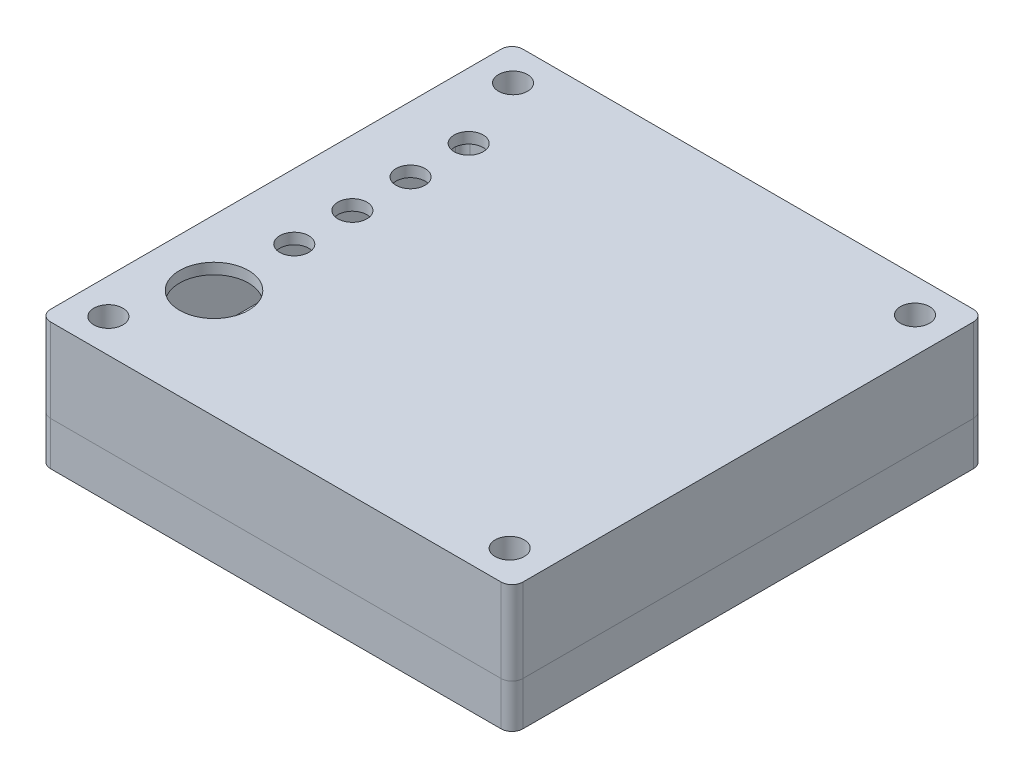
ISO-10303-21;
HEADER;
FILE_DESCRIPTION(('STEP AP214'),'2;1');
FILE_NAME('part.step','',(''),(''),'','','');
FILE_SCHEMA(('AUTOMOTIVE_DESIGN { 1 0 10303 214 1 1 1 1 }'));
ENDSEC;
DATA;
#1=APPLICATION_CONTEXT('core data for automotive mechanical design processes');
#2=APPLICATION_PROTOCOL_DEFINITION('international standard','automotive_design',2000,#1);
#3=PRODUCT_CONTEXT('',#1,'mechanical');
#4=PRODUCT('Part','Part','',(#3));
#5=PRODUCT_RELATED_PRODUCT_CATEGORY('part','',(#4));
#6=PRODUCT_DEFINITION_FORMATION('','',#4);
#7=PRODUCT_DEFINITION_CONTEXT('part definition',#1,'design');
#8=PRODUCT_DEFINITION('design','',#6,#7);
#9=PRODUCT_DEFINITION_SHAPE('','',#8);
#10=(LENGTH_UNIT() NAMED_UNIT(*) SI_UNIT(.MILLI.,.METRE.));
#11=(NAMED_UNIT(*) PLANE_ANGLE_UNIT() SI_UNIT($,.RADIAN.));
#12=(NAMED_UNIT(*) SI_UNIT($,.STERADIAN.) SOLID_ANGLE_UNIT());
#13=UNCERTAINTY_MEASURE_WITH_UNIT(LENGTH_MEASURE(1.E-05),#10,'distance_accuracy_value','');
#14=(GEOMETRIC_REPRESENTATION_CONTEXT(3) GLOBAL_UNCERTAINTY_ASSIGNED_CONTEXT((#13)) GLOBAL_UNIT_ASSIGNED_CONTEXT((#10,
#11,#12)) REPRESENTATION_CONTEXT('',''));
#15=CARTESIAN_POINT('',(0.,0.,0.));
#16=DIRECTION('',(0.,0.,1.));
#17=DIRECTION('',(1.,0.,0.));
#18=AXIS2_PLACEMENT_3D('',#15,#16,#17);
#19=CARTESIAN_POINT('',(3.00000000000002,-12.,127.));
#20=DIRECTION('',(0.,1.,0.));
#21=DIRECTION('',(0.,0.,1.));
#22=AXIS2_PLACEMENT_3D('',#19,#20,#21);
#23=CYLINDRICAL_SURFACE('',#22,3.);
#24=CARTESIAN_POINT('',(3.00000000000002,0.,127.));
#25=DIRECTION('',(0.,-1.,0.));
#26=DIRECTION('',(0.,0.,-1.));
#27=AXIS2_PLACEMENT_3D('',#24,#25,#26);
#28=CIRCLE('',#27,3.);
#29=CARTESIAN_POINT('',(3.00000000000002,0.,130.));
#30=VERTEX_POINT('',#29);
#31=CARTESIAN_POINT('',(0.,0.,127.));
#32=VERTEX_POINT('',#31);
#33=EDGE_CURVE('E143',#30,#32,#28,.T.);
#34=ORIENTED_EDGE('',*,*,#33,.T.);
#35=DIRECTION('',(0.,1.,0.));
#36=VECTOR('',#35,1.);
#37=CARTESIAN_POINT('',(0.,-12.,127.));
#38=LINE('',#37,#36);
#39=CARTESIAN_POINT('',(0.,-12.,127.));
#40=VERTEX_POINT('',#39);
#41=EDGE_CURVE('E12',#40,#32,#38,.T.);
#42=ORIENTED_EDGE('',*,*,#41,.F.);
#43=CARTESIAN_POINT('',(3.00000000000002,-12.,127.));
#44=DIRECTION('',(0.,-1.,0.));
#45=DIRECTION('',(0.,0.,-1.));
#46=AXIS2_PLACEMENT_3D('',#43,#44,#45);
#47=CIRCLE('',#46,3.);
#48=CARTESIAN_POINT('',(3.00000000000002,-12.,130.));
#49=VERTEX_POINT('',#48);
#50=EDGE_CURVE('E157',#49,#40,#47,.T.);
#51=ORIENTED_EDGE('',*,*,#50,.F.);
#52=DIRECTION('',(0.,1.,0.));
#53=VECTOR('',#52,1.);
#54=CARTESIAN_POINT('',(3.00000000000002,-12.,130.));
#55=LINE('',#54,#53);
#56=EDGE_CURVE('E139',#49,#30,#55,.T.);
#57=ORIENTED_EDGE('',*,*,#56,.T.);
#58=EDGE_LOOP('',(#34,#42,#51,#57));
#59=FACE_BOUND('',#58,.T.);
#60=ADVANCED_FACE('F47',(#59),#23,.T.);
#61=CARTESIAN_POINT('',(0.,-12.,127.));
#62=DIRECTION('',(1.,0.,0.));
#63=DIRECTION('',(0.,0.,-1.));
#64=AXIS2_PLACEMENT_3D('',#61,#62,#63);
#65=PLANE('',#64);
#66=DIRECTION('',(0.,0.,-1.));
#67=VECTOR('',#66,1.);
#68=CARTESIAN_POINT('',(0.,0.,127.));
#69=LINE('',#68,#67);
#70=CARTESIAN_POINT('',(0.,0.,3.));
#71=VERTEX_POINT('',#70);
#72=EDGE_CURVE('E146',#32,#71,#69,.T.);
#73=ORIENTED_EDGE('',*,*,#72,.T.);
#74=DIRECTION('',(0.,1.,0.));
#75=VECTOR('',#74,1.);
#76=CARTESIAN_POINT('',(0.,-12.,3.));
#77=LINE('',#76,#75);
#78=CARTESIAN_POINT('',(0.,-12.,3.));
#79=VERTEX_POINT('',#78);
#80=EDGE_CURVE('E55',#79,#71,#77,.T.);
#81=ORIENTED_EDGE('',*,*,#80,.F.);
#82=DIRECTION('',(0.,0.,-1.));
#83=VECTOR('',#82,1.);
#84=CARTESIAN_POINT('',(0.,-12.,127.));
#85=LINE('',#84,#83);
#86=EDGE_CURVE('E106',#40,#79,#85,.T.);
#87=ORIENTED_EDGE('',*,*,#86,.F.);
#88=ORIENTED_EDGE('',*,*,#41,.T.);
#89=EDGE_LOOP('',(#73,#81,#87,#88));
#90=FACE_BOUND('',#89,.T.);
#91=ADVANCED_FACE('F192',(#90),#65,.F.);
#92=CARTESIAN_POINT('',(3.,-12.,3.));
#93=DIRECTION('',(0.,1.,0.));
#94=DIRECTION('',(0.,0.,1.));
#95=AXIS2_PLACEMENT_3D('',#92,#93,#94);
#96=CYLINDRICAL_SURFACE('',#95,3.);
#97=CARTESIAN_POINT('',(3.,0.,3.));
#98=DIRECTION('',(0.,-1.,0.));
#99=DIRECTION('',(0.,0.,-1.));
#100=AXIS2_PLACEMENT_3D('',#97,#98,#99);
#101=CIRCLE('',#100,3.);
#102=CARTESIAN_POINT('',(3.,0.,0.));
#103=VERTEX_POINT('',#102);
#104=EDGE_CURVE('E148',#71,#103,#101,.T.);
#105=ORIENTED_EDGE('',*,*,#104,.T.);
#106=DIRECTION('',(0.,1.,0.));
#107=VECTOR('',#106,1.);
#108=CARTESIAN_POINT('',(3.,-12.,0.));
#109=LINE('',#108,#107);
#110=CARTESIAN_POINT('',(3.,-12.,0.));
#111=VERTEX_POINT('',#110);
#112=EDGE_CURVE('E164',#111,#103,#109,.T.);
#113=ORIENTED_EDGE('',*,*,#112,.F.);
#114=CARTESIAN_POINT('',(3.,-12.,3.));
#115=DIRECTION('',(0.,-1.,0.));
#116=DIRECTION('',(0.,0.,-1.));
#117=AXIS2_PLACEMENT_3D('',#114,#115,#116);
#118=CIRCLE('',#117,3.);
#119=EDGE_CURVE('E172',#79,#111,#118,.T.);
#120=ORIENTED_EDGE('',*,*,#119,.F.);
#121=ORIENTED_EDGE('',*,*,#80,.T.);
#122=EDGE_LOOP('',(#105,#113,#120,#121));
#123=FACE_BOUND('',#122,.T.);
#124=ADVANCED_FACE('F170',(#123),#96,.T.);
#125=CARTESIAN_POINT('',(3.,-12.,0.));
#126=DIRECTION('',(0.,0.,1.));
#127=DIRECTION('',(1.,0.,0.));
#128=AXIS2_PLACEMENT_3D('',#125,#126,#127);
#129=PLANE('',#128);
#130=DIRECTION('',(1.,0.,0.));
#131=VECTOR('',#130,1.);
#132=CARTESIAN_POINT('',(3.,0.,0.));
#133=LINE('',#132,#131);
#134=CARTESIAN_POINT('',(127.,0.,0.));
#135=VERTEX_POINT('',#134);
#136=EDGE_CURVE('E150',#103,#135,#133,.T.);
#137=ORIENTED_EDGE('',*,*,#136,.T.);
#138=DIRECTION('',(0.,1.,0.));
#139=VECTOR('',#138,1.);
#140=CARTESIAN_POINT('',(127.,-12.,0.));
#141=LINE('',#140,#139);
#142=CARTESIAN_POINT('',(127.,-12.,0.));
#143=VERTEX_POINT('',#142);
#144=EDGE_CURVE('E161',#143,#135,#141,.T.);
#145=ORIENTED_EDGE('',*,*,#144,.F.);
#146=DIRECTION('',(1.,0.,0.));
#147=VECTOR('',#146,1.);
#148=CARTESIAN_POINT('',(3.,-12.,0.));
#149=LINE('',#148,#147);
#150=EDGE_CURVE('E184',#111,#143,#149,.T.);
#151=ORIENTED_EDGE('',*,*,#150,.F.);
#152=ORIENTED_EDGE('',*,*,#112,.T.);
#153=EDGE_LOOP('',(#137,#145,#151,#152));
#154=FACE_BOUND('',#153,.T.);
#155=ADVANCED_FACE('F180',(#154),#129,.F.);
#156=CARTESIAN_POINT('',(127.,-12.,3.));
#157=DIRECTION('',(0.,1.,0.));
#158=DIRECTION('',(0.,0.,1.));
#159=AXIS2_PLACEMENT_3D('',#156,#157,#158);
#160=CYLINDRICAL_SURFACE('',#159,3.);
#161=CARTESIAN_POINT('',(127.,0.,3.));
#162=DIRECTION('',(0.,-1.,0.));
#163=DIRECTION('',(0.,0.,-1.));
#164=AXIS2_PLACEMENT_3D('',#161,#162,#163);
#165=CIRCLE('',#164,3.);
#166=CARTESIAN_POINT('',(130.,0.,3.));
#167=VERTEX_POINT('',#166);
#168=EDGE_CURVE('E152',#135,#167,#165,.T.);
#169=ORIENTED_EDGE('',*,*,#168,.T.);
#170=DIRECTION('',(0.,1.,0.));
#171=VECTOR('',#170,1.);
#172=CARTESIAN_POINT('',(130.,-12.,3.));
#173=LINE('',#172,#171);
#174=CARTESIAN_POINT('',(130.,-12.,3.));
#175=VERTEX_POINT('',#174);
#176=EDGE_CURVE('E134',#175,#167,#173,.T.);
#177=ORIENTED_EDGE('',*,*,#176,.F.);
#178=CARTESIAN_POINT('',(127.,-12.,3.));
#179=DIRECTION('',(0.,-1.,0.));
#180=DIRECTION('',(0.,0.,-1.));
#181=AXIS2_PLACEMENT_3D('',#178,#179,#180);
#182=CIRCLE('',#181,3.);
#183=EDGE_CURVE('E125',#143,#175,#182,.T.);
#184=ORIENTED_EDGE('',*,*,#183,.F.);
#185=ORIENTED_EDGE('',*,*,#144,.T.);
#186=EDGE_LOOP('',(#169,#177,#184,#185));
#187=FACE_BOUND('',#186,.T.);
#188=ADVANCED_FACE('F183',(#187),#160,.T.);
#189=CARTESIAN_POINT('',(130.,-12.,3.));
#190=DIRECTION('',(-1.,0.,0.));
#191=DIRECTION('',(0.,0.,1.));
#192=AXIS2_PLACEMENT_3D('',#189,#190,#191);
#193=PLANE('',#192);
#194=DIRECTION('',(0.,0.,1.));
#195=VECTOR('',#194,1.);
#196=CARTESIAN_POINT('',(130.,0.,3.));
#197=LINE('',#196,#195);
#198=CARTESIAN_POINT('',(130.,0.,127.));
#199=VERTEX_POINT('',#198);
#200=EDGE_CURVE('E133',#167,#199,#197,.T.);
#201=ORIENTED_EDGE('',*,*,#200,.T.);
#202=DIRECTION('',(0.,1.,0.));
#203=VECTOR('',#202,1.);
#204=CARTESIAN_POINT('',(130.,-12.,127.));
#205=LINE('',#204,#203);
#206=CARTESIAN_POINT('',(130.,-12.,127.));
#207=VERTEX_POINT('',#206);
#208=EDGE_CURVE('E130',#207,#199,#205,.T.);
#209=ORIENTED_EDGE('',*,*,#208,.F.);
#210=DIRECTION('',(0.,0.,1.));
#211=VECTOR('',#210,1.);
#212=CARTESIAN_POINT('',(130.,-12.,3.));
#213=LINE('',#212,#211);
#214=EDGE_CURVE('E119',#175,#207,#213,.T.);
#215=ORIENTED_EDGE('',*,*,#214,.F.);
#216=ORIENTED_EDGE('',*,*,#176,.T.);
#217=EDGE_LOOP('',(#201,#209,#215,#216));
#218=FACE_BOUND('',#217,.T.);
#219=ADVANCED_FACE('F131',(#218),#193,.F.);
#220=CARTESIAN_POINT('',(127.,-12.,127.));
#221=DIRECTION('',(0.,1.,0.));
#222=DIRECTION('',(0.,0.,1.));
#223=AXIS2_PLACEMENT_3D('',#220,#221,#222);
#224=CYLINDRICAL_SURFACE('',#223,3.);
#225=CARTESIAN_POINT('',(127.,0.,127.));
#226=DIRECTION('',(0.,-1.,0.));
#227=DIRECTION('',(0.,0.,-1.));
#228=AXIS2_PLACEMENT_3D('',#225,#226,#227);
#229=CIRCLE('',#228,3.);
#230=CARTESIAN_POINT('',(127.,0.,130.));
#231=VERTEX_POINT('',#230);
#232=EDGE_CURVE('E92',#199,#231,#229,.T.);
#233=ORIENTED_EDGE('',*,*,#232,.T.);
#234=DIRECTION('',(0.,1.,0.));
#235=VECTOR('',#234,1.);
#236=CARTESIAN_POINT('',(127.,-12.,130.));
#237=LINE('',#236,#235);
#238=CARTESIAN_POINT('',(127.,-12.,130.));
#239=VERTEX_POINT('',#238);
#240=EDGE_CURVE('E135',#239,#231,#237,.T.);
#241=ORIENTED_EDGE('',*,*,#240,.F.);
#242=CARTESIAN_POINT('',(127.,-12.,127.));
#243=DIRECTION('',(0.,-1.,0.));
#244=DIRECTION('',(0.,0.,-1.));
#245=AXIS2_PLACEMENT_3D('',#242,#243,#244);
#246=CIRCLE('',#245,3.);
#247=EDGE_CURVE('E123',#207,#239,#246,.T.);
#248=ORIENTED_EDGE('',*,*,#247,.F.);
#249=ORIENTED_EDGE('',*,*,#208,.T.);
#250=EDGE_LOOP('',(#233,#241,#248,#249));
#251=FACE_BOUND('',#250,.T.);
#252=ADVANCED_FACE('F137',(#251),#224,.T.);
#253=CARTESIAN_POINT('',(127.,-12.,130.));
#254=DIRECTION('',(0.,0.,-1.));
#255=DIRECTION('',(-1.,0.,0.));
#256=AXIS2_PLACEMENT_3D('',#253,#254,#255);
#257=PLANE('',#256);
#258=DIRECTION('',(-1.,0.,0.));
#259=VECTOR('',#258,1.);
#260=CARTESIAN_POINT('',(127.,0.,130.));
#261=LINE('',#260,#259);
#262=EDGE_CURVE('E98',#231,#30,#261,.T.);
#263=ORIENTED_EDGE('',*,*,#262,.T.);
#264=ORIENTED_EDGE('',*,*,#56,.F.);
#265=DIRECTION('',(-1.,0.,0.));
#266=VECTOR('',#265,1.);
#267=CARTESIAN_POINT('',(127.,-12.,130.));
#268=LINE('',#267,#266);
#269=EDGE_CURVE('E63',#239,#49,#268,.T.);
#270=ORIENTED_EDGE('',*,*,#269,.F.);
#271=ORIENTED_EDGE('',*,*,#240,.T.);
#272=EDGE_LOOP('',(#263,#264,#270,#271));
#273=FACE_BOUND('',#272,.T.);
#274=ADVANCED_FACE('F208',(#273),#257,.F.);
#275=CARTESIAN_POINT('',(3.00000000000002,-12.,127.));
#276=DIRECTION('',(0.,-1.,0.));
#277=DIRECTION('',(0.,0.,-1.));
#278=AXIS2_PLACEMENT_3D('',#275,#276,#277);
#279=PLANE('',#278);
#280=ORIENTED_EDGE('',*,*,#50,.T.);
#281=ORIENTED_EDGE('',*,*,#86,.T.);
#282=ORIENTED_EDGE('',*,*,#119,.T.);
#283=ORIENTED_EDGE('',*,*,#150,.T.);
#284=ORIENTED_EDGE('',*,*,#183,.T.);
#285=ORIENTED_EDGE('',*,*,#214,.T.);
#286=ORIENTED_EDGE('',*,*,#247,.T.);
#287=ORIENTED_EDGE('',*,*,#269,.T.);
#288=EDGE_LOOP('',(#280,#281,#282,#283,#284,#285,#286,#287));
#289=FACE_BOUND('',#288,.T.);
#290=ADVANCED_FACE('F121',(#289),#279,.T.);
#291=CARTESIAN_POINT('',(3.00000000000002,0.,127.));
#292=DIRECTION('',(0.,-1.,0.));
#293=DIRECTION('',(0.,0.,-1.));
#294=AXIS2_PLACEMENT_3D('',#291,#292,#293);
#295=PLANE('',#294);
#296=ORIENTED_EDGE('',*,*,#33,.F.);
#297=ORIENTED_EDGE('',*,*,#262,.F.);
#298=ORIENTED_EDGE('',*,*,#232,.F.);
#299=ORIENTED_EDGE('',*,*,#200,.F.);
#300=ORIENTED_EDGE('',*,*,#168,.F.);
#301=ORIENTED_EDGE('',*,*,#136,.F.);
#302=ORIENTED_EDGE('',*,*,#104,.F.);
#303=ORIENTED_EDGE('',*,*,#72,.F.);
#304=EDGE_LOOP('',(#296,#297,#298,#299,#300,#301,#302,#303));
#305=FACE_BOUND('',#304,.T.);
#306=ADVANCED_FACE('F176',(#305),#295,.F.);
#307=CLOSED_SHELL('',(#60,#91,#124,#155,#188,#219,#252,#274,#290,#306));
#308=MANIFOLD_SOLID_BREP('B2',#307);
#309=CARTESIAN_POINT('',(23.500000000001,21.5,20.9999999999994));
#310=DIRECTION('',(0.,-1.,0.));
#311=DIRECTION('',(0.,0.,-1.));
#312=AXIS2_PLACEMENT_3D('',#309,#310,#311);
#313=PLANE('',#312);
#314=CARTESIAN_POINT('',(23.500000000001,21.5,20.9999999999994));
#315=DIRECTION('',(0.,-1.,0.));
#316=DIRECTION('',(0.,0.,-1.));
#317=AXIS2_PLACEMENT_3D('',#314,#315,#316);
#318=CIRCLE('',#317,5.);
#319=CARTESIAN_POINT('',(23.500000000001,21.5,15.9999999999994));
#320=VERTEX_POINT('',#319);
#321=EDGE_CURVE('E652',#320,#320,#318,.T.);
#322=ORIENTED_EDGE('',*,*,#321,.T.);
#323=EDGE_LOOP('',(#322));
#324=FACE_BOUND('',#323,.T.);
#325=CARTESIAN_POINT('',(23.500000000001,21.5,20.9999999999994));
#326=DIRECTION('',(0.,-1.,0.));
#327=DIRECTION('',(0.,0.,-1.));
#328=AXIS2_PLACEMENT_3D('',#325,#326,#327);
#329=CIRCLE('',#328,3.00000000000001);
#330=CARTESIAN_POINT('',(23.500000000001,21.5,23.9999999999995));
#331=VERTEX_POINT('',#330);
#332=EDGE_CURVE('E632',#331,#331,#329,.T.);
#333=ORIENTED_EDGE('',*,*,#332,.F.);
#334=EDGE_LOOP('',(#333));
#335=FACE_BOUND('',#334,.T.);
#336=ADVANCED_FACE('F275',(#324,#335),#313,.T.);
#337=CARTESIAN_POINT('',(63.500000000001,21.5,20.9999999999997));
#338=DIRECTION('',(0.,-1.,0.));
#339=DIRECTION('',(0.,0.,-1.));
#340=AXIS2_PLACEMENT_3D('',#337,#338,#339);
#341=PLANE('',#340);
#342=CARTESIAN_POINT('',(63.500000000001,21.5,20.9999999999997));
#343=DIRECTION('',(0.,-1.,0.));
#344=DIRECTION('',(0.,0.,-1.));
#345=AXIS2_PLACEMENT_3D('',#342,#343,#344);
#346=CIRCLE('',#345,5.);
#347=CARTESIAN_POINT('',(63.500000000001,21.5,15.9999999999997));
#348=VERTEX_POINT('',#347);
#349=EDGE_CURVE('E658',#348,#348,#346,.T.);
#350=ORIENTED_EDGE('',*,*,#349,.T.);
#351=EDGE_LOOP('',(#350));
#352=FACE_BOUND('',#351,.T.);
#353=CARTESIAN_POINT('',(63.500000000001,21.5,20.9999999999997));
#354=DIRECTION('',(0.,-1.,0.));
#355=DIRECTION('',(0.,0.,-1.));
#356=AXIS2_PLACEMENT_3D('',#353,#354,#355);
#357=CIRCLE('',#356,3.00000000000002);
#358=CARTESIAN_POINT('',(63.500000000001,21.5,23.9999999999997));
#359=VERTEX_POINT('',#358);
#360=EDGE_CURVE('E635',#359,#359,#357,.T.);
#361=ORIENTED_EDGE('',*,*,#360,.F.);
#362=EDGE_LOOP('',(#361));
#363=FACE_BOUND('',#362,.T.);
#364=ADVANCED_FACE('F1037',(#352,#363),#341,.T.);
#365=CARTESIAN_POINT('',(103.500000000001,21.5,21.));
#366=DIRECTION('',(0.,-1.,0.));
#367=DIRECTION('',(0.,0.,-1.));
#368=AXIS2_PLACEMENT_3D('',#365,#366,#367);
#369=PLANE('',#368);
#370=CARTESIAN_POINT('',(103.500000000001,21.5,21.));
#371=DIRECTION('',(0.,-1.,0.));
#372=DIRECTION('',(0.,0.,-1.));
#373=AXIS2_PLACEMENT_3D('',#370,#371,#372);
#374=CIRCLE('',#373,5.);
#375=CARTESIAN_POINT('',(103.500000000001,21.5,16.));
#376=VERTEX_POINT('',#375);
#377=EDGE_CURVE('E664',#376,#376,#374,.T.);
#378=ORIENTED_EDGE('',*,*,#377,.T.);
#379=EDGE_LOOP('',(#378));
#380=FACE_BOUND('',#379,.T.);
#381=CARTESIAN_POINT('',(103.500000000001,21.5,21.));
#382=DIRECTION('',(0.,-1.,0.));
#383=DIRECTION('',(0.,0.,-1.));
#384=AXIS2_PLACEMENT_3D('',#381,#382,#383);
#385=CIRCLE('',#384,3.00000000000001);
#386=CARTESIAN_POINT('',(103.500000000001,21.5,24.));
#387=VERTEX_POINT('',#386);
#388=EDGE_CURVE('E638',#387,#387,#385,.T.);
#389=ORIENTED_EDGE('',*,*,#388,.F.);
#390=EDGE_LOOP('',(#389));
#391=FACE_BOUND('',#390,.T.);
#392=ADVANCED_FACE('F1043',(#380,#391),#369,.T.);
#393=CARTESIAN_POINT('',(103.500000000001,21.5,66.));
#394=DIRECTION('',(0.,-1.,0.));
#395=DIRECTION('',(0.,0.,-1.));
#396=AXIS2_PLACEMENT_3D('',#393,#394,#395);
#397=PLANE('',#396);
#398=CARTESIAN_POINT('',(103.500000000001,21.5,66.));
#399=DIRECTION('',(0.,-1.,0.));
#400=DIRECTION('',(0.,0.,-1.));
#401=AXIS2_PLACEMENT_3D('',#398,#399,#400);
#402=CIRCLE('',#401,5.00000000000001);
#403=CARTESIAN_POINT('',(103.500000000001,21.5,61.));
#404=VERTEX_POINT('',#403);
#405=EDGE_CURVE('E670',#404,#404,#402,.T.);
#406=ORIENTED_EDGE('',*,*,#405,.T.);
#407=EDGE_LOOP('',(#406));
#408=FACE_BOUND('',#407,.T.);
#409=CARTESIAN_POINT('',(103.500000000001,21.5,66.));
#410=DIRECTION('',(0.,-1.,0.));
#411=DIRECTION('',(0.,0.,-1.));
#412=AXIS2_PLACEMENT_3D('',#409,#410,#411);
#413=CIRCLE('',#412,3.00000000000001);
#414=CARTESIAN_POINT('',(103.500000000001,21.5,69.));
#415=VERTEX_POINT('',#414);
#416=EDGE_CURVE('E641',#415,#415,#413,.T.);
#417=ORIENTED_EDGE('',*,*,#416,.F.);
#418=EDGE_LOOP('',(#417));
#419=FACE_BOUND('',#418,.T.);
#420=ADVANCED_FACE('F1062',(#408,#419),#397,.T.);
#421=CARTESIAN_POINT('',(23.5,21.5,110.999999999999));
#422=DIRECTION('',(0.,-1.,0.));
#423=DIRECTION('',(0.,0.,-1.));
#424=AXIS2_PLACEMENT_3D('',#421,#422,#423);
#425=PLANE('',#424);
#426=CARTESIAN_POINT('',(18.,21.5,100.));
#427=DIRECTION('',(0.,-1.,0.));
#428=DIRECTION('',(0.,0.,-1.));
#429=AXIS2_PLACEMENT_3D('',#426,#427,#428);
#430=CIRCLE('',#429,9.5);
#431=CARTESIAN_POINT('',(25.1332629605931,21.5,106.274277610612));
#432=VERTEX_POINT('',#431);
#433=CARTESIAN_POINT('',(23.0761903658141,21.5,108.030086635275));
#434=VERTEX_POINT('',#433);
#435=EDGE_CURVE('E1932',#432,#434,#430,.T.);
#436=ORIENTED_EDGE('',*,*,#435,.F.);
#437=CARTESIAN_POINT('',(23.5,21.5,110.999999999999));
#438=DIRECTION('',(0.,-1.,0.));
#439=DIRECTION('',(0.,0.,-1.));
#440=AXIS2_PLACEMENT_3D('',#437,#438,#439);
#441=CIRCLE('',#440,5.);
#442=CARTESIAN_POINT('',(18.7394643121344,21.5,109.471176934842));
#443=VERTEX_POINT('',#442);
#444=EDGE_CURVE('E676',#432,#443,#441,.T.);
#445=ORIENTED_EDGE('',*,*,#444,.T.);
#446=CARTESIAN_POINT('',(21.3783550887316,21.5,108.879004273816));
#447=VERTEX_POINT('',#446);
#448=EDGE_CURVE('E522',#447,#443,#430,.T.);
#449=ORIENTED_EDGE('',*,*,#448,.F.);
#450=CARTESIAN_POINT('',(23.5,21.5,110.999999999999));
#451=DIRECTION('',(0.,-1.,0.));
#452=DIRECTION('',(0.,0.,-1.));
#453=AXIS2_PLACEMENT_3D('',#450,#451,#452);
#454=CIRCLE('',#453,3.00000000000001);
#455=EDGE_CURVE('E521',#434,#447,#454,.T.);
#456=ORIENTED_EDGE('',*,*,#455,.F.);
#457=EDGE_LOOP('',(#436,#445,#449,#456));
#458=FACE_BOUND('',#457,.T.);
#459=ADVANCED_FACE('F1070',(#458),#425,.T.);
#460=CARTESIAN_POINT('',(63.5,21.5,111.));
#461=DIRECTION('',(0.,-1.,0.));
#462=DIRECTION('',(0.,0.,-1.));
#463=AXIS2_PLACEMENT_3D('',#460,#461,#462);
#464=PLANE('',#463);
#465=CARTESIAN_POINT('',(63.5,21.5,111.));
#466=DIRECTION('',(0.,-1.,0.));
#467=DIRECTION('',(0.,0.,-1.));
#468=AXIS2_PLACEMENT_3D('',#465,#466,#467);
#469=CIRCLE('',#468,5.00000000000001);
#470=CARTESIAN_POINT('',(63.5,21.5,106.));
#471=VERTEX_POINT('',#470);
#472=EDGE_CURVE('E682',#471,#471,#469,.T.);
#473=ORIENTED_EDGE('',*,*,#472,.T.);
#474=EDGE_LOOP('',(#473));
#475=FACE_BOUND('',#474,.T.);
#476=CARTESIAN_POINT('',(63.5,21.5,111.));
#477=DIRECTION('',(0.,-1.,0.));
#478=DIRECTION('',(0.,0.,-1.));
#479=AXIS2_PLACEMENT_3D('',#476,#477,#478);
#480=CIRCLE('',#479,3.00000000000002);
#481=CARTESIAN_POINT('',(63.5,21.5,114.));
#482=VERTEX_POINT('',#481);
#483=EDGE_CURVE('E645',#482,#482,#480,.T.);
#484=ORIENTED_EDGE('',*,*,#483,.F.);
#485=EDGE_LOOP('',(#484));
#486=FACE_BOUND('',#485,.T.);
#487=ADVANCED_FACE('F1078',(#475,#486),#464,.T.);
#488=CARTESIAN_POINT('',(103.5,21.5,111.));
#489=DIRECTION('',(0.,-1.,0.));
#490=DIRECTION('',(0.,0.,-1.));
#491=AXIS2_PLACEMENT_3D('',#488,#489,#490);
#492=PLANE('',#491);
#493=CARTESIAN_POINT('',(103.5,21.5,111.));
#494=DIRECTION('',(0.,-1.,0.));
#495=DIRECTION('',(0.,0.,-1.));
#496=AXIS2_PLACEMENT_3D('',#493,#494,#495);
#497=CIRCLE('',#496,5.00000000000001);
#498=CARTESIAN_POINT('',(103.5,21.5,106.));
#499=VERTEX_POINT('',#498);
#500=EDGE_CURVE('E688',#499,#499,#497,.T.);
#501=ORIENTED_EDGE('',*,*,#500,.T.);
#502=EDGE_LOOP('',(#501));
#503=FACE_BOUND('',#502,.T.);
#504=CARTESIAN_POINT('',(103.5,21.5,111.));
#505=DIRECTION('',(0.,-1.,0.));
#506=DIRECTION('',(0.,0.,-1.));
#507=AXIS2_PLACEMENT_3D('',#504,#505,#506);
#508=CIRCLE('',#507,3.00000000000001);
#509=CARTESIAN_POINT('',(103.5,21.5,114.));
#510=VERTEX_POINT('',#509);
#511=EDGE_CURVE('E648',#510,#510,#508,.T.);
#512=ORIENTED_EDGE('',*,*,#511,.F.);
#513=EDGE_LOOP('',(#512));
#514=FACE_BOUND('',#513,.T.);
#515=ADVANCED_FACE('F1086',(#503,#514),#492,.T.);
#516=CARTESIAN_POINT('',(0.,23.,0.));
#517=DIRECTION('',(1.,0.,0.));
#518=DIRECTION('',(0.,0.,-1.));
#519=AXIS2_PLACEMENT_3D('',#516,#517,#518);
#520=PLANE('',#519);
#521=DIRECTION('',(0.,0.,1.));
#522=VECTOR('',#521,1.);
#523=CARTESIAN_POINT('',(0.,23.,0.));
#524=LINE('',#523,#522);
#525=CARTESIAN_POINT('',(0.,23.,3.));
#526=VERTEX_POINT('',#525);
#527=CARTESIAN_POINT('',(0.,23.,127.));
#528=VERTEX_POINT('',#527);
#529=EDGE_CURVE('E932',#526,#528,#524,.T.);
#530=ORIENTED_EDGE('',*,*,#529,.F.);
#531=DIRECTION('',(0.,-1.,0.));
#532=VECTOR('',#531,1.);
#533=CARTESIAN_POINT('',(0.,23.,3.));
#534=LINE('',#533,#532);
#535=CARTESIAN_POINT('',(0.,0.,3.));
#536=VERTEX_POINT('',#535);
#537=EDGE_CURVE('E957',#526,#536,#534,.T.);
#538=ORIENTED_EDGE('',*,*,#537,.T.);
#539=DIRECTION('',(0.,0.,1.));
#540=VECTOR('',#539,1.);
#541=CARTESIAN_POINT('',(0.,0.,0.));
#542=LINE('',#541,#540);
#543=CARTESIAN_POINT('',(0.,0.,127.));
#544=VERTEX_POINT('',#543);
#545=EDGE_CURVE('E886',#536,#544,#542,.T.);
#546=ORIENTED_EDGE('',*,*,#545,.T.);
#547=DIRECTION('',(0.,-1.,0.));
#548=VECTOR('',#547,1.);
#549=CARTESIAN_POINT('',(0.,23.,127.));
#550=LINE('',#549,#548);
#551=EDGE_CURVE('E945',#544,#528,#550,.F.);
#552=ORIENTED_EDGE('',*,*,#551,.T.);
#553=EDGE_LOOP('',(#530,#538,#546,#552));
#554=FACE_BOUND('',#553,.T.);
#555=ADVANCED_FACE('F1015',(#554),#520,.F.);
#556=CARTESIAN_POINT('',(0.,23.,130.));
#557=DIRECTION('',(0.,0.,-1.));
#558=DIRECTION('',(-1.,0.,0.));
#559=AXIS2_PLACEMENT_3D('',#556,#557,#558);
#560=PLANE('',#559);
#561=DIRECTION('',(1.,0.,0.));
#562=VECTOR('',#561,1.);
#563=CARTESIAN_POINT('',(0.,23.,130.));
#564=LINE('',#563,#562);
#565=CARTESIAN_POINT('',(3.00000000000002,23.,130.));
#566=VERTEX_POINT('',#565);
#567=CARTESIAN_POINT('',(127.,23.,130.));
#568=VERTEX_POINT('',#567);
#569=EDGE_CURVE('E935',#566,#568,#564,.T.);
#570=ORIENTED_EDGE('',*,*,#569,.F.);
#571=DIRECTION('',(0.,-1.,0.));
#572=VECTOR('',#571,1.);
#573=CARTESIAN_POINT('',(3.00000000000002,23.,130.));
#574=LINE('',#573,#572);
#575=CARTESIAN_POINT('',(3.00000000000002,0.,130.));
#576=VERTEX_POINT('',#575);
#577=EDGE_CURVE('E983',#566,#576,#574,.T.);
#578=ORIENTED_EDGE('',*,*,#577,.T.);
#579=DIRECTION('',(1.,0.,0.));
#580=VECTOR('',#579,1.);
#581=CARTESIAN_POINT('',(0.,0.,130.));
#582=LINE('',#581,#580);
#583=CARTESIAN_POINT('',(127.,0.,130.));
#584=VERTEX_POINT('',#583);
#585=EDGE_CURVE('E948',#576,#584,#582,.T.);
#586=ORIENTED_EDGE('',*,*,#585,.T.);
#587=DIRECTION('',(0.,-1.,0.));
#588=VECTOR('',#587,1.);
#589=CARTESIAN_POINT('',(127.,23.,130.));
#590=LINE('',#589,#588);
#591=EDGE_CURVE('E981',#584,#568,#590,.F.);
#592=ORIENTED_EDGE('',*,*,#591,.T.);
#593=EDGE_LOOP('',(#570,#578,#586,#592));
#594=FACE_BOUND('',#593,.T.);
#595=ADVANCED_FACE('F1023',(#594),#560,.F.);
#596=CARTESIAN_POINT('',(130.,23.,0.));
#597=DIRECTION('',(-1.,0.,0.));
#598=DIRECTION('',(0.,0.,1.));
#599=AXIS2_PLACEMENT_3D('',#596,#597,#598);
#600=PLANE('',#599);
#601=DIRECTION('',(0.,0.,-1.));
#602=VECTOR('',#601,1.);
#603=CARTESIAN_POINT('',(130.,0.,0.));
#604=LINE('',#603,#602);
#605=CARTESIAN_POINT('',(130.,0.,127.));
#606=VERTEX_POINT('',#605);
#607=CARTESIAN_POINT('',(130.,0.,3.));
#608=VERTEX_POINT('',#607);
#609=EDGE_CURVE('E951',#606,#608,#604,.T.);
#610=ORIENTED_EDGE('',*,*,#609,.T.);
#611=DIRECTION('',(0.,-1.,0.));
#612=VECTOR('',#611,1.);
#613=CARTESIAN_POINT('',(130.,23.,3.));
#614=LINE('',#613,#612);
#615=CARTESIAN_POINT('',(130.,23.,3.));
#616=VERTEX_POINT('',#615);
#617=EDGE_CURVE('E527',#608,#616,#614,.F.);
#618=ORIENTED_EDGE('',*,*,#617,.T.);
#619=DIRECTION('',(0.,0.,-1.));
#620=VECTOR('',#619,1.);
#621=CARTESIAN_POINT('',(130.,23.,0.));
#622=LINE('',#621,#620);
#623=CARTESIAN_POINT('',(130.,23.,127.));
#624=VERTEX_POINT('',#623);
#625=EDGE_CURVE('E939',#624,#616,#622,.T.);
#626=ORIENTED_EDGE('',*,*,#625,.F.);
#627=DIRECTION('',(0.,-1.,0.));
#628=VECTOR('',#627,1.);
#629=CARTESIAN_POINT('',(130.,23.,127.));
#630=LINE('',#629,#628);
#631=EDGE_CURVE('E532',#624,#606,#630,.T.);
#632=ORIENTED_EDGE('',*,*,#631,.T.);
#633=EDGE_LOOP('',(#610,#618,#626,#632));
#634=FACE_BOUND('',#633,.T.);
#635=ADVANCED_FACE('F990',(#634),#600,.F.);
#636=CARTESIAN_POINT('',(0.,23.,0.));
#637=DIRECTION('',(0.,0.,1.));
#638=DIRECTION('',(1.,0.,0.));
#639=AXIS2_PLACEMENT_3D('',#636,#637,#638);
#640=PLANE('',#639);
#641=CARTESIAN_POINT('',(103.5,8.,0.));
#642=DIRECTION('',(0.,0.,-1.));
#643=DIRECTION('',(-1.,0.,0.));
#644=AXIS2_PLACEMENT_3D('',#641,#642,#643);
#645=CIRCLE('',#644,4.00000000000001);
#646=CARTESIAN_POINT('',(99.5,8.,0.));
#647=VERTEX_POINT('',#646);
#648=EDGE_CURVE('E597',#647,#647,#645,.T.);
#649=ORIENTED_EDGE('',*,*,#648,.F.);
#650=EDGE_LOOP('',(#649));
#651=FACE_BOUND('',#650,.T.);
#652=CARTESIAN_POINT('',(26.5,11.,0.));
#653=DIRECTION('',(0.,0.,-1.));
#654=DIRECTION('',(-1.,0.,0.));
#655=AXIS2_PLACEMENT_3D('',#652,#653,#654);
#656=CIRCLE('',#655,6.5);
#657=CARTESIAN_POINT('',(20.,11.,0.));
#658=VERTEX_POINT('',#657);
#659=EDGE_CURVE('E594',#658,#658,#656,.T.);
#660=ORIENTED_EDGE('',*,*,#659,.F.);
#661=EDGE_LOOP('',(#660));
#662=FACE_BOUND('',#661,.T.);
#663=DIRECTION('',(-1.,0.,0.));
#664=VECTOR('',#663,1.);
#665=CARTESIAN_POINT('',(0.,0.,0.));
#666=LINE('',#665,#664);
#667=CARTESIAN_POINT('',(127.,0.,0.));
#668=VERTEX_POINT('',#667);
#669=CARTESIAN_POINT('',(3.,0.,0.));
#670=VERTEX_POINT('',#669);
#671=EDGE_CURVE('E936',#668,#670,#666,.T.);
#672=ORIENTED_EDGE('',*,*,#671,.T.);
#673=DIRECTION('',(0.,-1.,0.));
#674=VECTOR('',#673,1.);
#675=CARTESIAN_POINT('',(3.,23.,0.));
#676=LINE('',#675,#674);
#677=CARTESIAN_POINT('',(3.,23.,0.));
#678=VERTEX_POINT('',#677);
#679=EDGE_CURVE('E971',#670,#678,#676,.F.);
#680=ORIENTED_EDGE('',*,*,#679,.T.);
#681=DIRECTION('',(-1.,0.,0.));
#682=VECTOR('',#681,1.);
#683=CARTESIAN_POINT('',(0.,23.,0.));
#684=LINE('',#683,#682);
#685=CARTESIAN_POINT('',(127.,23.,0.));
#686=VERTEX_POINT('',#685);
#687=EDGE_CURVE('E942',#686,#678,#684,.T.);
#688=ORIENTED_EDGE('',*,*,#687,.F.);
#689=DIRECTION('',(0.,-1.,0.));
#690=VECTOR('',#689,1.);
#691=CARTESIAN_POINT('',(127.,23.,0.));
#692=LINE('',#691,#690);
#693=EDGE_CURVE('E968',#686,#668,#692,.T.);
#694=ORIENTED_EDGE('',*,*,#693,.T.);
#695=EDGE_LOOP('',(#672,#680,#688,#694));
#696=FACE_BOUND('',#695,.T.);
#697=ADVANCED_FACE('F1005',(#651,#662,#696),#640,.F.);
#698=CARTESIAN_POINT('',(0.,23.,130.));
#699=DIRECTION('',(0.,1.,0.));
#700=DIRECTION('',(0.,0.,1.));
#701=AXIS2_PLACEMENT_3D('',#698,#699,#700);
#702=PLANE('',#701);
#703=CARTESIAN_POINT('',(18.,23.,100.));
#704=DIRECTION('',(0.,1.,0.));
#705=DIRECTION('',(0.,0.,1.));
#706=AXIS2_PLACEMENT_3D('',#703,#704,#705);
#707=CIRCLE('',#706,9.5);
#708=CARTESIAN_POINT('',(18.,23.,109.5));
#709=VERTEX_POINT('',#708);
#710=EDGE_CURVE('E1927',#709,#709,#707,.T.);
#711=ORIENTED_EDGE('',*,*,#710,.F.);
#712=EDGE_LOOP('',(#711));
#713=FACE_BOUND('',#712,.T.);
#714=CARTESIAN_POINT('',(18.,23.,77.9163301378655));
#715=DIRECTION('',(0.,1.,0.));
#716=DIRECTION('',(0.,0.,1.));
#717=AXIS2_PLACEMENT_3D('',#714,#715,#716);
#718=CIRCLE('',#717,4.);
#719=CARTESIAN_POINT('',(18.,23.,81.9163301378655));
#720=VERTEX_POINT('',#719);
#721=EDGE_CURVE('E691',#720,#720,#718,.T.);
#722=ORIENTED_EDGE('',*,*,#721,.F.);
#723=EDGE_LOOP('',(#722));
#724=FACE_BOUND('',#723,.T.);
#725=CARTESIAN_POINT('',(18.,23.,61.9163301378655));
#726=DIRECTION('',(0.,1.,0.));
#727=DIRECTION('',(0.,0.,1.));
#728=AXIS2_PLACEMENT_3D('',#725,#726,#727);
#729=CIRCLE('',#728,4.);
#730=CARTESIAN_POINT('',(18.,23.,65.9163301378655));
#731=VERTEX_POINT('',#730);
#732=EDGE_CURVE('E697',#731,#731,#729,.T.);
#733=ORIENTED_EDGE('',*,*,#732,.F.);
#734=EDGE_LOOP('',(#733));
#735=FACE_BOUND('',#734,.T.);
#736=CARTESIAN_POINT('',(18.,23.,45.9163301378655));
#737=DIRECTION('',(0.,1.,0.));
#738=DIRECTION('',(0.,0.,1.));
#739=AXIS2_PLACEMENT_3D('',#736,#737,#738);
#740=CIRCLE('',#739,4.);
#741=CARTESIAN_POINT('',(18.,23.,49.9163301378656));
#742=VERTEX_POINT('',#741);
#743=EDGE_CURVE('E703',#742,#742,#740,.T.);
#744=ORIENTED_EDGE('',*,*,#743,.F.);
#745=EDGE_LOOP('',(#744));
#746=FACE_BOUND('',#745,.T.);
#747=CARTESIAN_POINT('',(18.,23.,29.9163301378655));
#748=DIRECTION('',(0.,1.,0.));
#749=DIRECTION('',(0.,0.,1.));
#750=AXIS2_PLACEMENT_3D('',#747,#748,#749);
#751=CIRCLE('',#750,4.);
#752=CARTESIAN_POINT('',(18.,23.,33.9163301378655));
#753=VERTEX_POINT('',#752);
#754=EDGE_CURVE('E709',#753,#753,#751,.T.);
#755=ORIENTED_EDGE('',*,*,#754,.F.);
#756=EDGE_LOOP('',(#755));
#757=FACE_BOUND('',#756,.T.);
#758=CARTESIAN_POINT('',(9.69314222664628,23.,120.758700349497));
#759=DIRECTION('',(0.,-1.,0.));
#760=DIRECTION('',(0.,0.,-1.));
#761=AXIS2_PLACEMENT_3D('',#758,#759,#760);
#762=CIRCLE('',#761,4.);
#763=CARTESIAN_POINT('',(9.69314222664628,23.,116.758700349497));
#764=VERTEX_POINT('',#763);
#765=EDGE_CURVE('E718',#764,#764,#762,.T.);
#766=ORIENTED_EDGE('',*,*,#765,.T.);
#767=EDGE_LOOP('',(#766));
#768=FACE_BOUND('',#767,.T.);
#769=CARTESIAN_POINT('',(120.12018080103,23.,120.758700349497));
#770=DIRECTION('',(0.,-1.,0.));
#771=DIRECTION('',(0.,0.,-1.));
#772=AXIS2_PLACEMENT_3D('',#769,#770,#771);
#773=CIRCLE('',#772,4.00000000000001);
#774=CARTESIAN_POINT('',(120.12018080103,23.,116.758700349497));
#775=VERTEX_POINT('',#774);
#776=EDGE_CURVE('E724',#775,#775,#773,.T.);
#777=ORIENTED_EDGE('',*,*,#776,.T.);
#778=EDGE_LOOP('',(#777));
#779=FACE_BOUND('',#778,.T.);
#780=CARTESIAN_POINT('',(120.299802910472,23.,9.40471865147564));
#781=DIRECTION('',(0.,-1.,0.));
#782=DIRECTION('',(0.,0.,-1.));
#783=AXIS2_PLACEMENT_3D('',#780,#781,#782);
#784=CIRCLE('',#783,4.00000000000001);
#785=CARTESIAN_POINT('',(120.299802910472,23.,5.40471865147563));
#786=VERTEX_POINT('',#785);
#787=EDGE_CURVE('E730',#786,#786,#784,.T.);
#788=ORIENTED_EDGE('',*,*,#787,.T.);
#789=EDGE_LOOP('',(#788));
#790=FACE_BOUND('',#789,.T.);
#791=CARTESIAN_POINT('',(9.69314222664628,23.,9.41137362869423));
#792=DIRECTION('',(0.,-1.,0.));
#793=DIRECTION('',(0.,0.,-1.));
#794=AXIS2_PLACEMENT_3D('',#791,#792,#793);
#795=CIRCLE('',#794,4.);
#796=CARTESIAN_POINT('',(9.69314222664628,23.,5.41137362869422));
#797=VERTEX_POINT('',#796);
#798=EDGE_CURVE('E736',#797,#797,#795,.T.);
#799=ORIENTED_EDGE('',*,*,#798,.T.);
#800=EDGE_LOOP('',(#799));
#801=FACE_BOUND('',#800,.T.);
#802=ORIENTED_EDGE('',*,*,#687,.T.);
#803=CARTESIAN_POINT('',(3.,23.,3.));
#804=DIRECTION('',(0.,1.,0.));
#805=DIRECTION('',(0.,0.,1.));
#806=AXIS2_PLACEMENT_3D('',#803,#804,#805);
#807=CIRCLE('',#806,3.);
#808=EDGE_CURVE('E979',#678,#526,#807,.T.);
#809=ORIENTED_EDGE('',*,*,#808,.T.);
#810=ORIENTED_EDGE('',*,*,#529,.T.);
#811=CARTESIAN_POINT('',(3.00000000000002,23.,127.));
#812=DIRECTION('',(0.,1.,0.));
#813=DIRECTION('',(0.,0.,1.));
#814=AXIS2_PLACEMENT_3D('',#811,#812,#813);
#815=CIRCLE('',#814,3.);
#816=EDGE_CURVE('E977',#528,#566,#815,.T.);
#817=ORIENTED_EDGE('',*,*,#816,.T.);
#818=ORIENTED_EDGE('',*,*,#569,.T.);
#819=CARTESIAN_POINT('',(127.,23.,127.));
#820=DIRECTION('',(0.,1.,0.));
#821=DIRECTION('',(0.,0.,1.));
#822=AXIS2_PLACEMENT_3D('',#819,#820,#821);
#823=CIRCLE('',#822,3.);
#824=EDGE_CURVE('E973',#568,#624,#823,.T.);
#825=ORIENTED_EDGE('',*,*,#824,.T.);
#826=ORIENTED_EDGE('',*,*,#625,.T.);
#827=CARTESIAN_POINT('',(127.,23.,3.));
#828=DIRECTION('',(0.,1.,0.));
#829=DIRECTION('',(0.,0.,1.));
#830=AXIS2_PLACEMENT_3D('',#827,#828,#829);
#831=CIRCLE('',#830,3.);
#832=EDGE_CURVE('E975',#616,#686,#831,.T.);
#833=ORIENTED_EDGE('',*,*,#832,.T.);
#834=EDGE_LOOP('',(#802,#809,#810,#817,#818,#825,#826,#833));
#835=FACE_BOUND('',#834,.T.);
#836=ADVANCED_FACE('F1009',(#713,#724,#735,#746,#757,#768,#779,#790,#801,#835),#702,.T.);
#837=CARTESIAN_POINT('',(0.,0.,130.));
#838=DIRECTION('',(0.,1.,0.));
#839=DIRECTION('',(0.,0.,1.));
#840=AXIS2_PLACEMENT_3D('',#837,#838,#839);
#841=PLANE('',#840);
#842=CARTESIAN_POINT('',(9.69314222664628,0.,120.758700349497));
#843=DIRECTION('',(0.,-1.,0.));
#844=DIRECTION('',(0.,0.,-1.));
#845=AXIS2_PLACEMENT_3D('',#842,#843,#844);
#846=CIRCLE('',#845,4.);
#847=CARTESIAN_POINT('',(9.69314222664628,0.,116.758700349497));
#848=VERTEX_POINT('',#847);
#849=EDGE_CURVE('E715',#848,#848,#846,.T.);
#850=ORIENTED_EDGE('',*,*,#849,.F.);
#851=EDGE_LOOP('',(#850));
#852=FACE_BOUND('',#851,.T.);
#853=CARTESIAN_POINT('',(120.12018080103,0.,120.758700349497));
#854=DIRECTION('',(0.,-1.,0.));
#855=DIRECTION('',(0.,0.,-1.));
#856=AXIS2_PLACEMENT_3D('',#853,#854,#855);
#857=CIRCLE('',#856,4.00000000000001);
#858=CARTESIAN_POINT('',(120.12018080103,0.,116.758700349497));
#859=VERTEX_POINT('',#858);
#860=EDGE_CURVE('E721',#859,#859,#857,.T.);
#861=ORIENTED_EDGE('',*,*,#860,.F.);
#862=EDGE_LOOP('',(#861));
#863=FACE_BOUND('',#862,.T.);
#864=CARTESIAN_POINT('',(120.299802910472,0.,9.40471865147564));
#865=DIRECTION('',(0.,-1.,0.));
#866=DIRECTION('',(0.,0.,-1.));
#867=AXIS2_PLACEMENT_3D('',#864,#865,#866);
#868=CIRCLE('',#867,4.00000000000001);
#869=CARTESIAN_POINT('',(120.299802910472,0.,5.40471865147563));
#870=VERTEX_POINT('',#869);
#871=EDGE_CURVE('E727',#870,#870,#868,.T.);
#872=ORIENTED_EDGE('',*,*,#871,.F.);
#873=EDGE_LOOP('',(#872));
#874=FACE_BOUND('',#873,.T.);
#875=CARTESIAN_POINT('',(9.69314222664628,0.,9.41137362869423));
#876=DIRECTION('',(0.,-1.,0.));
#877=DIRECTION('',(0.,0.,-1.));
#878=AXIS2_PLACEMENT_3D('',#875,#876,#877);
#879=CIRCLE('',#878,4.);
#880=CARTESIAN_POINT('',(9.69314222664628,0.,5.41137362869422));
#881=VERTEX_POINT('',#880);
#882=EDGE_CURVE('E733',#881,#881,#879,.T.);
#883=ORIENTED_EDGE('',*,*,#882,.F.);
#884=EDGE_LOOP('',(#883));
#885=FACE_BOUND('',#884,.T.);
#886=DIRECTION('',(1.,0.,0.));
#887=VECTOR('',#886,1.);
#888=CARTESIAN_POINT('',(115.5,0.,17.5));
#889=LINE('',#888,#887);
#890=CARTESIAN_POINT('',(115.5,0.,17.5));
#891=VERTEX_POINT('',#890);
#892=CARTESIAN_POINT('',(124.,0.,17.5));
#893=VERTEX_POINT('',#892);
#894=EDGE_CURVE('E816',#891,#893,#889,.T.);
#895=ORIENTED_EDGE('',*,*,#894,.F.);
#896=CARTESIAN_POINT('',(115.5,0.,14.5));
#897=DIRECTION('',(0.,1.,0.));
#898=DIRECTION('',(0.,0.,1.));
#899=AXIS2_PLACEMENT_3D('',#896,#897,#898);
#900=CIRCLE('',#899,3.);
#901=CARTESIAN_POINT('',(112.5,0.,14.5));
#902=VERTEX_POINT('',#901);
#903=EDGE_CURVE('E302',#902,#891,#900,.T.);
#904=ORIENTED_EDGE('',*,*,#903,.F.);
#905=DIRECTION('',(0.,0.,1.));
#906=VECTOR('',#905,1.);
#907=CARTESIAN_POINT('',(112.5,0.,6.00000000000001));
#908=LINE('',#907,#906);
#909=CARTESIAN_POINT('',(112.5,0.,6.00000000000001));
#910=VERTEX_POINT('',#909);
#911=EDGE_CURVE('E745',#910,#902,#908,.T.);
#912=ORIENTED_EDGE('',*,*,#911,.F.);
#913=CARTESIAN_POINT('',(110.5,0.,6.));
#914=DIRECTION('',(0.,-1.,0.));
#915=DIRECTION('',(0.,0.,-1.));
#916=AXIS2_PLACEMENT_3D('',#913,#914,#915);
#917=CIRCLE('',#916,2.);
#918=CARTESIAN_POINT('',(110.5,0.,4.));
#919=VERTEX_POINT('',#918);
#920=EDGE_CURVE('E879',#919,#910,#917,.T.);
#921=ORIENTED_EDGE('',*,*,#920,.F.);
#922=DIRECTION('',(1.,0.,0.));
#923=VECTOR('',#922,1.);
#924=CARTESIAN_POINT('',(19.5,0.,4.));
#925=LINE('',#924,#923);
#926=CARTESIAN_POINT('',(19.5,0.,4.));
#927=VERTEX_POINT('',#926);
#928=EDGE_CURVE('E876',#927,#919,#925,.T.);
#929=ORIENTED_EDGE('',*,*,#928,.F.);
#930=CARTESIAN_POINT('',(19.5,0.,6.));
#931=DIRECTION('',(0.,-1.,0.));
#932=DIRECTION('',(0.,0.,1.));
#933=AXIS2_PLACEMENT_3D('',#930,#931,#932);
#934=CIRCLE('',#933,2.);
#935=CARTESIAN_POINT('',(17.5,0.,6.00000000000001));
#936=VERTEX_POINT('',#935);
#937=EDGE_CURVE('E873',#936,#927,#934,.T.);
#938=ORIENTED_EDGE('',*,*,#937,.F.);
#939=DIRECTION('',(0.,0.,-1.));
#940=VECTOR('',#939,1.);
#941=CARTESIAN_POINT('',(17.5,0.,14.5));
#942=LINE('',#941,#940);
#943=CARTESIAN_POINT('',(17.5,0.,14.5));
#944=VERTEX_POINT('',#943);
#945=EDGE_CURVE('E870',#944,#936,#942,.T.);
#946=ORIENTED_EDGE('',*,*,#945,.F.);
#947=CARTESIAN_POINT('',(14.5,0.,14.5));
#948=DIRECTION('',(0.,1.,0.));
#949=DIRECTION('',(0.,0.,1.));
#950=AXIS2_PLACEMENT_3D('',#947,#948,#949);
#951=CIRCLE('',#950,3.);
#952=CARTESIAN_POINT('',(14.5,0.,17.5));
#953=VERTEX_POINT('',#952);
#954=EDGE_CURVE('E867',#953,#944,#951,.T.);
#955=ORIENTED_EDGE('',*,*,#954,.F.);
#956=DIRECTION('',(1.,0.,0.));
#957=VECTOR('',#956,1.);
#958=CARTESIAN_POINT('',(6.00000000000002,0.,17.5));
#959=LINE('',#958,#957);
#960=CARTESIAN_POINT('',(6.00000000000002,0.,17.5));
#961=VERTEX_POINT('',#960);
#962=EDGE_CURVE('E864',#961,#953,#959,.T.);
#963=ORIENTED_EDGE('',*,*,#962,.F.);
#964=CARTESIAN_POINT('',(6.00000000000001,0.,19.5));
#965=DIRECTION('',(0.,-1.,0.));
#966=DIRECTION('',(0.,0.,-1.));
#967=AXIS2_PLACEMENT_3D('',#964,#965,#966);
#968=CIRCLE('',#967,2.);
#969=CARTESIAN_POINT('',(4.00000000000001,0.,19.5));
#970=VERTEX_POINT('',#969);
#971=EDGE_CURVE('E861',#970,#961,#968,.T.);
#972=ORIENTED_EDGE('',*,*,#971,.F.);
#973=DIRECTION('',(0.,0.,-1.));
#974=VECTOR('',#973,1.);
#975=CARTESIAN_POINT('',(4.,0.,110.5));
#976=LINE('',#975,#974);
#977=CARTESIAN_POINT('',(4.,0.,110.5));
#978=VERTEX_POINT('',#977);
#979=EDGE_CURVE('E858',#978,#970,#976,.T.);
#980=ORIENTED_EDGE('',*,*,#979,.F.);
#981=CARTESIAN_POINT('',(6.,0.,110.5));
#982=DIRECTION('',(0.,-1.,0.));
#983=DIRECTION('',(0.,0.,-1.));
#984=AXIS2_PLACEMENT_3D('',#981,#982,#983);
#985=CIRCLE('',#984,2.);
#986=CARTESIAN_POINT('',(6.00000000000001,0.,112.5));
#987=VERTEX_POINT('',#986);
#988=EDGE_CURVE('E855',#987,#978,#985,.T.);
#989=ORIENTED_EDGE('',*,*,#988,.F.);
#990=DIRECTION('',(-1.,0.,0.));
#991=VECTOR('',#990,1.);
#992=CARTESIAN_POINT('',(14.5,0.,112.5));
#993=LINE('',#992,#991);
#994=CARTESIAN_POINT('',(14.5,0.,112.5));
#995=VERTEX_POINT('',#994);
#996=EDGE_CURVE('E852',#995,#987,#993,.T.);
#997=ORIENTED_EDGE('',*,*,#996,.F.);
#998=CARTESIAN_POINT('',(14.5,0.,115.5));
#999=DIRECTION('',(0.,1.,0.));
#1000=DIRECTION('',(0.,0.,1.));
#1001=AXIS2_PLACEMENT_3D('',#998,#999,#1000);
#1002=CIRCLE('',#1001,3.);
#1003=CARTESIAN_POINT('',(17.5,0.,115.5));
#1004=VERTEX_POINT('',#1003);
#1005=EDGE_CURVE('E849',#1004,#995,#1002,.T.);
#1006=ORIENTED_EDGE('',*,*,#1005,.F.);
#1007=DIRECTION('',(0.,0.,-1.));
#1008=VECTOR('',#1007,1.);
#1009=CARTESIAN_POINT('',(17.5,0.,124.));
#1010=LINE('',#1009,#1008);
#1011=CARTESIAN_POINT('',(17.5,0.,124.));
#1012=VERTEX_POINT('',#1011);
#1013=EDGE_CURVE('E846',#1012,#1004,#1010,.T.);
#1014=ORIENTED_EDGE('',*,*,#1013,.F.);
#1015=CARTESIAN_POINT('',(19.5,0.,124.));
#1016=DIRECTION('',(0.,-1.,0.));
#1017=DIRECTION('',(0.,0.,-1.));
#1018=AXIS2_PLACEMENT_3D('',#1015,#1016,#1017);
#1019=CIRCLE('',#1018,2.);
#1020=CARTESIAN_POINT('',(19.5,0.,126.));
#1021=VERTEX_POINT('',#1020);
#1022=EDGE_CURVE('E843',#1021,#1012,#1019,.T.);
#1023=ORIENTED_EDGE('',*,*,#1022,.F.);
#1024=DIRECTION('',(-1.,0.,0.));
#1025=VECTOR('',#1024,1.);
#1026=CARTESIAN_POINT('',(110.5,0.,126.));
#1027=LINE('',#1026,#1025);
#1028=CARTESIAN_POINT('',(110.5,0.,126.));
#1029=VERTEX_POINT('',#1028);
#1030=EDGE_CURVE('E840',#1029,#1021,#1027,.T.);
#1031=ORIENTED_EDGE('',*,*,#1030,.F.);
#1032=CARTESIAN_POINT('',(110.5,0.,124.));
#1033=DIRECTION('',(0.,-1.,0.));
#1034=DIRECTION('',(0.,0.,-1.));
#1035=AXIS2_PLACEMENT_3D('',#1032,#1033,#1034);
#1036=CIRCLE('',#1035,2.);
#1037=CARTESIAN_POINT('',(112.5,0.,124.));
#1038=VERTEX_POINT('',#1037);
#1039=EDGE_CURVE('E837',#1038,#1029,#1036,.T.);
#1040=ORIENTED_EDGE('',*,*,#1039,.F.);
#1041=DIRECTION('',(0.,0.,1.));
#1042=VECTOR('',#1041,1.);
#1043=CARTESIAN_POINT('',(112.5,0.,115.5));
#1044=LINE('',#1043,#1042);
#1045=CARTESIAN_POINT('',(112.5,0.,115.5));
#1046=VERTEX_POINT('',#1045);
#1047=EDGE_CURVE('E834',#1046,#1038,#1044,.T.);
#1048=ORIENTED_EDGE('',*,*,#1047,.F.);
#1049=CARTESIAN_POINT('',(115.5,0.,115.5));
#1050=DIRECTION('',(0.,1.,0.));
#1051=DIRECTION('',(0.,0.,1.));
#1052=AXIS2_PLACEMENT_3D('',#1049,#1050,#1051);
#1053=CIRCLE('',#1052,3.);
#1054=CARTESIAN_POINT('',(115.5,0.,112.5));
#1055=VERTEX_POINT('',#1054);
#1056=EDGE_CURVE('E831',#1055,#1046,#1053,.T.);
#1057=ORIENTED_EDGE('',*,*,#1056,.F.);
#1058=DIRECTION('',(-1.,0.,0.));
#1059=VECTOR('',#1058,1.);
#1060=CARTESIAN_POINT('',(124.,0.,112.5));
#1061=LINE('',#1060,#1059);
#1062=CARTESIAN_POINT('',(124.,0.,112.5));
#1063=VERTEX_POINT('',#1062);
#1064=EDGE_CURVE('E828',#1063,#1055,#1061,.T.);
#1065=ORIENTED_EDGE('',*,*,#1064,.F.);
#1066=CARTESIAN_POINT('',(124.,0.,110.5));
#1067=DIRECTION('',(0.,-1.,0.));
#1068=DIRECTION('',(0.,0.,-1.));
#1069=AXIS2_PLACEMENT_3D('',#1066,#1067,#1068);
#1070=CIRCLE('',#1069,2.);
#1071=CARTESIAN_POINT('',(126.,0.,110.5));
#1072=VERTEX_POINT('',#1071);
#1073=EDGE_CURVE('E825',#1072,#1063,#1070,.T.);
#1074=ORIENTED_EDGE('',*,*,#1073,.F.);
#1075=DIRECTION('',(0.,0.,1.));
#1076=VECTOR('',#1075,1.);
#1077=CARTESIAN_POINT('',(126.,0.,19.5));
#1078=LINE('',#1077,#1076);
#1079=CARTESIAN_POINT('',(126.,0.,19.5));
#1080=VERTEX_POINT('',#1079);
#1081=EDGE_CURVE('E822',#1080,#1072,#1078,.T.);
#1082=ORIENTED_EDGE('',*,*,#1081,.F.);
#1083=CARTESIAN_POINT('',(124.,0.,19.5));
#1084=DIRECTION('',(0.,-1.,0.));
#1085=DIRECTION('',(0.,0.,-1.));
#1086=AXIS2_PLACEMENT_3D('',#1083,#1084,#1085);
#1087=CIRCLE('',#1086,2.);
#1088=EDGE_CURVE('E819',#893,#1080,#1087,.T.);
#1089=ORIENTED_EDGE('',*,*,#1088,.F.);
#1090=EDGE_LOOP('',(#895,#904,#912,#921,#929,#938,#946,#955,#963,#972,#980,#989,#997,#1006,
#1014,#1023,#1031,#1040,#1048,#1057,#1065,#1074,#1082,#1089));
#1091=FACE_BOUND('',#1090,.T.);
#1092=ORIENTED_EDGE('',*,*,#545,.F.);
#1093=CARTESIAN_POINT('',(3.,0.,3.));
#1094=DIRECTION('',(0.,1.,0.));
#1095=DIRECTION('',(0.,0.,1.));
#1096=AXIS2_PLACEMENT_3D('',#1093,#1094,#1095);
#1097=CIRCLE('',#1096,3.);
#1098=EDGE_CURVE('E966',#536,#670,#1097,.F.);
#1099=ORIENTED_EDGE('',*,*,#1098,.T.);
#1100=ORIENTED_EDGE('',*,*,#671,.F.);
#1101=CARTESIAN_POINT('',(127.,0.,3.));
#1102=DIRECTION('',(0.,1.,0.));
#1103=DIRECTION('',(0.,0.,1.));
#1104=AXIS2_PLACEMENT_3D('',#1101,#1102,#1103);
#1105=CIRCLE('',#1104,3.);
#1106=EDGE_CURVE('E962',#668,#608,#1105,.F.);
#1107=ORIENTED_EDGE('',*,*,#1106,.T.);
#1108=ORIENTED_EDGE('',*,*,#609,.F.);
#1109=CARTESIAN_POINT('',(127.,0.,127.));
#1110=DIRECTION('',(0.,1.,0.));
#1111=DIRECTION('',(0.,0.,1.));
#1112=AXIS2_PLACEMENT_3D('',#1109,#1110,#1111);
#1113=CIRCLE('',#1112,3.);
#1114=EDGE_CURVE('E960',#606,#584,#1113,.F.);
#1115=ORIENTED_EDGE('',*,*,#1114,.T.);
#1116=ORIENTED_EDGE('',*,*,#585,.F.);
#1117=CARTESIAN_POINT('',(3.00000000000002,0.,127.));
#1118=DIRECTION('',(0.,1.,0.));
#1119=DIRECTION('',(0.,0.,1.));
#1120=AXIS2_PLACEMENT_3D('',#1117,#1118,#1119);
#1121=CIRCLE('',#1120,3.);
#1122=EDGE_CURVE('E964',#576,#544,#1121,.F.);
#1123=ORIENTED_EDGE('',*,*,#1122,.T.);
#1124=EDGE_LOOP('',(#1092,#1099,#1100,#1107,#1108,#1115,#1116,#1123));
#1125=FACE_BOUND('',#1124,.T.);
#1126=ADVANCED_FACE('F996',(#852,#863,#874,#885,#1091,#1125),#841,.F.);
#1127=CARTESIAN_POINT('',(3.,23.,3.));
#1128=DIRECTION('',(0.,-1.,0.));
#1129=DIRECTION('',(0.,0.,-1.));
#1130=AXIS2_PLACEMENT_3D('',#1127,#1128,#1129);
#1131=CYLINDRICAL_SURFACE('',#1130,3.);
#1132=ORIENTED_EDGE('',*,*,#808,.F.);
#1133=ORIENTED_EDGE('',*,*,#679,.F.);
#1134=ORIENTED_EDGE('',*,*,#1098,.F.);
#1135=ORIENTED_EDGE('',*,*,#537,.F.);
#1136=EDGE_LOOP('',(#1132,#1133,#1134,#1135));
#1137=FACE_BOUND('',#1136,.T.);
#1138=ADVANCED_FACE('F1013',(#1137),#1131,.T.);
#1139=CARTESIAN_POINT('',(3.00000000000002,23.,127.));
#1140=DIRECTION('',(0.,-1.,0.));
#1141=DIRECTION('',(0.,0.,-1.));
#1142=AXIS2_PLACEMENT_3D('',#1139,#1140,#1141);
#1143=CYLINDRICAL_SURFACE('',#1142,3.);
#1144=ORIENTED_EDGE('',*,*,#816,.F.);
#1145=ORIENTED_EDGE('',*,*,#551,.F.);
#1146=ORIENTED_EDGE('',*,*,#1122,.F.);
#1147=ORIENTED_EDGE('',*,*,#577,.F.);
#1148=EDGE_LOOP('',(#1144,#1145,#1146,#1147));
#1149=FACE_BOUND('',#1148,.T.);
#1150=ADVANCED_FACE('F1020',(#1149),#1143,.T.);
#1151=CARTESIAN_POINT('',(127.,23.,3.));
#1152=DIRECTION('',(0.,-1.,0.));
#1153=DIRECTION('',(0.,0.,-1.));
#1154=AXIS2_PLACEMENT_3D('',#1151,#1152,#1153);
#1155=CYLINDRICAL_SURFACE('',#1154,3.);
#1156=ORIENTED_EDGE('',*,*,#832,.F.);
#1157=ORIENTED_EDGE('',*,*,#617,.F.);
#1158=ORIENTED_EDGE('',*,*,#1106,.F.);
#1159=ORIENTED_EDGE('',*,*,#693,.F.);
#1160=EDGE_LOOP('',(#1156,#1157,#1158,#1159));
#1161=FACE_BOUND('',#1160,.T.);
#1162=ADVANCED_FACE('F1002',(#1161),#1155,.T.);
#1163=CARTESIAN_POINT('',(127.,23.,127.));
#1164=DIRECTION('',(0.,-1.,0.));
#1165=DIRECTION('',(0.,0.,-1.));
#1166=AXIS2_PLACEMENT_3D('',#1163,#1164,#1165);
#1167=CYLINDRICAL_SURFACE('',#1166,3.);
#1168=ORIENTED_EDGE('',*,*,#824,.F.);
#1169=ORIENTED_EDGE('',*,*,#591,.F.);
#1170=ORIENTED_EDGE('',*,*,#1114,.F.);
#1171=ORIENTED_EDGE('',*,*,#631,.F.);
#1172=EDGE_LOOP('',(#1168,#1169,#1170,#1171));
#1173=FACE_BOUND('',#1172,.T.);
#1174=ADVANCED_FACE('F1025',(#1173),#1167,.T.);
#1175=CARTESIAN_POINT('',(115.5,20.,14.5));
#1176=DIRECTION('',(0.,-1.,0.));
#1177=DIRECTION('',(0.,0.,-1.));
#1178=AXIS2_PLACEMENT_3D('',#1175,#1176,#1177);
#1179=CYLINDRICAL_SURFACE('',#1178,3.);
#1180=ORIENTED_EDGE('',*,*,#903,.T.);
#1181=DIRECTION('',(0.,-1.,0.));
#1182=VECTOR('',#1181,1.);
#1183=CARTESIAN_POINT('',(115.5,20.,17.5));
#1184=LINE('',#1183,#1182);
#1185=CARTESIAN_POINT('',(115.5,20.,17.5));
#1186=VERTEX_POINT('',#1185);
#1187=EDGE_CURVE('E814',#1186,#891,#1184,.T.);
#1188=ORIENTED_EDGE('',*,*,#1187,.F.);
#1189=CARTESIAN_POINT('',(115.5,20.,14.5));
#1190=DIRECTION('',(0.,1.,0.));
#1191=DIRECTION('',(0.,0.,1.));
#1192=AXIS2_PLACEMENT_3D('',#1189,#1190,#1191);
#1193=CIRCLE('',#1192,3.);
#1194=CARTESIAN_POINT('',(112.5,20.,14.5));
#1195=VERTEX_POINT('',#1194);
#1196=EDGE_CURVE('E741',#1195,#1186,#1193,.T.);
#1197=ORIENTED_EDGE('',*,*,#1196,.F.);
#1198=DIRECTION('',(0.,-1.,0.));
#1199=VECTOR('',#1198,1.);
#1200=CARTESIAN_POINT('',(112.5,20.,14.5));
#1201=LINE('',#1200,#1199);
#1202=EDGE_CURVE('E884',#1195,#902,#1201,.T.);
#1203=ORIENTED_EDGE('',*,*,#1202,.T.);
#1204=EDGE_LOOP('',(#1180,#1188,#1197,#1203));
#1205=FACE_BOUND('',#1204,.T.);
#1206=ADVANCED_FACE('F1027',(#1205),#1179,.T.);
#1207=CARTESIAN_POINT('',(112.5,20.,6.00000000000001));
#1208=DIRECTION('',(1.,0.,0.));
#1209=DIRECTION('',(0.,0.,-1.));
#1210=AXIS2_PLACEMENT_3D('',#1207,#1208,#1209);
#1211=PLANE('',#1210);
#1212=ORIENTED_EDGE('',*,*,#911,.T.);
#1213=ORIENTED_EDGE('',*,*,#1202,.F.);
#1214=DIRECTION('',(0.,0.,1.));
#1215=VECTOR('',#1214,1.);
#1216=CARTESIAN_POINT('',(112.5,20.,6.00000000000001));
#1217=LINE('',#1216,#1215);
#1218=CARTESIAN_POINT('',(112.5,20.,6.00000000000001));
#1219=VERTEX_POINT('',#1218);
#1220=EDGE_CURVE('E811',#1219,#1195,#1217,.T.);
#1221=ORIENTED_EDGE('',*,*,#1220,.F.);
#1222=DIRECTION('',(0.,-1.,0.));
#1223=VECTOR('',#1222,1.);
#1224=CARTESIAN_POINT('',(112.5,20.,6.00000000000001));
#1225=LINE('',#1224,#1223);
#1226=EDGE_CURVE('E887',#1219,#910,#1225,.T.);
#1227=ORIENTED_EDGE('',*,*,#1226,.T.);
#1228=EDGE_LOOP('',(#1212,#1213,#1221,#1227));
#1229=FACE_BOUND('',#1228,.T.);
#1230=ADVANCED_FACE('F1033',(#1229),#1211,.F.);
#1231=CARTESIAN_POINT('',(110.5,20.,6.));
#1232=DIRECTION('',(0.,-1.,0.));
#1233=DIRECTION('',(0.,0.,-1.));
#1234=AXIS2_PLACEMENT_3D('',#1231,#1232,#1233);
#1235=CYLINDRICAL_SURFACE('',#1234,2.);
#1236=ORIENTED_EDGE('',*,*,#920,.T.);
#1237=ORIENTED_EDGE('',*,*,#1226,.F.);
#1238=CARTESIAN_POINT('',(110.5,20.,6.));
#1239=DIRECTION('',(0.,-1.,0.));
#1240=DIRECTION('',(0.,0.,-1.));
#1241=AXIS2_PLACEMENT_3D('',#1238,#1239,#1240);
#1242=CIRCLE('',#1241,2.);
#1243=CARTESIAN_POINT('',(110.5,20.,4.));
#1244=VERTEX_POINT('',#1243);
#1245=EDGE_CURVE('E808',#1244,#1219,#1242,.T.);
#1246=ORIENTED_EDGE('',*,*,#1245,.F.);
#1247=DIRECTION('',(0.,-1.,0.));
#1248=VECTOR('',#1247,1.);
#1249=CARTESIAN_POINT('',(110.5,20.,4.));
#1250=LINE('',#1249,#1248);
#1251=EDGE_CURVE('E889',#1244,#919,#1250,.T.);
#1252=ORIENTED_EDGE('',*,*,#1251,.T.);
#1253=EDGE_LOOP('',(#1236,#1237,#1246,#1252));
#1254=FACE_BOUND('',#1253,.T.);
#1255=ADVANCED_FACE('F1137',(#1254),#1235,.F.);
#1256=CARTESIAN_POINT('',(19.5,20.,4.));
#1257=DIRECTION('',(0.,0.,-1.));
#1258=DIRECTION('',(-1.,0.,0.));
#1259=AXIS2_PLACEMENT_3D('',#1256,#1257,#1258);
#1260=PLANE('',#1259);
#1261=CARTESIAN_POINT('',(103.5,8.,4.));
#1262=DIRECTION('',(0.,0.,-1.));
#1263=DIRECTION('',(-1.,0.,0.));
#1264=AXIS2_PLACEMENT_3D('',#1261,#1262,#1263);
#1265=CIRCLE('',#1264,4.00000000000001);
#1266=CARTESIAN_POINT('',(99.5,8.,4.));
#1267=VERTEX_POINT('',#1266);
#1268=EDGE_CURVE('E595',#1267,#1267,#1265,.T.);
#1269=ORIENTED_EDGE('',*,*,#1268,.T.);
#1270=EDGE_LOOP('',(#1269));
#1271=FACE_BOUND('',#1270,.T.);
#1272=CARTESIAN_POINT('',(26.5,11.,4.));
#1273=DIRECTION('',(0.,0.,-1.));
#1274=DIRECTION('',(-1.,0.,0.));
#1275=AXIS2_PLACEMENT_3D('',#1272,#1273,#1274);
#1276=CIRCLE('',#1275,6.5);
#1277=CARTESIAN_POINT('',(20.,11.,4.));
#1278=VERTEX_POINT('',#1277);
#1279=EDGE_CURVE('E592',#1278,#1278,#1276,.T.);
#1280=ORIENTED_EDGE('',*,*,#1279,.T.);
#1281=EDGE_LOOP('',(#1280));
#1282=FACE_BOUND('',#1281,.T.);
#1283=ORIENTED_EDGE('',*,*,#928,.T.);
#1284=ORIENTED_EDGE('',*,*,#1251,.F.);
#1285=DIRECTION('',(1.,0.,0.));
#1286=VECTOR('',#1285,1.);
#1287=CARTESIAN_POINT('',(19.5,20.,4.));
#1288=LINE('',#1287,#1286);
#1289=CARTESIAN_POINT('',(19.5,20.,4.));
#1290=VERTEX_POINT('',#1289);
#1291=EDGE_CURVE('E805',#1290,#1244,#1288,.T.);
#1292=ORIENTED_EDGE('',*,*,#1291,.F.);
#1293=DIRECTION('',(0.,-1.,0.));
#1294=VECTOR('',#1293,1.);
#1295=CARTESIAN_POINT('',(19.5,20.,4.));
#1296=LINE('',#1295,#1294);
#1297=EDGE_CURVE('E891',#1290,#927,#1296,.T.);
#1298=ORIENTED_EDGE('',*,*,#1297,.T.);
#1299=EDGE_LOOP('',(#1283,#1284,#1292,#1298));
#1300=FACE_BOUND('',#1299,.T.);
#1301=ADVANCED_FACE('F1141',(#1271,#1282,#1300),#1260,.F.);
#1302=CARTESIAN_POINT('',(19.5,20.,6.));
#1303=DIRECTION('',(0.,-1.,0.));
#1304=DIRECTION('',(0.,0.,-1.));
#1305=AXIS2_PLACEMENT_3D('',#1302,#1303,#1304);
#1306=CYLINDRICAL_SURFACE('',#1305,2.);
#1307=ORIENTED_EDGE('',*,*,#937,.T.);
#1308=ORIENTED_EDGE('',*,*,#1297,.F.);
#1309=CARTESIAN_POINT('',(19.5,20.,6.));
#1310=DIRECTION('',(0.,-1.,0.));
#1311=DIRECTION('',(0.,0.,1.));
#1312=AXIS2_PLACEMENT_3D('',#1309,#1310,#1311);
#1313=CIRCLE('',#1312,2.);
#1314=CARTESIAN_POINT('',(17.5,20.,6.00000000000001));
#1315=VERTEX_POINT('',#1314);
#1316=EDGE_CURVE('E802',#1315,#1290,#1313,.T.);
#1317=ORIENTED_EDGE('',*,*,#1316,.F.);
#1318=DIRECTION('',(0.,-1.,0.));
#1319=VECTOR('',#1318,1.);
#1320=CARTESIAN_POINT('',(17.5,20.,6.00000000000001));
#1321=LINE('',#1320,#1319);
#1322=EDGE_CURVE('E893',#1315,#936,#1321,.T.);
#1323=ORIENTED_EDGE('',*,*,#1322,.T.);
#1324=EDGE_LOOP('',(#1307,#1308,#1317,#1323));
#1325=FACE_BOUND('',#1324,.T.);
#1326=ADVANCED_FACE('F1145',(#1325),#1306,.F.);
#1327=CARTESIAN_POINT('',(17.5,20.,14.5));
#1328=DIRECTION('',(-1.,0.,0.));
#1329=DIRECTION('',(0.,0.,1.));
#1330=AXIS2_PLACEMENT_3D('',#1327,#1328,#1329);
#1331=PLANE('',#1330);
#1332=ORIENTED_EDGE('',*,*,#945,.T.);
#1333=ORIENTED_EDGE('',*,*,#1322,.F.);
#1334=DIRECTION('',(0.,0.,-1.));
#1335=VECTOR('',#1334,1.);
#1336=CARTESIAN_POINT('',(17.5,20.,14.5));
#1337=LINE('',#1336,#1335);
#1338=CARTESIAN_POINT('',(17.5,20.,14.5));
#1339=VERTEX_POINT('',#1338);
#1340=EDGE_CURVE('E799',#1339,#1315,#1337,.T.);
#1341=ORIENTED_EDGE('',*,*,#1340,.F.);
#1342=DIRECTION('',(0.,-1.,0.));
#1343=VECTOR('',#1342,1.);
#1344=CARTESIAN_POINT('',(17.5,20.,14.5));
#1345=LINE('',#1344,#1343);
#1346=EDGE_CURVE('E895',#1339,#944,#1345,.T.);
#1347=ORIENTED_EDGE('',*,*,#1346,.T.);
#1348=EDGE_LOOP('',(#1332,#1333,#1341,#1347));
#1349=FACE_BOUND('',#1348,.T.);
#1350=ADVANCED_FACE('F1148',(#1349),#1331,.F.);
#1351=CARTESIAN_POINT('',(14.5,20.,14.5));
#1352=DIRECTION('',(0.,-1.,0.));
#1353=DIRECTION('',(0.,0.,-1.));
#1354=AXIS2_PLACEMENT_3D('',#1351,#1352,#1353);
#1355=CYLINDRICAL_SURFACE('',#1354,3.);
#1356=ORIENTED_EDGE('',*,*,#954,.T.);
#1357=ORIENTED_EDGE('',*,*,#1346,.F.);
#1358=CARTESIAN_POINT('',(14.5,20.,14.5));
#1359=DIRECTION('',(0.,1.,0.));
#1360=DIRECTION('',(0.,0.,1.));
#1361=AXIS2_PLACEMENT_3D('',#1358,#1359,#1360);
#1362=CIRCLE('',#1361,3.);
#1363=CARTESIAN_POINT('',(14.5,20.,17.5));
#1364=VERTEX_POINT('',#1363);
#1365=EDGE_CURVE('E796',#1364,#1339,#1362,.T.);
#1366=ORIENTED_EDGE('',*,*,#1365,.F.);
#1367=DIRECTION('',(0.,-1.,0.));
#1368=VECTOR('',#1367,1.);
#1369=CARTESIAN_POINT('',(14.5,20.,17.5));
#1370=LINE('',#1369,#1368);
#1371=EDGE_CURVE('E897',#1364,#953,#1370,.T.);
#1372=ORIENTED_EDGE('',*,*,#1371,.T.);
#1373=EDGE_LOOP('',(#1356,#1357,#1366,#1372));
#1374=FACE_BOUND('',#1373,.T.);
#1375=ADVANCED_FACE('F1152',(#1374),#1355,.T.);
#1376=CARTESIAN_POINT('',(6.00000000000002,20.,17.5));
#1377=DIRECTION('',(0.,0.,-1.));
#1378=DIRECTION('',(-1.,0.,0.));
#1379=AXIS2_PLACEMENT_3D('',#1376,#1377,#1378);
#1380=PLANE('',#1379);
#1381=ORIENTED_EDGE('',*,*,#962,.T.);
#1382=ORIENTED_EDGE('',*,*,#1371,.F.);
#1383=DIRECTION('',(1.,0.,0.));
#1384=VECTOR('',#1383,1.);
#1385=CARTESIAN_POINT('',(6.00000000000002,20.,17.5));
#1386=LINE('',#1385,#1384);
#1387=CARTESIAN_POINT('',(6.00000000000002,20.,17.5));
#1388=VERTEX_POINT('',#1387);
#1389=EDGE_CURVE('E793',#1388,#1364,#1386,.T.);
#1390=ORIENTED_EDGE('',*,*,#1389,.F.);
#1391=DIRECTION('',(0.,-1.,0.));
#1392=VECTOR('',#1391,1.);
#1393=CARTESIAN_POINT('',(6.00000000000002,20.,17.5));
#1394=LINE('',#1393,#1392);
#1395=EDGE_CURVE('E899',#1388,#961,#1394,.T.);
#1396=ORIENTED_EDGE('',*,*,#1395,.T.);
#1397=EDGE_LOOP('',(#1381,#1382,#1390,#1396));
#1398=FACE_BOUND('',#1397,.T.);
#1399=ADVANCED_FACE('F1156',(#1398),#1380,.F.);
#1400=CARTESIAN_POINT('',(6.00000000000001,20.,19.5));
#1401=DIRECTION('',(0.,-1.,0.));
#1402=DIRECTION('',(0.,0.,-1.));
#1403=AXIS2_PLACEMENT_3D('',#1400,#1401,#1402);
#1404=CYLINDRICAL_SURFACE('',#1403,2.);
#1405=ORIENTED_EDGE('',*,*,#971,.T.);
#1406=ORIENTED_EDGE('',*,*,#1395,.F.);
#1407=CARTESIAN_POINT('',(6.00000000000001,20.,19.5));
#1408=DIRECTION('',(0.,-1.,0.));
#1409=DIRECTION('',(0.,0.,-1.));
#1410=AXIS2_PLACEMENT_3D('',#1407,#1408,#1409);
#1411=CIRCLE('',#1410,2.);
#1412=CARTESIAN_POINT('',(4.00000000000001,20.,19.5));
#1413=VERTEX_POINT('',#1412);
#1414=EDGE_CURVE('E790',#1413,#1388,#1411,.T.);
#1415=ORIENTED_EDGE('',*,*,#1414,.F.);
#1416=DIRECTION('',(0.,-1.,0.));
#1417=VECTOR('',#1416,1.);
#1418=CARTESIAN_POINT('',(4.00000000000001,20.,19.5));
#1419=LINE('',#1418,#1417);
#1420=EDGE_CURVE('E901',#1413,#970,#1419,.T.);
#1421=ORIENTED_EDGE('',*,*,#1420,.T.);
#1422=EDGE_LOOP('',(#1405,#1406,#1415,#1421));
#1423=FACE_BOUND('',#1422,.T.);
#1424=ADVANCED_FACE('F1160',(#1423),#1404,.F.);
#1425=CARTESIAN_POINT('',(4.,20.,110.5));
#1426=DIRECTION('',(-1.,0.,0.));
#1427=DIRECTION('',(0.,0.,1.));
#1428=AXIS2_PLACEMENT_3D('',#1425,#1426,#1427);
#1429=PLANE('',#1428);
#1430=ORIENTED_EDGE('',*,*,#979,.T.);
#1431=ORIENTED_EDGE('',*,*,#1420,.F.);
#1432=DIRECTION('',(0.,0.,-1.));
#1433=VECTOR('',#1432,1.);
#1434=CARTESIAN_POINT('',(4.,20.,110.5));
#1435=LINE('',#1434,#1433);
#1436=CARTESIAN_POINT('',(4.,20.,110.5));
#1437=VERTEX_POINT('',#1436);
#1438=EDGE_CURVE('E787',#1437,#1413,#1435,.T.);
#1439=ORIENTED_EDGE('',*,*,#1438,.F.);
#1440=DIRECTION('',(0.,-1.,0.));
#1441=VECTOR('',#1440,1.);
#1442=CARTESIAN_POINT('',(4.,20.,110.5));
#1443=LINE('',#1442,#1441);
#1444=EDGE_CURVE('E903',#1437,#978,#1443,.T.);
#1445=ORIENTED_EDGE('',*,*,#1444,.T.);
#1446=EDGE_LOOP('',(#1430,#1431,#1439,#1445));
#1447=FACE_BOUND('',#1446,.T.);
#1448=ADVANCED_FACE('F1164',(#1447),#1429,.F.);
#1449=CARTESIAN_POINT('',(6.,20.,110.5));
#1450=DIRECTION('',(0.,-1.,0.));
#1451=DIRECTION('',(0.,0.,-1.));
#1452=AXIS2_PLACEMENT_3D('',#1449,#1450,#1451);
#1453=CYLINDRICAL_SURFACE('',#1452,2.);
#1454=ORIENTED_EDGE('',*,*,#988,.T.);
#1455=ORIENTED_EDGE('',*,*,#1444,.F.);
#1456=CARTESIAN_POINT('',(6.,20.,110.5));
#1457=DIRECTION('',(0.,-1.,0.));
#1458=DIRECTION('',(0.,0.,-1.));
#1459=AXIS2_PLACEMENT_3D('',#1456,#1457,#1458);
#1460=CIRCLE('',#1459,2.);
#1461=CARTESIAN_POINT('',(6.00000000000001,20.,112.5));
#1462=VERTEX_POINT('',#1461);
#1463=EDGE_CURVE('E784',#1462,#1437,#1460,.T.);
#1464=ORIENTED_EDGE('',*,*,#1463,.F.);
#1465=DIRECTION('',(0.,-1.,0.));
#1466=VECTOR('',#1465,1.);
#1467=CARTESIAN_POINT('',(6.00000000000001,20.,112.5));
#1468=LINE('',#1467,#1466);
#1469=EDGE_CURVE('E905',#1462,#987,#1468,.T.);
#1470=ORIENTED_EDGE('',*,*,#1469,.T.);
#1471=EDGE_LOOP('',(#1454,#1455,#1464,#1470));
#1472=FACE_BOUND('',#1471,.T.);
#1473=ADVANCED_FACE('F1168',(#1472),#1453,.F.);
#1474=CARTESIAN_POINT('',(14.5,20.,112.5));
#1475=DIRECTION('',(0.,0.,1.));
#1476=DIRECTION('',(1.,0.,0.));
#1477=AXIS2_PLACEMENT_3D('',#1474,#1475,#1476);
#1478=PLANE('',#1477);
#1479=ORIENTED_EDGE('',*,*,#996,.T.);
#1480=ORIENTED_EDGE('',*,*,#1469,.F.);
#1481=DIRECTION('',(-1.,0.,0.));
#1482=VECTOR('',#1481,1.);
#1483=CARTESIAN_POINT('',(14.5,20.,112.5));
#1484=LINE('',#1483,#1482);
#1485=CARTESIAN_POINT('',(14.5,20.,112.5));
#1486=VERTEX_POINT('',#1485);
#1487=EDGE_CURVE('E781',#1486,#1462,#1484,.T.);
#1488=ORIENTED_EDGE('',*,*,#1487,.F.);
#1489=DIRECTION('',(0.,-1.,0.));
#1490=VECTOR('',#1489,1.);
#1491=CARTESIAN_POINT('',(14.5,20.,112.5));
#1492=LINE('',#1491,#1490);
#1493=EDGE_CURVE('E907',#1486,#995,#1492,.T.);
#1494=ORIENTED_EDGE('',*,*,#1493,.T.);
#1495=EDGE_LOOP('',(#1479,#1480,#1488,#1494));
#1496=FACE_BOUND('',#1495,.T.);
#1497=ADVANCED_FACE('F1172',(#1496),#1478,.F.);
#1498=CARTESIAN_POINT('',(14.5,20.,115.5));
#1499=DIRECTION('',(0.,-1.,0.));
#1500=DIRECTION('',(0.,0.,-1.));
#1501=AXIS2_PLACEMENT_3D('',#1498,#1499,#1500);
#1502=CYLINDRICAL_SURFACE('',#1501,3.);
#1503=ORIENTED_EDGE('',*,*,#1005,.T.);
#1504=ORIENTED_EDGE('',*,*,#1493,.F.);
#1505=CARTESIAN_POINT('',(14.5,20.,115.5));
#1506=DIRECTION('',(0.,1.,0.));
#1507=DIRECTION('',(0.,0.,1.));
#1508=AXIS2_PLACEMENT_3D('',#1505,#1506,#1507);
#1509=CIRCLE('',#1508,3.);
#1510=CARTESIAN_POINT('',(17.5,20.,115.5));
#1511=VERTEX_POINT('',#1510);
#1512=EDGE_CURVE('E778',#1511,#1486,#1509,.T.);
#1513=ORIENTED_EDGE('',*,*,#1512,.F.);
#1514=DIRECTION('',(0.,-1.,0.));
#1515=VECTOR('',#1514,1.);
#1516=CARTESIAN_POINT('',(17.5,20.,115.5));
#1517=LINE('',#1516,#1515);
#1518=EDGE_CURVE('E909',#1511,#1004,#1517,.T.);
#1519=ORIENTED_EDGE('',*,*,#1518,.T.);
#1520=EDGE_LOOP('',(#1503,#1504,#1513,#1519));
#1521=FACE_BOUND('',#1520,.T.);
#1522=ADVANCED_FACE('F1176',(#1521),#1502,.T.);
#1523=CARTESIAN_POINT('',(17.5,20.,124.));
#1524=DIRECTION('',(-1.,0.,0.));
#1525=DIRECTION('',(0.,0.,1.));
#1526=AXIS2_PLACEMENT_3D('',#1523,#1524,#1525);
#1527=PLANE('',#1526);
#1528=ORIENTED_EDGE('',*,*,#1013,.T.);
#1529=ORIENTED_EDGE('',*,*,#1518,.F.);
#1530=DIRECTION('',(0.,0.,-1.));
#1531=VECTOR('',#1530,1.);
#1532=CARTESIAN_POINT('',(17.5,20.,124.));
#1533=LINE('',#1532,#1531);
#1534=CARTESIAN_POINT('',(17.5,20.,124.));
#1535=VERTEX_POINT('',#1534);
#1536=EDGE_CURVE('E775',#1535,#1511,#1533,.T.);
#1537=ORIENTED_EDGE('',*,*,#1536,.F.);
#1538=DIRECTION('',(0.,-1.,0.));
#1539=VECTOR('',#1538,1.);
#1540=CARTESIAN_POINT('',(17.5,20.,124.));
#1541=LINE('',#1540,#1539);
#1542=EDGE_CURVE('E911',#1535,#1012,#1541,.T.);
#1543=ORIENTED_EDGE('',*,*,#1542,.T.);
#1544=EDGE_LOOP('',(#1528,#1529,#1537,#1543));
#1545=FACE_BOUND('',#1544,.T.);
#1546=ADVANCED_FACE('F1180',(#1545),#1527,.F.);
#1547=CARTESIAN_POINT('',(19.5,20.,124.));
#1548=DIRECTION('',(0.,-1.,0.));
#1549=DIRECTION('',(0.,0.,-1.));
#1550=AXIS2_PLACEMENT_3D('',#1547,#1548,#1549);
#1551=CYLINDRICAL_SURFACE('',#1550,2.);
#1552=ORIENTED_EDGE('',*,*,#1022,.T.);
#1553=ORIENTED_EDGE('',*,*,#1542,.F.);
#1554=CARTESIAN_POINT('',(19.5,20.,124.));
#1555=DIRECTION('',(0.,-1.,0.));
#1556=DIRECTION('',(0.,0.,-1.));
#1557=AXIS2_PLACEMENT_3D('',#1554,#1555,#1556);
#1558=CIRCLE('',#1557,2.);
#1559=CARTESIAN_POINT('',(19.5,20.,126.));
#1560=VERTEX_POINT('',#1559);
#1561=EDGE_CURVE('E772',#1560,#1535,#1558,.T.);
#1562=ORIENTED_EDGE('',*,*,#1561,.F.);
#1563=DIRECTION('',(0.,-1.,0.));
#1564=VECTOR('',#1563,1.);
#1565=CARTESIAN_POINT('',(19.5,20.,126.));
#1566=LINE('',#1565,#1564);
#1567=EDGE_CURVE('E913',#1560,#1021,#1566,.T.);
#1568=ORIENTED_EDGE('',*,*,#1567,.T.);
#1569=EDGE_LOOP('',(#1552,#1553,#1562,#1568));
#1570=FACE_BOUND('',#1569,.T.);
#1571=ADVANCED_FACE('F1184',(#1570),#1551,.F.);
#1572=CARTESIAN_POINT('',(110.5,20.,126.));
#1573=DIRECTION('',(0.,0.,1.));
#1574=DIRECTION('',(1.,0.,0.));
#1575=AXIS2_PLACEMENT_3D('',#1572,#1573,#1574);
#1576=PLANE('',#1575);
#1577=ORIENTED_EDGE('',*,*,#1030,.T.);
#1578=ORIENTED_EDGE('',*,*,#1567,.F.);
#1579=DIRECTION('',(-1.,0.,0.));
#1580=VECTOR('',#1579,1.);
#1581=CARTESIAN_POINT('',(110.5,20.,126.));
#1582=LINE('',#1581,#1580);
#1583=CARTESIAN_POINT('',(110.5,20.,126.));
#1584=VERTEX_POINT('',#1583);
#1585=EDGE_CURVE('E769',#1584,#1560,#1582,.T.);
#1586=ORIENTED_EDGE('',*,*,#1585,.F.);
#1587=DIRECTION('',(0.,-1.,0.));
#1588=VECTOR('',#1587,1.);
#1589=CARTESIAN_POINT('',(110.5,20.,126.));
#1590=LINE('',#1589,#1588);
#1591=EDGE_CURVE('E915',#1584,#1029,#1590,.T.);
#1592=ORIENTED_EDGE('',*,*,#1591,.T.);
#1593=EDGE_LOOP('',(#1577,#1578,#1586,#1592));
#1594=FACE_BOUND('',#1593,.T.);
#1595=ADVANCED_FACE('F1188',(#1594),#1576,.F.);
#1596=CARTESIAN_POINT('',(110.5,20.,124.));
#1597=DIRECTION('',(0.,-1.,0.));
#1598=DIRECTION('',(0.,0.,-1.));
#1599=AXIS2_PLACEMENT_3D('',#1596,#1597,#1598);
#1600=CYLINDRICAL_SURFACE('',#1599,2.);
#1601=ORIENTED_EDGE('',*,*,#1039,.T.);
#1602=ORIENTED_EDGE('',*,*,#1591,.F.);
#1603=CARTESIAN_POINT('',(110.5,20.,124.));
#1604=DIRECTION('',(0.,-1.,0.));
#1605=DIRECTION('',(0.,0.,-1.));
#1606=AXIS2_PLACEMENT_3D('',#1603,#1604,#1605);
#1607=CIRCLE('',#1606,2.);
#1608=CARTESIAN_POINT('',(112.5,20.,124.));
#1609=VERTEX_POINT('',#1608);
#1610=EDGE_CURVE('E766',#1609,#1584,#1607,.T.);
#1611=ORIENTED_EDGE('',*,*,#1610,.F.);
#1612=DIRECTION('',(0.,-1.,0.));
#1613=VECTOR('',#1612,1.);
#1614=CARTESIAN_POINT('',(112.5,20.,124.));
#1615=LINE('',#1614,#1613);
#1616=EDGE_CURVE('E917',#1609,#1038,#1615,.T.);
#1617=ORIENTED_EDGE('',*,*,#1616,.T.);
#1618=EDGE_LOOP('',(#1601,#1602,#1611,#1617));
#1619=FACE_BOUND('',#1618,.T.);
#1620=ADVANCED_FACE('F1192',(#1619),#1600,.F.);
#1621=CARTESIAN_POINT('',(112.5,20.,115.5));
#1622=DIRECTION('',(1.,0.,0.));
#1623=DIRECTION('',(0.,0.,-1.));
#1624=AXIS2_PLACEMENT_3D('',#1621,#1622,#1623);
#1625=PLANE('',#1624);
#1626=ORIENTED_EDGE('',*,*,#1047,.T.);
#1627=ORIENTED_EDGE('',*,*,#1616,.F.);
#1628=DIRECTION('',(0.,0.,1.));
#1629=VECTOR('',#1628,1.);
#1630=CARTESIAN_POINT('',(112.5,20.,115.5));
#1631=LINE('',#1630,#1629);
#1632=CARTESIAN_POINT('',(112.5,20.,115.5));
#1633=VERTEX_POINT('',#1632);
#1634=EDGE_CURVE('E763',#1633,#1609,#1631,.T.);
#1635=ORIENTED_EDGE('',*,*,#1634,.F.);
#1636=DIRECTION('',(0.,-1.,0.));
#1637=VECTOR('',#1636,1.);
#1638=CARTESIAN_POINT('',(112.5,20.,115.5));
#1639=LINE('',#1638,#1637);
#1640=EDGE_CURVE('E919',#1633,#1046,#1639,.T.);
#1641=ORIENTED_EDGE('',*,*,#1640,.T.);
#1642=EDGE_LOOP('',(#1626,#1627,#1635,#1641));
#1643=FACE_BOUND('',#1642,.T.);
#1644=ADVANCED_FACE('F1196',(#1643),#1625,.F.);
#1645=CARTESIAN_POINT('',(115.5,20.,115.5));
#1646=DIRECTION('',(0.,-1.,0.));
#1647=DIRECTION('',(0.,0.,-1.));
#1648=AXIS2_PLACEMENT_3D('',#1645,#1646,#1647);
#1649=CYLINDRICAL_SURFACE('',#1648,3.);
#1650=ORIENTED_EDGE('',*,*,#1056,.T.);
#1651=ORIENTED_EDGE('',*,*,#1640,.F.);
#1652=CARTESIAN_POINT('',(115.5,20.,115.5));
#1653=DIRECTION('',(0.,1.,0.));
#1654=DIRECTION('',(0.,0.,1.));
#1655=AXIS2_PLACEMENT_3D('',#1652,#1653,#1654);
#1656=CIRCLE('',#1655,3.);
#1657=CARTESIAN_POINT('',(115.5,20.,112.5));
#1658=VERTEX_POINT('',#1657);
#1659=EDGE_CURVE('E760',#1658,#1633,#1656,.T.);
#1660=ORIENTED_EDGE('',*,*,#1659,.F.);
#1661=DIRECTION('',(0.,-1.,0.));
#1662=VECTOR('',#1661,1.);
#1663=CARTESIAN_POINT('',(115.5,20.,112.5));
#1664=LINE('',#1663,#1662);
#1665=EDGE_CURVE('E921',#1658,#1055,#1664,.T.);
#1666=ORIENTED_EDGE('',*,*,#1665,.T.);
#1667=EDGE_LOOP('',(#1650,#1651,#1660,#1666));
#1668=FACE_BOUND('',#1667,.T.);
#1669=ADVANCED_FACE('F1200',(#1668),#1649,.T.);
#1670=CARTESIAN_POINT('',(124.,20.,112.5));
#1671=DIRECTION('',(0.,0.,1.));
#1672=DIRECTION('',(1.,0.,0.));
#1673=AXIS2_PLACEMENT_3D('',#1670,#1671,#1672);
#1674=PLANE('',#1673);
#1675=ORIENTED_EDGE('',*,*,#1064,.T.);
#1676=ORIENTED_EDGE('',*,*,#1665,.F.);
#1677=DIRECTION('',(-1.,0.,0.));
#1678=VECTOR('',#1677,1.);
#1679=CARTESIAN_POINT('',(124.,20.,112.5));
#1680=LINE('',#1679,#1678);
#1681=CARTESIAN_POINT('',(124.,20.,112.5));
#1682=VERTEX_POINT('',#1681);
#1683=EDGE_CURVE('E757',#1682,#1658,#1680,.T.);
#1684=ORIENTED_EDGE('',*,*,#1683,.F.);
#1685=DIRECTION('',(0.,-1.,0.));
#1686=VECTOR('',#1685,1.);
#1687=CARTESIAN_POINT('',(124.,20.,112.5));
#1688=LINE('',#1687,#1686);
#1689=EDGE_CURVE('E923',#1682,#1063,#1688,.T.);
#1690=ORIENTED_EDGE('',*,*,#1689,.T.);
#1691=EDGE_LOOP('',(#1675,#1676,#1684,#1690));
#1692=FACE_BOUND('',#1691,.T.);
#1693=ADVANCED_FACE('F1204',(#1692),#1674,.F.);
#1694=CARTESIAN_POINT('',(124.,20.,110.5));
#1695=DIRECTION('',(0.,-1.,0.));
#1696=DIRECTION('',(0.,0.,-1.));
#1697=AXIS2_PLACEMENT_3D('',#1694,#1695,#1696);
#1698=CYLINDRICAL_SURFACE('',#1697,2.);
#1699=ORIENTED_EDGE('',*,*,#1073,.T.);
#1700=ORIENTED_EDGE('',*,*,#1689,.F.);
#1701=CARTESIAN_POINT('',(124.,20.,110.5));
#1702=DIRECTION('',(0.,-1.,0.));
#1703=DIRECTION('',(0.,0.,-1.));
#1704=AXIS2_PLACEMENT_3D('',#1701,#1702,#1703);
#1705=CIRCLE('',#1704,2.);
#1706=CARTESIAN_POINT('',(126.,20.,110.5));
#1707=VERTEX_POINT('',#1706);
#1708=EDGE_CURVE('E754',#1707,#1682,#1705,.T.);
#1709=ORIENTED_EDGE('',*,*,#1708,.F.);
#1710=DIRECTION('',(0.,-1.,0.));
#1711=VECTOR('',#1710,1.);
#1712=CARTESIAN_POINT('',(126.,20.,110.5));
#1713=LINE('',#1712,#1711);
#1714=EDGE_CURVE('E925',#1707,#1072,#1713,.T.);
#1715=ORIENTED_EDGE('',*,*,#1714,.T.);
#1716=EDGE_LOOP('',(#1699,#1700,#1709,#1715));
#1717=FACE_BOUND('',#1716,.T.);
#1718=ADVANCED_FACE('F1208',(#1717),#1698,.F.);
#1719=CARTESIAN_POINT('',(126.,20.,19.5));
#1720=DIRECTION('',(1.,0.,0.));
#1721=DIRECTION('',(0.,0.,-1.));
#1722=AXIS2_PLACEMENT_3D('',#1719,#1720,#1721);
#1723=PLANE('',#1722);
#1724=ORIENTED_EDGE('',*,*,#1081,.T.);
#1725=ORIENTED_EDGE('',*,*,#1714,.F.);
#1726=DIRECTION('',(0.,0.,1.));
#1727=VECTOR('',#1726,1.);
#1728=CARTESIAN_POINT('',(126.,20.,19.5));
#1729=LINE('',#1728,#1727);
#1730=CARTESIAN_POINT('',(126.,20.,19.5));
#1731=VERTEX_POINT('',#1730);
#1732=EDGE_CURVE('E751',#1731,#1707,#1729,.T.);
#1733=ORIENTED_EDGE('',*,*,#1732,.F.);
#1734=DIRECTION('',(0.,-1.,0.));
#1735=VECTOR('',#1734,1.);
#1736=CARTESIAN_POINT('',(126.,20.,19.5));
#1737=LINE('',#1736,#1735);
#1738=EDGE_CURVE('E927',#1731,#1080,#1737,.T.);
#1739=ORIENTED_EDGE('',*,*,#1738,.T.);
#1740=EDGE_LOOP('',(#1724,#1725,#1733,#1739));
#1741=FACE_BOUND('',#1740,.T.);
#1742=ADVANCED_FACE('F1212',(#1741),#1723,.F.);
#1743=CARTESIAN_POINT('',(124.,20.,19.5));
#1744=DIRECTION('',(0.,-1.,0.));
#1745=DIRECTION('',(0.,0.,-1.));
#1746=AXIS2_PLACEMENT_3D('',#1743,#1744,#1745);
#1747=CYLINDRICAL_SURFACE('',#1746,2.);
#1748=ORIENTED_EDGE('',*,*,#1088,.T.);
#1749=ORIENTED_EDGE('',*,*,#1738,.F.);
#1750=CARTESIAN_POINT('',(124.,20.,19.5));
#1751=DIRECTION('',(0.,-1.,0.));
#1752=DIRECTION('',(0.,0.,-1.));
#1753=AXIS2_PLACEMENT_3D('',#1750,#1751,#1752);
#1754=CIRCLE('',#1753,2.);
#1755=CARTESIAN_POINT('',(124.,20.,17.5));
#1756=VERTEX_POINT('',#1755);
#1757=EDGE_CURVE('E748',#1756,#1731,#1754,.T.);
#1758=ORIENTED_EDGE('',*,*,#1757,.F.);
#1759=DIRECTION('',(0.,-1.,0.));
#1760=VECTOR('',#1759,1.);
#1761=CARTESIAN_POINT('',(124.,20.,17.5));
#1762=LINE('',#1761,#1760);
#1763=EDGE_CURVE('E929',#1756,#893,#1762,.T.);
#1764=ORIENTED_EDGE('',*,*,#1763,.T.);
#1765=EDGE_LOOP('',(#1748,#1749,#1758,#1764));
#1766=FACE_BOUND('',#1765,.T.);
#1767=ADVANCED_FACE('F1216',(#1766),#1747,.F.);
#1768=CARTESIAN_POINT('',(115.5,20.,17.5));
#1769=DIRECTION('',(0.,0.,-1.));
#1770=DIRECTION('',(-1.,0.,0.));
#1771=AXIS2_PLACEMENT_3D('',#1768,#1769,#1770);
#1772=PLANE('',#1771);
#1773=ORIENTED_EDGE('',*,*,#894,.T.);
#1774=ORIENTED_EDGE('',*,*,#1763,.F.);
#1775=DIRECTION('',(1.,0.,0.));
#1776=VECTOR('',#1775,1.);
#1777=CARTESIAN_POINT('',(115.5,20.,17.5));
#1778=LINE('',#1777,#1776);
#1779=EDGE_CURVE('E744',#1186,#1756,#1778,.T.);
#1780=ORIENTED_EDGE('',*,*,#1779,.F.);
#1781=ORIENTED_EDGE('',*,*,#1187,.T.);
#1782=EDGE_LOOP('',(#1773,#1774,#1780,#1781));
#1783=FACE_BOUND('',#1782,.T.);
#1784=ADVANCED_FACE('F1133',(#1783),#1772,.F.);
#1785=CARTESIAN_POINT('',(115.5,20.,14.5));
#1786=DIRECTION('',(0.,1.,0.));
#1787=DIRECTION('',(0.,0.,1.));
#1788=AXIS2_PLACEMENT_3D('',#1785,#1786,#1787);
#1789=PLANE('',#1788);
#1790=CARTESIAN_POINT('',(23.500000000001,20.,20.9999999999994));
#1791=DIRECTION('',(0.,-1.,0.));
#1792=DIRECTION('',(0.,0.,-1.));
#1793=AXIS2_PLACEMENT_3D('',#1790,#1791,#1792);
#1794=CIRCLE('',#1793,5.);
#1795=CARTESIAN_POINT('',(23.500000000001,20.,15.9999999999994));
#1796=VERTEX_POINT('',#1795);
#1797=EDGE_CURVE('E651',#1796,#1796,#1794,.T.);
#1798=ORIENTED_EDGE('',*,*,#1797,.F.);
#1799=EDGE_LOOP('',(#1798));
#1800=FACE_BOUND('',#1799,.T.);
#1801=CARTESIAN_POINT('',(63.500000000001,20.,20.9999999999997));
#1802=DIRECTION('',(0.,-1.,0.));
#1803=DIRECTION('',(0.,0.,-1.));
#1804=AXIS2_PLACEMENT_3D('',#1801,#1802,#1803);
#1805=CIRCLE('',#1804,5.);
#1806=CARTESIAN_POINT('',(63.500000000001,20.,15.9999999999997));
#1807=VERTEX_POINT('',#1806);
#1808=EDGE_CURVE('E655',#1807,#1807,#1805,.T.);
#1809=ORIENTED_EDGE('',*,*,#1808,.F.);
#1810=EDGE_LOOP('',(#1809));
#1811=FACE_BOUND('',#1810,.T.);
#1812=CARTESIAN_POINT('',(103.500000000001,20.,21.));
#1813=DIRECTION('',(0.,-1.,0.));
#1814=DIRECTION('',(0.,0.,-1.));
#1815=AXIS2_PLACEMENT_3D('',#1812,#1813,#1814);
#1816=CIRCLE('',#1815,5.);
#1817=CARTESIAN_POINT('',(103.500000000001,20.,16.));
#1818=VERTEX_POINT('',#1817);
#1819=EDGE_CURVE('E661',#1818,#1818,#1816,.T.);
#1820=ORIENTED_EDGE('',*,*,#1819,.F.);
#1821=EDGE_LOOP('',(#1820));
#1822=FACE_BOUND('',#1821,.T.);
#1823=CARTESIAN_POINT('',(103.500000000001,20.,66.));
#1824=DIRECTION('',(0.,-1.,0.));
#1825=DIRECTION('',(0.,0.,-1.));
#1826=AXIS2_PLACEMENT_3D('',#1823,#1824,#1825);
#1827=CIRCLE('',#1826,5.00000000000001);
#1828=CARTESIAN_POINT('',(103.500000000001,20.,61.));
#1829=VERTEX_POINT('',#1828);
#1830=EDGE_CURVE('E667',#1829,#1829,#1827,.T.);
#1831=ORIENTED_EDGE('',*,*,#1830,.F.);
#1832=EDGE_LOOP('',(#1831));
#1833=FACE_BOUND('',#1832,.T.);
#1834=CARTESIAN_POINT('',(23.5,20.,110.999999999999));
#1835=DIRECTION('',(0.,-1.,0.));
#1836=DIRECTION('',(0.,0.,-1.));
#1837=AXIS2_PLACEMENT_3D('',#1834,#1835,#1836);
#1838=CIRCLE('',#1837,5.);
#1839=CARTESIAN_POINT('',(25.1332629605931,20.,106.274277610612));
#1840=VERTEX_POINT('',#1839);
#1841=CARTESIAN_POINT('',(18.7394643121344,20.,109.471176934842));
#1842=VERTEX_POINT('',#1841);
#1843=EDGE_CURVE('E673',#1840,#1842,#1838,.T.);
#1844=ORIENTED_EDGE('',*,*,#1843,.F.);
#1845=CARTESIAN_POINT('',(18.,20.,100.));
#1846=DIRECTION('',(0.,1.,0.));
#1847=DIRECTION('',(0.,0.,1.));
#1848=AXIS2_PLACEMENT_3D('',#1845,#1846,#1847);
#1849=CIRCLE('',#1848,9.5);
#1850=EDGE_CURVE('E603',#1840,#1842,#1849,.T.);
#1851=ORIENTED_EDGE('',*,*,#1850,.T.);
#1852=EDGE_LOOP('',(#1844,#1851));
#1853=FACE_BOUND('',#1852,.T.);
#1854=CARTESIAN_POINT('',(63.5,20.,111.));
#1855=DIRECTION('',(0.,-1.,0.));
#1856=DIRECTION('',(0.,0.,-1.));
#1857=AXIS2_PLACEMENT_3D('',#1854,#1855,#1856);
#1858=CIRCLE('',#1857,5.00000000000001);
#1859=CARTESIAN_POINT('',(63.5,20.,106.));
#1860=VERTEX_POINT('',#1859);
#1861=EDGE_CURVE('E679',#1860,#1860,#1858,.T.);
#1862=ORIENTED_EDGE('',*,*,#1861,.F.);
#1863=EDGE_LOOP('',(#1862));
#1864=FACE_BOUND('',#1863,.T.);
#1865=CARTESIAN_POINT('',(103.5,20.,111.));
#1866=DIRECTION('',(0.,-1.,0.));
#1867=DIRECTION('',(0.,0.,-1.));
#1868=AXIS2_PLACEMENT_3D('',#1865,#1866,#1867);
#1869=CIRCLE('',#1868,5.00000000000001);
#1870=CARTESIAN_POINT('',(103.5,20.,106.));
#1871=VERTEX_POINT('',#1870);
#1872=EDGE_CURVE('E685',#1871,#1871,#1869,.T.);
#1873=ORIENTED_EDGE('',*,*,#1872,.F.);
#1874=EDGE_LOOP('',(#1873));
#1875=FACE_BOUND('',#1874,.T.);
#1876=CARTESIAN_POINT('',(18.,20.,77.9163301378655));
#1877=DIRECTION('',(0.,1.,0.));
#1878=DIRECTION('',(0.,0.,1.));
#1879=AXIS2_PLACEMENT_3D('',#1876,#1877,#1878);
#1880=CIRCLE('',#1879,4.);
#1881=CARTESIAN_POINT('',(18.,20.,81.9163301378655));
#1882=VERTEX_POINT('',#1881);
#1883=EDGE_CURVE('E694',#1882,#1882,#1880,.T.);
#1884=ORIENTED_EDGE('',*,*,#1883,.T.);
#1885=EDGE_LOOP('',(#1884));
#1886=FACE_BOUND('',#1885,.T.);
#1887=CARTESIAN_POINT('',(18.,20.,61.9163301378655));
#1888=DIRECTION('',(0.,1.,0.));
#1889=DIRECTION('',(0.,0.,1.));
#1890=AXIS2_PLACEMENT_3D('',#1887,#1888,#1889);
#1891=CIRCLE('',#1890,4.);
#1892=CARTESIAN_POINT('',(18.,20.,65.9163301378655));
#1893=VERTEX_POINT('',#1892);
#1894=EDGE_CURVE('E700',#1893,#1893,#1891,.T.);
#1895=ORIENTED_EDGE('',*,*,#1894,.T.);
#1896=EDGE_LOOP('',(#1895));
#1897=FACE_BOUND('',#1896,.T.);
#1898=CARTESIAN_POINT('',(18.,20.,45.9163301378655));
#1899=DIRECTION('',(0.,1.,0.));
#1900=DIRECTION('',(0.,0.,1.));
#1901=AXIS2_PLACEMENT_3D('',#1898,#1899,#1900);
#1902=CIRCLE('',#1901,4.);
#1903=CARTESIAN_POINT('',(18.,20.,49.9163301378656));
#1904=VERTEX_POINT('',#1903);
#1905=EDGE_CURVE('E706',#1904,#1904,#1902,.T.);
#1906=ORIENTED_EDGE('',*,*,#1905,.T.);
#1907=EDGE_LOOP('',(#1906));
#1908=FACE_BOUND('',#1907,.T.);
#1909=CARTESIAN_POINT('',(18.,20.,29.9163301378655));
#1910=DIRECTION('',(0.,1.,0.));
#1911=DIRECTION('',(0.,0.,1.));
#1912=AXIS2_PLACEMENT_3D('',#1909,#1910,#1911);
#1913=CIRCLE('',#1912,4.);
#1914=CARTESIAN_POINT('',(18.,20.,33.9163301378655));
#1915=VERTEX_POINT('',#1914);
#1916=EDGE_CURVE('E712',#1915,#1915,#1913,.T.);
#1917=ORIENTED_EDGE('',*,*,#1916,.T.);
#1918=EDGE_LOOP('',(#1917));
#1919=FACE_BOUND('',#1918,.T.);
#1920=ORIENTED_EDGE('',*,*,#1196,.T.);
#1921=ORIENTED_EDGE('',*,*,#1779,.T.);
#1922=ORIENTED_EDGE('',*,*,#1757,.T.);
#1923=ORIENTED_EDGE('',*,*,#1732,.T.);
#1924=ORIENTED_EDGE('',*,*,#1708,.T.);
#1925=ORIENTED_EDGE('',*,*,#1683,.T.);
#1926=ORIENTED_EDGE('',*,*,#1659,.T.);
#1927=ORIENTED_EDGE('',*,*,#1634,.T.);
#1928=ORIENTED_EDGE('',*,*,#1610,.T.);
#1929=ORIENTED_EDGE('',*,*,#1585,.T.);
#1930=ORIENTED_EDGE('',*,*,#1561,.T.);
#1931=ORIENTED_EDGE('',*,*,#1536,.T.);
#1932=ORIENTED_EDGE('',*,*,#1512,.T.);
#1933=ORIENTED_EDGE('',*,*,#1487,.T.);
#1934=ORIENTED_EDGE('',*,*,#1463,.T.);
#1935=ORIENTED_EDGE('',*,*,#1438,.T.);
#1936=ORIENTED_EDGE('',*,*,#1414,.T.);
#1937=ORIENTED_EDGE('',*,*,#1389,.T.);
#1938=ORIENTED_EDGE('',*,*,#1365,.T.);
#1939=ORIENTED_EDGE('',*,*,#1340,.T.);
#1940=ORIENTED_EDGE('',*,*,#1316,.T.);
#1941=ORIENTED_EDGE('',*,*,#1291,.T.);
#1942=ORIENTED_EDGE('',*,*,#1245,.T.);
#1943=ORIENTED_EDGE('',*,*,#1220,.T.);
#1944=EDGE_LOOP('',(#1920,#1921,#1922,#1923,#1924,#1925,#1926,#1927,#1928,#1929,#1930,#1931,
#1932,#1933,#1934,#1935,#1936,#1937,#1938,#1939,#1940,#1941,#1942,#1943));
#1945=FACE_BOUND('',#1944,.T.);
#1946=ADVANCED_FACE('F1129',(#1800,#1811,#1822,#1833,#1853,#1864,#1875,#1886,#1897,#1908,#1919,
#1945),#1789,.F.);
#1947=CARTESIAN_POINT('',(9.69314222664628,23.,9.41137362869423));
#1948=DIRECTION('',(0.,-1.,0.));
#1949=DIRECTION('',(0.,0.,-1.));
#1950=AXIS2_PLACEMENT_3D('',#1947,#1948,#1949);
#1951=CYLINDRICAL_SURFACE('',#1950,4.);
#1952=ORIENTED_EDGE('',*,*,#798,.F.);
#1953=EDGE_LOOP('',(#1952));
#1954=FACE_BOUND('',#1953,.T.);
#1955=ORIENTED_EDGE('',*,*,#882,.T.);
#1956=EDGE_LOOP('',(#1955));
#1957=FACE_BOUND('',#1956,.T.);
#1958=ADVANCED_FACE('F1125',(#1954,#1957),#1951,.F.);
#1959=CARTESIAN_POINT('',(120.299802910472,23.,9.40471865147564));
#1960=DIRECTION('',(0.,-1.,0.));
#1961=DIRECTION('',(0.,0.,-1.));
#1962=AXIS2_PLACEMENT_3D('',#1959,#1960,#1961);
#1963=CYLINDRICAL_SURFACE('',#1962,4.00000000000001);
#1964=ORIENTED_EDGE('',*,*,#787,.F.);
#1965=EDGE_LOOP('',(#1964));
#1966=FACE_BOUND('',#1965,.T.);
#1967=ORIENTED_EDGE('',*,*,#871,.T.);
#1968=EDGE_LOOP('',(#1967));
#1969=FACE_BOUND('',#1968,.T.);
#1970=ADVANCED_FACE('F1121',(#1966,#1969),#1963,.F.);
#1971=CARTESIAN_POINT('',(120.12018080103,23.,120.758700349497));
#1972=DIRECTION('',(0.,-1.,0.));
#1973=DIRECTION('',(0.,0.,-1.));
#1974=AXIS2_PLACEMENT_3D('',#1971,#1972,#1973);
#1975=CYLINDRICAL_SURFACE('',#1974,4.00000000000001);
#1976=ORIENTED_EDGE('',*,*,#776,.F.);
#1977=EDGE_LOOP('',(#1976));
#1978=FACE_BOUND('',#1977,.T.);
#1979=ORIENTED_EDGE('',*,*,#860,.T.);
#1980=EDGE_LOOP('',(#1979));
#1981=FACE_BOUND('',#1980,.T.);
#1982=ADVANCED_FACE('F1117',(#1978,#1981),#1975,.F.);
#1983=CARTESIAN_POINT('',(9.69314222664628,23.,120.758700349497));
#1984=DIRECTION('',(0.,-1.,0.));
#1985=DIRECTION('',(0.,0.,-1.));
#1986=AXIS2_PLACEMENT_3D('',#1983,#1984,#1985);
#1987=CYLINDRICAL_SURFACE('',#1986,4.);
#1988=ORIENTED_EDGE('',*,*,#765,.F.);
#1989=EDGE_LOOP('',(#1988));
#1990=FACE_BOUND('',#1989,.T.);
#1991=ORIENTED_EDGE('',*,*,#849,.T.);
#1992=EDGE_LOOP('',(#1991));
#1993=FACE_BOUND('',#1992,.T.);
#1994=ADVANCED_FACE('F1113',(#1990,#1993),#1987,.F.);
#1995=CARTESIAN_POINT('',(18.,20.,29.9163301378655));
#1996=DIRECTION('',(0.,1.,0.));
#1997=DIRECTION('',(0.,0.,1.));
#1998=AXIS2_PLACEMENT_3D('',#1995,#1996,#1997);
#1999=CYLINDRICAL_SURFACE('',#1998,4.);
#2000=ORIENTED_EDGE('',*,*,#1916,.F.);
#2001=EDGE_LOOP('',(#2000));
#2002=FACE_BOUND('',#2001,.T.);
#2003=ORIENTED_EDGE('',*,*,#754,.T.);
#2004=EDGE_LOOP('',(#2003));
#2005=FACE_BOUND('',#2004,.T.);
#2006=ADVANCED_FACE('F1109',(#2002,#2005),#1999,.F.);
#2007=CARTESIAN_POINT('',(18.,20.,45.9163301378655));
#2008=DIRECTION('',(0.,1.,0.));
#2009=DIRECTION('',(0.,0.,1.));
#2010=AXIS2_PLACEMENT_3D('',#2007,#2008,#2009);
#2011=CYLINDRICAL_SURFACE('',#2010,4.);
#2012=ORIENTED_EDGE('',*,*,#1905,.F.);
#2013=EDGE_LOOP('',(#2012));
#2014=FACE_BOUND('',#2013,.T.);
#2015=ORIENTED_EDGE('',*,*,#743,.T.);
#2016=EDGE_LOOP('',(#2015));
#2017=FACE_BOUND('',#2016,.T.);
#2018=ADVANCED_FACE('F1105',(#2014,#2017),#2011,.F.);
#2019=CARTESIAN_POINT('',(18.,20.,61.9163301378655));
#2020=DIRECTION('',(0.,1.,0.));
#2021=DIRECTION('',(0.,0.,1.));
#2022=AXIS2_PLACEMENT_3D('',#2019,#2020,#2021);
#2023=CYLINDRICAL_SURFACE('',#2022,4.);
#2024=ORIENTED_EDGE('',*,*,#1894,.F.);
#2025=EDGE_LOOP('',(#2024));
#2026=FACE_BOUND('',#2025,.T.);
#2027=ORIENTED_EDGE('',*,*,#732,.T.);
#2028=EDGE_LOOP('',(#2027));
#2029=FACE_BOUND('',#2028,.T.);
#2030=ADVANCED_FACE('F1101',(#2026,#2029),#2023,.F.);
#2031=CARTESIAN_POINT('',(18.,20.,77.9163301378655));
#2032=DIRECTION('',(0.,1.,0.));
#2033=DIRECTION('',(0.,0.,1.));
#2034=AXIS2_PLACEMENT_3D('',#2031,#2032,#2033);
#2035=CYLINDRICAL_SURFACE('',#2034,4.);
#2036=ORIENTED_EDGE('',*,*,#1883,.F.);
#2037=EDGE_LOOP('',(#2036));
#2038=FACE_BOUND('',#2037,.T.);
#2039=ORIENTED_EDGE('',*,*,#721,.T.);
#2040=EDGE_LOOP('',(#2039));
#2041=FACE_BOUND('',#2040,.T.);
#2042=ADVANCED_FACE('F1097',(#2038,#2041),#2035,.F.);
#2043=CARTESIAN_POINT('',(103.5,21.5,111.));
#2044=DIRECTION('',(0.,-1.,0.));
#2045=DIRECTION('',(0.,0.,-1.));
#2046=AXIS2_PLACEMENT_3D('',#2043,#2044,#2045);
#2047=CYLINDRICAL_SURFACE('',#2046,5.00000000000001);
#2048=ORIENTED_EDGE('',*,*,#500,.F.);
#2049=EDGE_LOOP('',(#2048));
#2050=FACE_BOUND('',#2049,.T.);
#2051=ORIENTED_EDGE('',*,*,#1872,.T.);
#2052=EDGE_LOOP('',(#2051));
#2053=FACE_BOUND('',#2052,.T.);
#2054=ADVANCED_FACE('F1090',(#2050,#2053),#2047,.F.);
#2055=CARTESIAN_POINT('',(63.5,21.5,111.));
#2056=DIRECTION('',(0.,-1.,0.));
#2057=DIRECTION('',(0.,0.,-1.));
#2058=AXIS2_PLACEMENT_3D('',#2055,#2056,#2057);
#2059=CYLINDRICAL_SURFACE('',#2058,5.00000000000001);
#2060=ORIENTED_EDGE('',*,*,#472,.F.);
#2061=EDGE_LOOP('',(#2060));
#2062=FACE_BOUND('',#2061,.T.);
#2063=ORIENTED_EDGE('',*,*,#1861,.T.);
#2064=EDGE_LOOP('',(#2063));
#2065=FACE_BOUND('',#2064,.T.);
#2066=ADVANCED_FACE('F1082',(#2062,#2065),#2059,.F.);
#2067=CARTESIAN_POINT('',(23.5,21.5,110.999999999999));
#2068=DIRECTION('',(0.,-1.,0.));
#2069=DIRECTION('',(0.,0.,-1.));
#2070=AXIS2_PLACEMENT_3D('',#2067,#2068,#2069);
#2071=CYLINDRICAL_SURFACE('',#2070,5.);
#2072=ORIENTED_EDGE('',*,*,#444,.F.);
#2073=DIRECTION('',(0.,1.,0.));
#2074=VECTOR('',#2073,1.);
#2075=CARTESIAN_POINT('',(25.1332629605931,18.,106.274277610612));
#2076=LINE('',#2075,#2074);
#2077=EDGE_CURVE('E608',#432,#1840,#2076,.F.);
#2078=ORIENTED_EDGE('',*,*,#2077,.T.);
#2079=ORIENTED_EDGE('',*,*,#1843,.T.);
#2080=DIRECTION('',(0.,1.,0.));
#2081=VECTOR('',#2080,1.);
#2082=CARTESIAN_POINT('',(18.7394643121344,18.,109.471176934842));
#2083=LINE('',#2082,#2081);
#2084=EDGE_CURVE('E1933',#1842,#443,#2083,.T.);
#2085=ORIENTED_EDGE('',*,*,#2084,.T.);
#2086=EDGE_LOOP('',(#2072,#2078,#2079,#2085));
#2087=FACE_BOUND('',#2086,.T.);
#2088=ADVANCED_FACE('F1074',(#2087),#2071,.F.);
#2089=CARTESIAN_POINT('',(103.500000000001,21.5,66.));
#2090=DIRECTION('',(0.,-1.,0.));
#2091=DIRECTION('',(0.,0.,-1.));
#2092=AXIS2_PLACEMENT_3D('',#2089,#2090,#2091);
#2093=CYLINDRICAL_SURFACE('',#2092,5.00000000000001);
#2094=ORIENTED_EDGE('',*,*,#405,.F.);
#2095=EDGE_LOOP('',(#2094));
#2096=FACE_BOUND('',#2095,.T.);
#2097=ORIENTED_EDGE('',*,*,#1830,.T.);
#2098=EDGE_LOOP('',(#2097));
#2099=FACE_BOUND('',#2098,.T.);
#2100=ADVANCED_FACE('F1066',(#2096,#2099),#2093,.F.);
#2101=CARTESIAN_POINT('',(103.500000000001,21.5,21.));
#2102=DIRECTION('',(0.,-1.,0.));
#2103=DIRECTION('',(0.,0.,-1.));
#2104=AXIS2_PLACEMENT_3D('',#2101,#2102,#2103);
#2105=CYLINDRICAL_SURFACE('',#2104,5.);
#2106=ORIENTED_EDGE('',*,*,#377,.F.);
#2107=EDGE_LOOP('',(#2106));
#2108=FACE_BOUND('',#2107,.T.);
#2109=ORIENTED_EDGE('',*,*,#1819,.T.);
#2110=EDGE_LOOP('',(#2109));
#2111=FACE_BOUND('',#2110,.T.);
#2112=ADVANCED_FACE('F1058',(#2108,#2111),#2105,.F.);
#2113=CARTESIAN_POINT('',(63.500000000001,21.5,20.9999999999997));
#2114=DIRECTION('',(0.,-1.,0.));
#2115=DIRECTION('',(0.,0.,-1.));
#2116=AXIS2_PLACEMENT_3D('',#2113,#2114,#2115);
#2117=CYLINDRICAL_SURFACE('',#2116,5.);
#2118=ORIENTED_EDGE('',*,*,#349,.F.);
#2119=EDGE_LOOP('',(#2118));
#2120=FACE_BOUND('',#2119,.T.);
#2121=ORIENTED_EDGE('',*,*,#1808,.T.);
#2122=EDGE_LOOP('',(#2121));
#2123=FACE_BOUND('',#2122,.T.);
#2124=ADVANCED_FACE('F1053',(#2120,#2123),#2117,.F.);
#2125=CARTESIAN_POINT('',(23.500000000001,21.5,20.9999999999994));
#2126=DIRECTION('',(0.,-1.,0.));
#2127=DIRECTION('',(0.,0.,-1.));
#2128=AXIS2_PLACEMENT_3D('',#2125,#2126,#2127);
#2129=CYLINDRICAL_SURFACE('',#2128,5.);
#2130=ORIENTED_EDGE('',*,*,#321,.F.);
#2131=EDGE_LOOP('',(#2130));
#2132=FACE_BOUND('',#2131,.T.);
#2133=ORIENTED_EDGE('',*,*,#1797,.T.);
#2134=EDGE_LOOP('',(#2133));
#2135=FACE_BOUND('',#2134,.T.);
#2136=ADVANCED_FACE('F1051',(#2132,#2135),#2129,.F.);
#2137=CARTESIAN_POINT('',(103.5,15.,111.));
#2138=DIRECTION('',(0.,1.,0.));
#2139=DIRECTION('',(0.,0.,1.));
#2140=AXIS2_PLACEMENT_3D('',#2137,#2138,#2139);
#2141=CYLINDRICAL_SURFACE('',#2140,3.00000000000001);
#2142=CARTESIAN_POINT('',(103.5,16.,111.));
#2143=DIRECTION('',(0.,-1.,0.));
#2144=DIRECTION('',(0.,0.,-1.));
#2145=AXIS2_PLACEMENT_3D('',#2142,#2143,#2144);
#2146=CIRCLE('',#2145,3.00000000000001);
#2147=CARTESIAN_POINT('',(103.5,16.,114.));
#2148=VERTEX_POINT('',#2147);
#2149=EDGE_CURVE('E538',#2148,#2148,#2146,.F.);
#2150=CARTESIAN_POINT('',(103.5,16.,114.));
#2151=CARTESIAN_POINT('',(103.5,16.0572916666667,114.));
#2152=CARTESIAN_POINT('',(103.5,16.1145833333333,114.));
#2153=CARTESIAN_POINT('',(103.5,16.2291666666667,114.));
#2154=CARTESIAN_POINT('',(103.5,16.2864583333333,114.));
#2155=CARTESIAN_POINT('',(103.5,16.4010416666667,114.));
#2156=CARTESIAN_POINT('',(103.5,16.4583333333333,114.));
#2157=CARTESIAN_POINT('',(103.5,16.5729166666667,114.));
#2158=CARTESIAN_POINT('',(103.5,16.6302083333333,114.));
#2159=CARTESIAN_POINT('',(103.5,16.7447916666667,114.));
#2160=CARTESIAN_POINT('',(103.5,16.8020833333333,114.));
#2161=CARTESIAN_POINT('',(103.5,16.9166666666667,114.));
#2162=CARTESIAN_POINT('',(103.5,16.9739583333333,114.));
#2163=CARTESIAN_POINT('',(103.5,17.0885416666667,114.));
#2164=CARTESIAN_POINT('',(103.5,17.1458333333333,114.));
#2165=CARTESIAN_POINT('',(103.5,17.2604166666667,114.));
#2166=CARTESIAN_POINT('',(103.5,17.3177083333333,114.));
#2167=CARTESIAN_POINT('',(103.5,17.4322916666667,114.));
#2168=CARTESIAN_POINT('',(103.5,17.4895833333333,114.));
#2169=CARTESIAN_POINT('',(103.5,17.6041666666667,114.));
#2170=CARTESIAN_POINT('',(103.5,17.6614583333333,114.));
#2171=CARTESIAN_POINT('',(103.5,17.7760416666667,114.));
#2172=CARTESIAN_POINT('',(103.5,17.8333333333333,114.));
#2173=CARTESIAN_POINT('',(103.5,17.9479166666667,114.));
#2174=CARTESIAN_POINT('',(103.5,18.0052083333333,114.));
#2175=CARTESIAN_POINT('',(103.5,18.1197916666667,114.));
#2176=CARTESIAN_POINT('',(103.5,18.1770833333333,114.));
#2177=CARTESIAN_POINT('',(103.5,18.2916666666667,114.));
#2178=CARTESIAN_POINT('',(103.5,18.3489583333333,114.));
#2179=CARTESIAN_POINT('',(103.5,18.4635416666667,114.));
#2180=CARTESIAN_POINT('',(103.5,18.5208333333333,114.));
#2181=CARTESIAN_POINT('',(103.5,18.6354166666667,114.));
#2182=CARTESIAN_POINT('',(103.5,18.6927083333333,114.));
#2183=CARTESIAN_POINT('',(103.5,18.8072916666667,114.));
#2184=CARTESIAN_POINT('',(103.5,18.8645833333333,114.));
#2185=CARTESIAN_POINT('',(103.5,18.9791666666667,114.));
#2186=CARTESIAN_POINT('',(103.5,19.0364583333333,114.));
#2187=CARTESIAN_POINT('',(103.5,19.1510416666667,114.));
#2188=CARTESIAN_POINT('',(103.5,19.2083333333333,114.));
#2189=CARTESIAN_POINT('',(103.5,19.3229166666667,114.));
#2190=CARTESIAN_POINT('',(103.5,19.3802083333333,114.));
#2191=CARTESIAN_POINT('',(103.5,19.4947916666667,114.));
#2192=CARTESIAN_POINT('',(103.5,19.5520833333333,114.));
#2193=CARTESIAN_POINT('',(103.5,19.6666666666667,114.));
#2194=CARTESIAN_POINT('',(103.5,19.7239583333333,114.));
#2195=CARTESIAN_POINT('',(103.5,19.8385416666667,114.));
#2196=CARTESIAN_POINT('',(103.5,19.8958333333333,114.));
#2197=CARTESIAN_POINT('',(103.5,20.0104166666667,114.));
#2198=CARTESIAN_POINT('',(103.5,20.0677083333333,114.));
#2199=CARTESIAN_POINT('',(103.5,20.1822916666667,114.));
#2200=CARTESIAN_POINT('',(103.5,20.2395833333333,114.));
#2201=CARTESIAN_POINT('',(103.5,20.3541666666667,114.));
#2202=CARTESIAN_POINT('',(103.5,20.4114583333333,114.));
#2203=CARTESIAN_POINT('',(103.5,20.5260416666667,114.));
#2204=CARTESIAN_POINT('',(103.5,20.5833333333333,114.));
#2205=CARTESIAN_POINT('',(103.5,20.6979166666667,114.));
#2206=CARTESIAN_POINT('',(103.5,20.7552083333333,114.));
#2207=CARTESIAN_POINT('',(103.5,20.8697916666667,114.));
#2208=CARTESIAN_POINT('',(103.5,20.9270833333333,114.));
#2209=CARTESIAN_POINT('',(103.5,21.0416666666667,114.));
#2210=CARTESIAN_POINT('',(103.5,21.0989583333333,114.));
#2211=CARTESIAN_POINT('',(103.5,21.2135416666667,114.));
#2212=CARTESIAN_POINT('',(103.5,21.2708333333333,114.));
#2213=CARTESIAN_POINT('',(103.5,21.3854166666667,114.));
#2214=CARTESIAN_POINT('',(103.5,21.4427083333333,114.));
#2215=CARTESIAN_POINT('',(103.5,21.5,114.));
#2216=B_SPLINE_CURVE_WITH_KNOTS('',3,(#2150,#2151,#2152,#2153,#2154,#2155,#2156,#2157,#2158,
#2159,#2160,#2161,#2162,#2163,#2164,#2165,#2166,#2167,#2168,#2169,#2170,#2171,#2172,#2173,#2174,
#2175,#2176,#2177,#2178,#2179,#2180,#2181,#2182,#2183,#2184,#2185,#2186,#2187,#2188,#2189,#2190,
#2191,#2192,#2193,#2194,#2195,#2196,#2197,#2198,#2199,#2200,#2201,#2202,#2203,#2204,#2205,#2206,
#2207,#2208,#2209,#2210,#2211,#2212,#2213,#2214,#2215),.UNSPECIFIED.,.F.,.F.,(4,2,2,2,2,2,2,2,2,
2,2,2,2,2,2,2,2,2,2,2,2,2,2,2,2,2,2,2,2,2,2,2,4),(0.,0.171875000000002,0.34375,
0.515625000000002,0.687500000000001,0.859375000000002,1.03125,1.203125,1.375,1.546875,1.71875,
1.890625,2.0625,2.234375,2.40625,2.578125,2.75,2.921875,3.09375,3.265625,3.4375,3.609375,
3.78125,3.953125,4.125,4.296875,4.46875,4.640625,4.8125,4.984375,5.15625,5.328125,5.5),.UNSPECIFIED.);
#2217=EDGE_CURVE('BSEAM1049',#2148,#510,#2216,.T.);
#2218=ORIENTED_EDGE('',*,*,#2149,.T.);
#2219=ORIENTED_EDGE('',*,*,#511,.T.);
#2220=ORIENTED_EDGE('',*,*,#2217,.T.);
#2221=ORIENTED_EDGE('',*,*,#2217,.F.);
#2222=EDGE_LOOP('',(#2218,#2220,#2219,#2221));
#2223=FACE_BOUND('',#2222,.T.);
#2224=ADVANCED_FACE('F1049',(#2223),#2141,.T.);
#2225=CARTESIAN_POINT('',(63.5,15.,111.));
#2226=DIRECTION('',(0.,1.,0.));
#2227=DIRECTION('',(0.,0.,1.));
#2228=AXIS2_PLACEMENT_3D('',#2225,#2226,#2227);
#2229=CYLINDRICAL_SURFACE('',#2228,3.00000000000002);
#2230=CARTESIAN_POINT('',(63.5,16.,111.));
#2231=DIRECTION('',(0.,-1.,0.));
#2232=DIRECTION('',(0.,0.,-1.));
#2233=AXIS2_PLACEMENT_3D('',#2230,#2231,#2232);
#2234=CIRCLE('',#2233,3.00000000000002);
#2235=CARTESIAN_POINT('',(63.5,16.,114.));
#2236=VERTEX_POINT('',#2235);
#2237=EDGE_CURVE('E541',#2236,#2236,#2234,.F.);
#2238=CARTESIAN_POINT('',(63.5,16.,114.));
#2239=CARTESIAN_POINT('',(63.5,16.0572916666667,114.));
#2240=CARTESIAN_POINT('',(63.5,16.1145833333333,114.));
#2241=CARTESIAN_POINT('',(63.5,16.2291666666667,114.));
#2242=CARTESIAN_POINT('',(63.5,16.2864583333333,114.));
#2243=CARTESIAN_POINT('',(63.5,16.4010416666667,114.));
#2244=CARTESIAN_POINT('',(63.5,16.4583333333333,114.));
#2245=CARTESIAN_POINT('',(63.5,16.5729166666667,114.));
#2246=CARTESIAN_POINT('',(63.5,16.6302083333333,114.));
#2247=CARTESIAN_POINT('',(63.5,16.7447916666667,114.));
#2248=CARTESIAN_POINT('',(63.5,16.8020833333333,114.));
#2249=CARTESIAN_POINT('',(63.5,16.9166666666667,114.));
#2250=CARTESIAN_POINT('',(63.5,16.9739583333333,114.));
#2251=CARTESIAN_POINT('',(63.5,17.0885416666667,114.));
#2252=CARTESIAN_POINT('',(63.5,17.1458333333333,114.));
#2253=CARTESIAN_POINT('',(63.5,17.2604166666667,114.));
#2254=CARTESIAN_POINT('',(63.5,17.3177083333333,114.));
#2255=CARTESIAN_POINT('',(63.5,17.4322916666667,114.));
#2256=CARTESIAN_POINT('',(63.5,17.4895833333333,114.));
#2257=CARTESIAN_POINT('',(63.5,17.6041666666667,114.));
#2258=CARTESIAN_POINT('',(63.5,17.6614583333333,114.));
#2259=CARTESIAN_POINT('',(63.5,17.7760416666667,114.));
#2260=CARTESIAN_POINT('',(63.5,17.8333333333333,114.));
#2261=CARTESIAN_POINT('',(63.5,17.9479166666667,114.));
#2262=CARTESIAN_POINT('',(63.5,18.0052083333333,114.));
#2263=CARTESIAN_POINT('',(63.5,18.1197916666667,114.));
#2264=CARTESIAN_POINT('',(63.5,18.1770833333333,114.));
#2265=CARTESIAN_POINT('',(63.5,18.2916666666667,114.));
#2266=CARTESIAN_POINT('',(63.5,18.3489583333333,114.));
#2267=CARTESIAN_POINT('',(63.5,18.4635416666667,114.));
#2268=CARTESIAN_POINT('',(63.5,18.5208333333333,114.));
#2269=CARTESIAN_POINT('',(63.5,18.6354166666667,114.));
#2270=CARTESIAN_POINT('',(63.5,18.6927083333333,114.));
#2271=CARTESIAN_POINT('',(63.5,18.8072916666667,114.));
#2272=CARTESIAN_POINT('',(63.5,18.8645833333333,114.));
#2273=CARTESIAN_POINT('',(63.5,18.9791666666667,114.));
#2274=CARTESIAN_POINT('',(63.5,19.0364583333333,114.));
#2275=CARTESIAN_POINT('',(63.5,19.1510416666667,114.));
#2276=CARTESIAN_POINT('',(63.5,19.2083333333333,114.));
#2277=CARTESIAN_POINT('',(63.5,19.3229166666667,114.));
#2278=CARTESIAN_POINT('',(63.5,19.3802083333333,114.));
#2279=CARTESIAN_POINT('',(63.5,19.4947916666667,114.));
#2280=CARTESIAN_POINT('',(63.5,19.5520833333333,114.));
#2281=CARTESIAN_POINT('',(63.5,19.6666666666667,114.));
#2282=CARTESIAN_POINT('',(63.5,19.7239583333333,114.));
#2283=CARTESIAN_POINT('',(63.5,19.8385416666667,114.));
#2284=CARTESIAN_POINT('',(63.5,19.8958333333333,114.));
#2285=CARTESIAN_POINT('',(63.5,20.0104166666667,114.));
#2286=CARTESIAN_POINT('',(63.5,20.0677083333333,114.));
#2287=CARTESIAN_POINT('',(63.5,20.1822916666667,114.));
#2288=CARTESIAN_POINT('',(63.5,20.2395833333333,114.));
#2289=CARTESIAN_POINT('',(63.5,20.3541666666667,114.));
#2290=CARTESIAN_POINT('',(63.5,20.4114583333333,114.));
#2291=CARTESIAN_POINT('',(63.5,20.5260416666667,114.));
#2292=CARTESIAN_POINT('',(63.5,20.5833333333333,114.));
#2293=CARTESIAN_POINT('',(63.5,20.6979166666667,114.));
#2294=CARTESIAN_POINT('',(63.5,20.7552083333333,114.));
#2295=CARTESIAN_POINT('',(63.5,20.8697916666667,114.));
#2296=CARTESIAN_POINT('',(63.5,20.9270833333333,114.));
#2297=CARTESIAN_POINT('',(63.5,21.0416666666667,114.));
#2298=CARTESIAN_POINT('',(63.5,21.0989583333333,114.));
#2299=CARTESIAN_POINT('',(63.5,21.2135416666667,114.));
#2300=CARTESIAN_POINT('',(63.5,21.2708333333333,114.));
#2301=CARTESIAN_POINT('',(63.5,21.3854166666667,114.));
#2302=CARTESIAN_POINT('',(63.5,21.4427083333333,114.));
#2303=CARTESIAN_POINT('',(63.5,21.5,114.));
#2304=B_SPLINE_CURVE_WITH_KNOTS('',3,(#2238,#2239,#2240,#2241,#2242,#2243,#2244,#2245,#2246,
#2247,#2248,#2249,#2250,#2251,#2252,#2253,#2254,#2255,#2256,#2257,#2258,#2259,#2260,#2261,#2262,
#2263,#2264,#2265,#2266,#2267,#2268,#2269,#2270,#2271,#2272,#2273,#2274,#2275,#2276,#2277,#2278,
#2279,#2280,#2281,#2282,#2283,#2284,#2285,#2286,#2287,#2288,#2289,#2290,#2291,#2292,#2293,#2294,
#2295,#2296,#2297,#2298,#2299,#2300,#2301,#2302,#2303),.UNSPECIFIED.,.F.,.F.,(4,2,2,2,2,2,2,2,2,
2,2,2,2,2,2,2,2,2,2,2,2,2,2,2,2,2,2,2,2,2,2,2,4),(0.,0.171875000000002,0.34375,
0.515625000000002,0.687500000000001,0.859375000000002,1.03125,1.203125,1.375,1.546875,1.71875,
1.890625,2.0625,2.234375,2.40625,2.578125,2.75,2.921875,3.09375,3.265625,3.4375,3.609375,
3.78125,3.953125,4.125,4.296875,4.46875,4.640625,4.8125,4.984375,5.15625,5.328125,5.5),.UNSPECIFIED.);
#2305=EDGE_CURVE('BSEAM1625',#2236,#482,#2304,.T.);
#2306=ORIENTED_EDGE('',*,*,#2237,.T.);
#2307=ORIENTED_EDGE('',*,*,#483,.T.);
#2308=ORIENTED_EDGE('',*,*,#2305,.T.);
#2309=ORIENTED_EDGE('',*,*,#2305,.F.);
#2310=EDGE_LOOP('',(#2306,#2308,#2307,#2309));
#2311=FACE_BOUND('',#2310,.T.);
#2312=ADVANCED_FACE('F1625',(#2311),#2229,.T.);
#2313=CARTESIAN_POINT('',(23.5,15.,110.999999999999));
#2314=DIRECTION('',(0.,1.,0.));
#2315=DIRECTION('',(0.,0.,1.));
#2316=AXIS2_PLACEMENT_3D('',#2313,#2314,#2315);
#2317=CYLINDRICAL_SURFACE('',#2316,3.00000000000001);
#2318=ORIENTED_EDGE('',*,*,#455,.T.);
#2319=DIRECTION('',(0.,1.,0.));
#2320=VECTOR('',#2319,1.);
#2321=CARTESIAN_POINT('',(21.3783550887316,18.,108.879004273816));
#2322=LINE('',#2321,#2320);
#2323=CARTESIAN_POINT('',(21.3783550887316,16.0000000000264,108.879004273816));
#2324=VERTEX_POINT('',#2323);
#2325=EDGE_CURVE('E511',#447,#2324,#2322,.F.);
#2326=ORIENTED_EDGE('',*,*,#2325,.T.);
#2327=CARTESIAN_POINT('',(23.5,16.,110.999999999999));
#2328=DIRECTION('',(0.,-1.,0.));
#2329=DIRECTION('',(0.,0.,-1.));
#2330=AXIS2_PLACEMENT_3D('',#2327,#2328,#2329);
#2331=CIRCLE('',#2330,3.00000000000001);
#2332=CARTESIAN_POINT('',(23.0761903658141,16.,108.030086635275));
#2333=VERTEX_POINT('',#2332);
#2334=EDGE_CURVE('E519',#2324,#2333,#2331,.F.);
#2335=ORIENTED_EDGE('',*,*,#2334,.T.);
#2336=DIRECTION('',(0.,1.,0.));
#2337=VECTOR('',#2336,1.);
#2338=CARTESIAN_POINT('',(23.0761903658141,18.,108.030086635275));
#2339=LINE('',#2338,#2337);
#2340=EDGE_CURVE('E294',#2333,#434,#2339,.T.);
#2341=ORIENTED_EDGE('',*,*,#2340,.T.);
#2342=EDGE_LOOP('',(#2318,#2326,#2335,#2341));
#2343=FACE_BOUND('',#2342,.T.);
#2344=ADVANCED_FACE('F518',(#2343),#2317,.T.);
#2345=CARTESIAN_POINT('',(103.500000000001,15.,66.));
#2346=DIRECTION('',(0.,1.,0.));
#2347=DIRECTION('',(0.,0.,1.));
#2348=AXIS2_PLACEMENT_3D('',#2345,#2346,#2347);
#2349=CYLINDRICAL_SURFACE('',#2348,3.00000000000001);
#2350=CARTESIAN_POINT('',(103.500000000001,16.,66.));
#2351=DIRECTION('',(0.,-1.,0.));
#2352=DIRECTION('',(0.,0.,-1.));
#2353=AXIS2_PLACEMENT_3D('',#2350,#2351,#2352);
#2354=CIRCLE('',#2353,3.00000000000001);
#2355=CARTESIAN_POINT('',(103.500000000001,16.,69.));
#2356=VERTEX_POINT('',#2355);
#2357=EDGE_CURVE('E550',#2356,#2356,#2354,.F.);
#2358=CARTESIAN_POINT('',(103.500000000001,16.,69.));
#2359=CARTESIAN_POINT('',(103.500000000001,16.0572916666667,69.));
#2360=CARTESIAN_POINT('',(103.500000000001,16.1145833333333,69.));
#2361=CARTESIAN_POINT('',(103.500000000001,16.2291666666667,69.));
#2362=CARTESIAN_POINT('',(103.500000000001,16.2864583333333,69.));
#2363=CARTESIAN_POINT('',(103.500000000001,16.4010416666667,69.));
#2364=CARTESIAN_POINT('',(103.500000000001,16.4583333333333,69.));
#2365=CARTESIAN_POINT('',(103.500000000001,16.5729166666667,69.));
#2366=CARTESIAN_POINT('',(103.500000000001,16.6302083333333,69.));
#2367=CARTESIAN_POINT('',(103.500000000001,16.7447916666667,69.));
#2368=CARTESIAN_POINT('',(103.500000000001,16.8020833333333,69.));
#2369=CARTESIAN_POINT('',(103.500000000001,16.9166666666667,69.));
#2370=CARTESIAN_POINT('',(103.500000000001,16.9739583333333,69.));
#2371=CARTESIAN_POINT('',(103.500000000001,17.0885416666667,69.));
#2372=CARTESIAN_POINT('',(103.500000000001,17.1458333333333,69.));
#2373=CARTESIAN_POINT('',(103.500000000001,17.2604166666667,69.));
#2374=CARTESIAN_POINT('',(103.500000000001,17.3177083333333,69.));
#2375=CARTESIAN_POINT('',(103.500000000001,17.4322916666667,69.));
#2376=CARTESIAN_POINT('',(103.500000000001,17.4895833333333,69.));
#2377=CARTESIAN_POINT('',(103.500000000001,17.6041666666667,69.));
#2378=CARTESIAN_POINT('',(103.500000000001,17.6614583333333,69.));
#2379=CARTESIAN_POINT('',(103.500000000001,17.7760416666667,69.));
#2380=CARTESIAN_POINT('',(103.500000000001,17.8333333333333,69.));
#2381=CARTESIAN_POINT('',(103.500000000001,17.9479166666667,69.));
#2382=CARTESIAN_POINT('',(103.500000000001,18.0052083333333,69.));
#2383=CARTESIAN_POINT('',(103.500000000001,18.1197916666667,69.));
#2384=CARTESIAN_POINT('',(103.500000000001,18.1770833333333,69.));
#2385=CARTESIAN_POINT('',(103.500000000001,18.2916666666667,69.));
#2386=CARTESIAN_POINT('',(103.500000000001,18.3489583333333,69.));
#2387=CARTESIAN_POINT('',(103.500000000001,18.4635416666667,69.));
#2388=CARTESIAN_POINT('',(103.500000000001,18.5208333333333,69.));
#2389=CARTESIAN_POINT('',(103.500000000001,18.6354166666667,69.));
#2390=CARTESIAN_POINT('',(103.500000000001,18.6927083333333,69.));
#2391=CARTESIAN_POINT('',(103.500000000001,18.8072916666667,69.));
#2392=CARTESIAN_POINT('',(103.500000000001,18.8645833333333,69.));
#2393=CARTESIAN_POINT('',(103.500000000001,18.9791666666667,69.));
#2394=CARTESIAN_POINT('',(103.500000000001,19.0364583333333,69.));
#2395=CARTESIAN_POINT('',(103.500000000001,19.1510416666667,69.));
#2396=CARTESIAN_POINT('',(103.500000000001,19.2083333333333,69.));
#2397=CARTESIAN_POINT('',(103.500000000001,19.3229166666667,69.));
#2398=CARTESIAN_POINT('',(103.500000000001,19.3802083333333,69.));
#2399=CARTESIAN_POINT('',(103.500000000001,19.4947916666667,69.));
#2400=CARTESIAN_POINT('',(103.500000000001,19.5520833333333,69.));
#2401=CARTESIAN_POINT('',(103.500000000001,19.6666666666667,69.));
#2402=CARTESIAN_POINT('',(103.500000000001,19.7239583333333,69.));
#2403=CARTESIAN_POINT('',(103.500000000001,19.8385416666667,69.));
#2404=CARTESIAN_POINT('',(103.500000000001,19.8958333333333,69.));
#2405=CARTESIAN_POINT('',(103.500000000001,20.0104166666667,69.));
#2406=CARTESIAN_POINT('',(103.500000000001,20.0677083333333,69.));
#2407=CARTESIAN_POINT('',(103.500000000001,20.1822916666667,69.));
#2408=CARTESIAN_POINT('',(103.500000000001,20.2395833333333,69.));
#2409=CARTESIAN_POINT('',(103.500000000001,20.3541666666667,69.));
#2410=CARTESIAN_POINT('',(103.500000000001,20.4114583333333,69.));
#2411=CARTESIAN_POINT('',(103.500000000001,20.5260416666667,69.));
#2412=CARTESIAN_POINT('',(103.500000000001,20.5833333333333,69.));
#2413=CARTESIAN_POINT('',(103.500000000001,20.6979166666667,69.));
#2414=CARTESIAN_POINT('',(103.500000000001,20.7552083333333,69.));
#2415=CARTESIAN_POINT('',(103.500000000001,20.8697916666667,69.));
#2416=CARTESIAN_POINT('',(103.500000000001,20.9270833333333,69.));
#2417=CARTESIAN_POINT('',(103.500000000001,21.0416666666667,69.));
#2418=CARTESIAN_POINT('',(103.500000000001,21.0989583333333,69.));
#2419=CARTESIAN_POINT('',(103.500000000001,21.2135416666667,69.));
#2420=CARTESIAN_POINT('',(103.500000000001,21.2708333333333,69.));
#2421=CARTESIAN_POINT('',(103.500000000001,21.3854166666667,69.));
#2422=CARTESIAN_POINT('',(103.500000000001,21.4427083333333,69.));
#2423=CARTESIAN_POINT('',(103.500000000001,21.5,69.));
#2424=B_SPLINE_CURVE_WITH_KNOTS('',3,(#2358,#2359,#2360,#2361,#2362,#2363,#2364,#2365,#2366,
#2367,#2368,#2369,#2370,#2371,#2372,#2373,#2374,#2375,#2376,#2377,#2378,#2379,#2380,#2381,#2382,
#2383,#2384,#2385,#2386,#2387,#2388,#2389,#2390,#2391,#2392,#2393,#2394,#2395,#2396,#2397,#2398,
#2399,#2400,#2401,#2402,#2403,#2404,#2405,#2406,#2407,#2408,#2409,#2410,#2411,#2412,#2413,#2414,
#2415,#2416,#2417,#2418,#2419,#2420,#2421,#2422,#2423),.UNSPECIFIED.,.F.,.F.,(4,2,2,2,2,2,2,2,2,
2,2,2,2,2,2,2,2,2,2,2,2,2,2,2,2,2,2,2,2,2,2,2,4),(0.,0.171875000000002,0.34375,
0.515625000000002,0.687500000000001,0.859375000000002,1.03125,1.203125,1.375,1.546875,1.71875,
1.890625,2.0625,2.234375,2.40625,2.578125,2.75,2.921875,3.09375,3.265625,3.4375,3.609375,
3.78125,3.953125,4.125,4.296875,4.46875,4.640625,4.8125,4.984375,5.15625,5.328125,5.5),.UNSPECIFIED.);
#2425=EDGE_CURVE('BSEAM1640',#2356,#415,#2424,.T.);
#2426=ORIENTED_EDGE('',*,*,#2357,.T.);
#2427=ORIENTED_EDGE('',*,*,#416,.T.);
#2428=ORIENTED_EDGE('',*,*,#2425,.T.);
#2429=ORIENTED_EDGE('',*,*,#2425,.F.);
#2430=EDGE_LOOP('',(#2426,#2428,#2427,#2429));
#2431=FACE_BOUND('',#2430,.T.);
#2432=ADVANCED_FACE('F1640',(#2431),#2349,.T.);
#2433=CARTESIAN_POINT('',(103.500000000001,15.,21.));
#2434=DIRECTION('',(0.,1.,0.));
#2435=DIRECTION('',(0.,0.,1.));
#2436=AXIS2_PLACEMENT_3D('',#2433,#2434,#2435);
#2437=CYLINDRICAL_SURFACE('',#2436,3.00000000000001);
#2438=CARTESIAN_POINT('',(103.500000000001,16.,21.));
#2439=DIRECTION('',(0.,-1.,0.));
#2440=DIRECTION('',(0.,0.,-1.));
#2441=AXIS2_PLACEMENT_3D('',#2438,#2439,#2440);
#2442=CIRCLE('',#2441,3.00000000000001);
#2443=CARTESIAN_POINT('',(103.500000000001,16.,24.));
#2444=VERTEX_POINT('',#2443);
#2445=EDGE_CURVE('E556',#2444,#2444,#2442,.F.);
#2446=CARTESIAN_POINT('',(103.500000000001,16.,24.));
#2447=CARTESIAN_POINT('',(103.500000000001,16.0572916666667,24.));
#2448=CARTESIAN_POINT('',(103.500000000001,16.1145833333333,24.));
#2449=CARTESIAN_POINT('',(103.500000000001,16.2291666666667,24.));
#2450=CARTESIAN_POINT('',(103.500000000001,16.2864583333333,24.));
#2451=CARTESIAN_POINT('',(103.500000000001,16.4010416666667,24.));
#2452=CARTESIAN_POINT('',(103.500000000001,16.4583333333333,24.));
#2453=CARTESIAN_POINT('',(103.500000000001,16.5729166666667,24.));
#2454=CARTESIAN_POINT('',(103.500000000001,16.6302083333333,24.));
#2455=CARTESIAN_POINT('',(103.500000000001,16.7447916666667,24.));
#2456=CARTESIAN_POINT('',(103.500000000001,16.8020833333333,24.));
#2457=CARTESIAN_POINT('',(103.500000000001,16.9166666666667,24.));
#2458=CARTESIAN_POINT('',(103.500000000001,16.9739583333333,24.));
#2459=CARTESIAN_POINT('',(103.500000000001,17.0885416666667,24.));
#2460=CARTESIAN_POINT('',(103.500000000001,17.1458333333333,24.));
#2461=CARTESIAN_POINT('',(103.500000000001,17.2604166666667,24.));
#2462=CARTESIAN_POINT('',(103.500000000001,17.3177083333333,24.));
#2463=CARTESIAN_POINT('',(103.500000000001,17.4322916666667,24.));
#2464=CARTESIAN_POINT('',(103.500000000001,17.4895833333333,24.));
#2465=CARTESIAN_POINT('',(103.500000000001,17.6041666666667,24.));
#2466=CARTESIAN_POINT('',(103.500000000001,17.6614583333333,24.));
#2467=CARTESIAN_POINT('',(103.500000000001,17.7760416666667,24.));
#2468=CARTESIAN_POINT('',(103.500000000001,17.8333333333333,24.));
#2469=CARTESIAN_POINT('',(103.500000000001,17.9479166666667,24.));
#2470=CARTESIAN_POINT('',(103.500000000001,18.0052083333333,24.));
#2471=CARTESIAN_POINT('',(103.500000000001,18.1197916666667,24.));
#2472=CARTESIAN_POINT('',(103.500000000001,18.1770833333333,24.));
#2473=CARTESIAN_POINT('',(103.500000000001,18.2916666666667,24.));
#2474=CARTESIAN_POINT('',(103.500000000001,18.3489583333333,24.));
#2475=CARTESIAN_POINT('',(103.500000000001,18.4635416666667,24.));
#2476=CARTESIAN_POINT('',(103.500000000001,18.5208333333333,24.));
#2477=CARTESIAN_POINT('',(103.500000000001,18.6354166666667,24.));
#2478=CARTESIAN_POINT('',(103.500000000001,18.6927083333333,24.));
#2479=CARTESIAN_POINT('',(103.500000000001,18.8072916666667,24.));
#2480=CARTESIAN_POINT('',(103.500000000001,18.8645833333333,24.));
#2481=CARTESIAN_POINT('',(103.500000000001,18.9791666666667,24.));
#2482=CARTESIAN_POINT('',(103.500000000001,19.0364583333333,24.));
#2483=CARTESIAN_POINT('',(103.500000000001,19.1510416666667,24.));
#2484=CARTESIAN_POINT('',(103.500000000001,19.2083333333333,24.));
#2485=CARTESIAN_POINT('',(103.500000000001,19.3229166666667,24.));
#2486=CARTESIAN_POINT('',(103.500000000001,19.3802083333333,24.));
#2487=CARTESIAN_POINT('',(103.500000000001,19.4947916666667,24.));
#2488=CARTESIAN_POINT('',(103.500000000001,19.5520833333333,24.));
#2489=CARTESIAN_POINT('',(103.500000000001,19.6666666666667,24.));
#2490=CARTESIAN_POINT('',(103.500000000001,19.7239583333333,24.));
#2491=CARTESIAN_POINT('',(103.500000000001,19.8385416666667,24.));
#2492=CARTESIAN_POINT('',(103.500000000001,19.8958333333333,24.));
#2493=CARTESIAN_POINT('',(103.500000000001,20.0104166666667,24.));
#2494=CARTESIAN_POINT('',(103.500000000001,20.0677083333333,24.));
#2495=CARTESIAN_POINT('',(103.500000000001,20.1822916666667,24.));
#2496=CARTESIAN_POINT('',(103.500000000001,20.2395833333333,24.));
#2497=CARTESIAN_POINT('',(103.500000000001,20.3541666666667,24.));
#2498=CARTESIAN_POINT('',(103.500000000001,20.4114583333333,24.));
#2499=CARTESIAN_POINT('',(103.500000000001,20.5260416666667,24.));
#2500=CARTESIAN_POINT('',(103.500000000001,20.5833333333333,24.));
#2501=CARTESIAN_POINT('',(103.500000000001,20.6979166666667,24.));
#2502=CARTESIAN_POINT('',(103.500000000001,20.7552083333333,24.));
#2503=CARTESIAN_POINT('',(103.500000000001,20.8697916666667,24.));
#2504=CARTESIAN_POINT('',(103.500000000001,20.9270833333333,24.));
#2505=CARTESIAN_POINT('',(103.500000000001,21.0416666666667,24.));
#2506=CARTESIAN_POINT('',(103.500000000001,21.0989583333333,24.));
#2507=CARTESIAN_POINT('',(103.500000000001,21.2135416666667,24.));
#2508=CARTESIAN_POINT('',(103.500000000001,21.2708333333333,24.));
#2509=CARTESIAN_POINT('',(103.500000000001,21.3854166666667,24.));
#2510=CARTESIAN_POINT('',(103.500000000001,21.4427083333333,24.));
#2511=CARTESIAN_POINT('',(103.500000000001,21.5,24.));
#2512=B_SPLINE_CURVE_WITH_KNOTS('',3,(#2446,#2447,#2448,#2449,#2450,#2451,#2452,#2453,#2454,
#2455,#2456,#2457,#2458,#2459,#2460,#2461,#2462,#2463,#2464,#2465,#2466,#2467,#2468,#2469,#2470,
#2471,#2472,#2473,#2474,#2475,#2476,#2477,#2478,#2479,#2480,#2481,#2482,#2483,#2484,#2485,#2486,
#2487,#2488,#2489,#2490,#2491,#2492,#2493,#2494,#2495,#2496,#2497,#2498,#2499,#2500,#2501,#2502,
#2503,#2504,#2505,#2506,#2507,#2508,#2509,#2510,#2511),.UNSPECIFIED.,.F.,.F.,(4,2,2,2,2,2,2,2,2,
2,2,2,2,2,2,2,2,2,2,2,2,2,2,2,2,2,2,2,2,2,2,2,4),(0.,0.171875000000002,0.34375,
0.515625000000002,0.687500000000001,0.859375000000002,1.03125,1.203125,1.375,1.546875,1.71875,
1.890625,2.0625,2.234375,2.40625,2.578125,2.75,2.921875,3.09375,3.265625,3.4375,3.609375,
3.78125,3.953125,4.125,4.296875,4.46875,4.640625,4.8125,4.984375,5.15625,5.328125,5.5),.UNSPECIFIED.);
#2513=EDGE_CURVE('BSEAM1645',#2444,#387,#2512,.T.);
#2514=ORIENTED_EDGE('',*,*,#2445,.T.);
#2515=ORIENTED_EDGE('',*,*,#388,.T.);
#2516=ORIENTED_EDGE('',*,*,#2513,.T.);
#2517=ORIENTED_EDGE('',*,*,#2513,.F.);
#2518=EDGE_LOOP('',(#2514,#2516,#2515,#2517));
#2519=FACE_BOUND('',#2518,.T.);
#2520=ADVANCED_FACE('F1645',(#2519),#2437,.T.);
#2521=CARTESIAN_POINT('',(63.500000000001,15.,20.9999999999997));
#2522=DIRECTION('',(0.,1.,0.));
#2523=DIRECTION('',(0.,0.,1.));
#2524=AXIS2_PLACEMENT_3D('',#2521,#2522,#2523);
#2525=CYLINDRICAL_SURFACE('',#2524,3.00000000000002);
#2526=CARTESIAN_POINT('',(63.500000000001,16.,20.9999999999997));
#2527=DIRECTION('',(0.,-1.,0.));
#2528=DIRECTION('',(0.,0.,-1.));
#2529=AXIS2_PLACEMENT_3D('',#2526,#2527,#2528);
#2530=CIRCLE('',#2529,3.00000000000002);
#2531=CARTESIAN_POINT('',(63.500000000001,16.,23.9999999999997));
#2532=VERTEX_POINT('',#2531);
#2533=EDGE_CURVE('E553',#2532,#2532,#2530,.F.);
#2534=CARTESIAN_POINT('',(63.500000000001,16.,23.9999999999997));
#2535=CARTESIAN_POINT('',(63.500000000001,16.0572916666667,23.9999999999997));
#2536=CARTESIAN_POINT('',(63.500000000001,16.1145833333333,23.9999999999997));
#2537=CARTESIAN_POINT('',(63.500000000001,16.2291666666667,23.9999999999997));
#2538=CARTESIAN_POINT('',(63.500000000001,16.2864583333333,23.9999999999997));
#2539=CARTESIAN_POINT('',(63.500000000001,16.4010416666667,23.9999999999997));
#2540=CARTESIAN_POINT('',(63.500000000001,16.4583333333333,23.9999999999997));
#2541=CARTESIAN_POINT('',(63.500000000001,16.5729166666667,23.9999999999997));
#2542=CARTESIAN_POINT('',(63.500000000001,16.6302083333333,23.9999999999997));
#2543=CARTESIAN_POINT('',(63.500000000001,16.7447916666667,23.9999999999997));
#2544=CARTESIAN_POINT('',(63.500000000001,16.8020833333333,23.9999999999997));
#2545=CARTESIAN_POINT('',(63.500000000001,16.9166666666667,23.9999999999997));
#2546=CARTESIAN_POINT('',(63.500000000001,16.9739583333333,23.9999999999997));
#2547=CARTESIAN_POINT('',(63.500000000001,17.0885416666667,23.9999999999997));
#2548=CARTESIAN_POINT('',(63.500000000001,17.1458333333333,23.9999999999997));
#2549=CARTESIAN_POINT('',(63.500000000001,17.2604166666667,23.9999999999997));
#2550=CARTESIAN_POINT('',(63.500000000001,17.3177083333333,23.9999999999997));
#2551=CARTESIAN_POINT('',(63.500000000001,17.4322916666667,23.9999999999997));
#2552=CARTESIAN_POINT('',(63.500000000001,17.4895833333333,23.9999999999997));
#2553=CARTESIAN_POINT('',(63.500000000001,17.6041666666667,23.9999999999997));
#2554=CARTESIAN_POINT('',(63.500000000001,17.6614583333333,23.9999999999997));
#2555=CARTESIAN_POINT('',(63.500000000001,17.7760416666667,23.9999999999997));
#2556=CARTESIAN_POINT('',(63.500000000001,17.8333333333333,23.9999999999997));
#2557=CARTESIAN_POINT('',(63.500000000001,17.9479166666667,23.9999999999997));
#2558=CARTESIAN_POINT('',(63.500000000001,18.0052083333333,23.9999999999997));
#2559=CARTESIAN_POINT('',(63.500000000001,18.1197916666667,23.9999999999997));
#2560=CARTESIAN_POINT('',(63.500000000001,18.1770833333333,23.9999999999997));
#2561=CARTESIAN_POINT('',(63.500000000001,18.2916666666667,23.9999999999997));
#2562=CARTESIAN_POINT('',(63.500000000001,18.3489583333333,23.9999999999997));
#2563=CARTESIAN_POINT('',(63.500000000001,18.4635416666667,23.9999999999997));
#2564=CARTESIAN_POINT('',(63.500000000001,18.5208333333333,23.9999999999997));
#2565=CARTESIAN_POINT('',(63.500000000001,18.6354166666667,23.9999999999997));
#2566=CARTESIAN_POINT('',(63.500000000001,18.6927083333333,23.9999999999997));
#2567=CARTESIAN_POINT('',(63.500000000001,18.8072916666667,23.9999999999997));
#2568=CARTESIAN_POINT('',(63.500000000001,18.8645833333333,23.9999999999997));
#2569=CARTESIAN_POINT('',(63.500000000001,18.9791666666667,23.9999999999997));
#2570=CARTESIAN_POINT('',(63.500000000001,19.0364583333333,23.9999999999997));
#2571=CARTESIAN_POINT('',(63.500000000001,19.1510416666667,23.9999999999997));
#2572=CARTESIAN_POINT('',(63.500000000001,19.2083333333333,23.9999999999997));
#2573=CARTESIAN_POINT('',(63.500000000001,19.3229166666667,23.9999999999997));
#2574=CARTESIAN_POINT('',(63.500000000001,19.3802083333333,23.9999999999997));
#2575=CARTESIAN_POINT('',(63.500000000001,19.4947916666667,23.9999999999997));
#2576=CARTESIAN_POINT('',(63.500000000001,19.5520833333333,23.9999999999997));
#2577=CARTESIAN_POINT('',(63.500000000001,19.6666666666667,23.9999999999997));
#2578=CARTESIAN_POINT('',(63.500000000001,19.7239583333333,23.9999999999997));
#2579=CARTESIAN_POINT('',(63.500000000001,19.8385416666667,23.9999999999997));
#2580=CARTESIAN_POINT('',(63.500000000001,19.8958333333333,23.9999999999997));
#2581=CARTESIAN_POINT('',(63.500000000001,20.0104166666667,23.9999999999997));
#2582=CARTESIAN_POINT('',(63.500000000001,20.0677083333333,23.9999999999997));
#2583=CARTESIAN_POINT('',(63.500000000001,20.1822916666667,23.9999999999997));
#2584=CARTESIAN_POINT('',(63.500000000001,20.2395833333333,23.9999999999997));
#2585=CARTESIAN_POINT('',(63.500000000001,20.3541666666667,23.9999999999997));
#2586=CARTESIAN_POINT('',(63.500000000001,20.4114583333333,23.9999999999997));
#2587=CARTESIAN_POINT('',(63.500000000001,20.5260416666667,23.9999999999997));
#2588=CARTESIAN_POINT('',(63.500000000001,20.5833333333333,23.9999999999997));
#2589=CARTESIAN_POINT('',(63.500000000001,20.6979166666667,23.9999999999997));
#2590=CARTESIAN_POINT('',(63.500000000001,20.7552083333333,23.9999999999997));
#2591=CARTESIAN_POINT('',(63.500000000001,20.8697916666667,23.9999999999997));
#2592=CARTESIAN_POINT('',(63.500000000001,20.9270833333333,23.9999999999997));
#2593=CARTESIAN_POINT('',(63.500000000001,21.0416666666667,23.9999999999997));
#2594=CARTESIAN_POINT('',(63.500000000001,21.0989583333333,23.9999999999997));
#2595=CARTESIAN_POINT('',(63.500000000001,21.2135416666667,23.9999999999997));
#2596=CARTESIAN_POINT('',(63.500000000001,21.2708333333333,23.9999999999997));
#2597=CARTESIAN_POINT('',(63.500000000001,21.3854166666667,23.9999999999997));
#2598=CARTESIAN_POINT('',(63.500000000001,21.4427083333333,23.9999999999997));
#2599=CARTESIAN_POINT('',(63.500000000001,21.5,23.9999999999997));
#2600=B_SPLINE_CURVE_WITH_KNOTS('',3,(#2534,#2535,#2536,#2537,#2538,#2539,#2540,#2541,#2542,
#2543,#2544,#2545,#2546,#2547,#2548,#2549,#2550,#2551,#2552,#2553,#2554,#2555,#2556,#2557,#2558,
#2559,#2560,#2561,#2562,#2563,#2564,#2565,#2566,#2567,#2568,#2569,#2570,#2571,#2572,#2573,#2574,
#2575,#2576,#2577,#2578,#2579,#2580,#2581,#2582,#2583,#2584,#2585,#2586,#2587,#2588,#2589,#2590,
#2591,#2592,#2593,#2594,#2595,#2596,#2597,#2598,#2599),.UNSPECIFIED.,.F.,.F.,(4,2,2,2,2,2,2,2,2,
2,2,2,2,2,2,2,2,2,2,2,2,2,2,2,2,2,2,2,2,2,2,2,4),(0.,0.171875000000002,0.34375,
0.515625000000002,0.687500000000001,0.859375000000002,1.03125,1.203125,1.375,1.546875,1.71875,
1.890625,2.0625,2.234375,2.40625,2.578125,2.75,2.921875,3.09375,3.265625,3.4375,3.609375,
3.78125,3.953125,4.125,4.296875,4.46875,4.640625,4.8125,4.984375,5.15625,5.328125,5.5),.UNSPECIFIED.);
#2601=EDGE_CURVE('BSEAM1655',#2532,#359,#2600,.T.);
#2602=ORIENTED_EDGE('',*,*,#2533,.T.);
#2603=ORIENTED_EDGE('',*,*,#360,.T.);
#2604=ORIENTED_EDGE('',*,*,#2601,.T.);
#2605=ORIENTED_EDGE('',*,*,#2601,.F.);
#2606=EDGE_LOOP('',(#2602,#2604,#2603,#2605));
#2607=FACE_BOUND('',#2606,.T.);
#2608=ADVANCED_FACE('F1655',(#2607),#2525,.T.);
#2609=CARTESIAN_POINT('',(23.500000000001,15.,20.9999999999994));
#2610=DIRECTION('',(0.,1.,0.));
#2611=DIRECTION('',(0.,0.,1.));
#2612=AXIS2_PLACEMENT_3D('',#2609,#2610,#2611);
#2613=CYLINDRICAL_SURFACE('',#2612,3.00000000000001);
#2614=CARTESIAN_POINT('',(23.500000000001,16.,20.9999999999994));
#2615=DIRECTION('',(0.,-1.,0.));
#2616=DIRECTION('',(0.,0.,-1.));
#2617=AXIS2_PLACEMENT_3D('',#2614,#2615,#2616);
#2618=CIRCLE('',#2617,3.00000000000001);
#2619=CARTESIAN_POINT('',(23.500000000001,16.,23.9999999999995));
#2620=VERTEX_POINT('',#2619);
#2621=EDGE_CURVE('E565',#2620,#2620,#2618,.F.);
#2622=CARTESIAN_POINT('',(23.500000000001,16.,23.9999999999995));
#2623=CARTESIAN_POINT('',(23.500000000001,16.0572916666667,23.9999999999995));
#2624=CARTESIAN_POINT('',(23.500000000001,16.1145833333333,23.9999999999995));
#2625=CARTESIAN_POINT('',(23.500000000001,16.2291666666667,23.9999999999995));
#2626=CARTESIAN_POINT('',(23.500000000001,16.2864583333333,23.9999999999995));
#2627=CARTESIAN_POINT('',(23.500000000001,16.4010416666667,23.9999999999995));
#2628=CARTESIAN_POINT('',(23.500000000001,16.4583333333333,23.9999999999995));
#2629=CARTESIAN_POINT('',(23.500000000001,16.5729166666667,23.9999999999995));
#2630=CARTESIAN_POINT('',(23.500000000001,16.6302083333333,23.9999999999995));
#2631=CARTESIAN_POINT('',(23.500000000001,16.7447916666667,23.9999999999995));
#2632=CARTESIAN_POINT('',(23.500000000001,16.8020833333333,23.9999999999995));
#2633=CARTESIAN_POINT('',(23.500000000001,16.9166666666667,23.9999999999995));
#2634=CARTESIAN_POINT('',(23.500000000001,16.9739583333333,23.9999999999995));
#2635=CARTESIAN_POINT('',(23.500000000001,17.0885416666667,23.9999999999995));
#2636=CARTESIAN_POINT('',(23.500000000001,17.1458333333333,23.9999999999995));
#2637=CARTESIAN_POINT('',(23.500000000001,17.2604166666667,23.9999999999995));
#2638=CARTESIAN_POINT('',(23.500000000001,17.3177083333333,23.9999999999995));
#2639=CARTESIAN_POINT('',(23.500000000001,17.4322916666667,23.9999999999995));
#2640=CARTESIAN_POINT('',(23.500000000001,17.4895833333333,23.9999999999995));
#2641=CARTESIAN_POINT('',(23.500000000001,17.6041666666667,23.9999999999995));
#2642=CARTESIAN_POINT('',(23.500000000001,17.6614583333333,23.9999999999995));
#2643=CARTESIAN_POINT('',(23.500000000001,17.7760416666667,23.9999999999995));
#2644=CARTESIAN_POINT('',(23.500000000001,17.8333333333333,23.9999999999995));
#2645=CARTESIAN_POINT('',(23.500000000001,17.9479166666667,23.9999999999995));
#2646=CARTESIAN_POINT('',(23.500000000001,18.0052083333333,23.9999999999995));
#2647=CARTESIAN_POINT('',(23.500000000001,18.1197916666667,23.9999999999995));
#2648=CARTESIAN_POINT('',(23.500000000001,18.1770833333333,23.9999999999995));
#2649=CARTESIAN_POINT('',(23.500000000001,18.2916666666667,23.9999999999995));
#2650=CARTESIAN_POINT('',(23.500000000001,18.3489583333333,23.9999999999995));
#2651=CARTESIAN_POINT('',(23.500000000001,18.4635416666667,23.9999999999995));
#2652=CARTESIAN_POINT('',(23.500000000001,18.5208333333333,23.9999999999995));
#2653=CARTESIAN_POINT('',(23.500000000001,18.6354166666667,23.9999999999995));
#2654=CARTESIAN_POINT('',(23.500000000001,18.6927083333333,23.9999999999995));
#2655=CARTESIAN_POINT('',(23.500000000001,18.8072916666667,23.9999999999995));
#2656=CARTESIAN_POINT('',(23.500000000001,18.8645833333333,23.9999999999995));
#2657=CARTESIAN_POINT('',(23.500000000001,18.9791666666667,23.9999999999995));
#2658=CARTESIAN_POINT('',(23.500000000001,19.0364583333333,23.9999999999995));
#2659=CARTESIAN_POINT('',(23.500000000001,19.1510416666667,23.9999999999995));
#2660=CARTESIAN_POINT('',(23.500000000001,19.2083333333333,23.9999999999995));
#2661=CARTESIAN_POINT('',(23.500000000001,19.3229166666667,23.9999999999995));
#2662=CARTESIAN_POINT('',(23.500000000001,19.3802083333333,23.9999999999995));
#2663=CARTESIAN_POINT('',(23.500000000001,19.4947916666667,23.9999999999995));
#2664=CARTESIAN_POINT('',(23.500000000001,19.5520833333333,23.9999999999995));
#2665=CARTESIAN_POINT('',(23.500000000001,19.6666666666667,23.9999999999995));
#2666=CARTESIAN_POINT('',(23.500000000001,19.7239583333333,23.9999999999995));
#2667=CARTESIAN_POINT('',(23.500000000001,19.8385416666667,23.9999999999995));
#2668=CARTESIAN_POINT('',(23.500000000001,19.8958333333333,23.9999999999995));
#2669=CARTESIAN_POINT('',(23.500000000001,20.0104166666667,23.9999999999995));
#2670=CARTESIAN_POINT('',(23.500000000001,20.0677083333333,23.9999999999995));
#2671=CARTESIAN_POINT('',(23.500000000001,20.1822916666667,23.9999999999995));
#2672=CARTESIAN_POINT('',(23.500000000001,20.2395833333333,23.9999999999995));
#2673=CARTESIAN_POINT('',(23.500000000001,20.3541666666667,23.9999999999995));
#2674=CARTESIAN_POINT('',(23.500000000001,20.4114583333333,23.9999999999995));
#2675=CARTESIAN_POINT('',(23.500000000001,20.5260416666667,23.9999999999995));
#2676=CARTESIAN_POINT('',(23.500000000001,20.5833333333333,23.9999999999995));
#2677=CARTESIAN_POINT('',(23.500000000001,20.6979166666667,23.9999999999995));
#2678=CARTESIAN_POINT('',(23.500000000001,20.7552083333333,23.9999999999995));
#2679=CARTESIAN_POINT('',(23.500000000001,20.8697916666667,23.9999999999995));
#2680=CARTESIAN_POINT('',(23.500000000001,20.9270833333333,23.9999999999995));
#2681=CARTESIAN_POINT('',(23.500000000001,21.0416666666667,23.9999999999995));
#2682=CARTESIAN_POINT('',(23.500000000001,21.0989583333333,23.9999999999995));
#2683=CARTESIAN_POINT('',(23.500000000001,21.2135416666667,23.9999999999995));
#2684=CARTESIAN_POINT('',(23.500000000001,21.2708333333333,23.9999999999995));
#2685=CARTESIAN_POINT('',(23.500000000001,21.3854166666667,23.9999999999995));
#2686=CARTESIAN_POINT('',(23.500000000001,21.4427083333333,23.9999999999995));
#2687=CARTESIAN_POINT('',(23.500000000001,21.5,23.9999999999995));
#2688=B_SPLINE_CURVE_WITH_KNOTS('',3,(#2622,#2623,#2624,#2625,#2626,#2627,#2628,#2629,#2630,
#2631,#2632,#2633,#2634,#2635,#2636,#2637,#2638,#2639,#2640,#2641,#2642,#2643,#2644,#2645,#2646,
#2647,#2648,#2649,#2650,#2651,#2652,#2653,#2654,#2655,#2656,#2657,#2658,#2659,#2660,#2661,#2662,
#2663,#2664,#2665,#2666,#2667,#2668,#2669,#2670,#2671,#2672,#2673,#2674,#2675,#2676,#2677,#2678,
#2679,#2680,#2681,#2682,#2683,#2684,#2685,#2686,#2687),.UNSPECIFIED.,.F.,.F.,(4,2,2,2,2,2,2,2,2,
2,2,2,2,2,2,2,2,2,2,2,2,2,2,2,2,2,2,2,2,2,2,2,4),(0.,0.171875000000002,0.34375,
0.515625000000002,0.687500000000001,0.859375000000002,1.03125,1.203125,1.375,1.546875,1.71875,
1.890625,2.0625,2.234375,2.40625,2.578125,2.75,2.921875,3.09375,3.265625,3.4375,3.609375,
3.78125,3.953125,4.125,4.296875,4.46875,4.640625,4.8125,4.984375,5.15625,5.328125,5.5),.UNSPECIFIED.);
#2689=EDGE_CURVE('BSEAM1665',#2620,#331,#2688,.T.);
#2690=ORIENTED_EDGE('',*,*,#2621,.T.);
#2691=ORIENTED_EDGE('',*,*,#332,.T.);
#2692=ORIENTED_EDGE('',*,*,#2689,.T.);
#2693=ORIENTED_EDGE('',*,*,#2689,.F.);
#2694=EDGE_LOOP('',(#2690,#2692,#2691,#2693));
#2695=FACE_BOUND('',#2694,.T.);
#2696=ADVANCED_FACE('F1665',(#2695),#2613,.T.);
#2697=CARTESIAN_POINT('',(63.5,18.,111.));
#2698=DIRECTION('',(0.,-1.,0.));
#2699=DIRECTION('',(0.,0.,-1.));
#2700=AXIS2_PLACEMENT_3D('',#2697,#2698,#2699);
#2701=CYLINDRICAL_SURFACE('',#2700,0.999999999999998);
#2702=CARTESIAN_POINT('',(63.5,16.,111.));
#2703=DIRECTION('',(0.,-1.,0.));
#2704=DIRECTION('',(0.,0.,-1.));
#2705=AXIS2_PLACEMENT_3D('',#2702,#2703,#2704);
#2706=CIRCLE('',#2705,0.999999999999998);
#2707=CARTESIAN_POINT('',(63.5,16.,110.));
#2708=VERTEX_POINT('',#2707);
#2709=EDGE_CURVE('E544',#2708,#2708,#2706,.T.);
#2710=ORIENTED_EDGE('',*,*,#2709,.T.);
#2711=EDGE_LOOP('',(#2710));
#2712=FACE_BOUND('',#2711,.T.);
#2713=CARTESIAN_POINT('',(63.5,18.,111.));
#2714=DIRECTION('',(0.,-1.,0.));
#2715=DIRECTION('',(0.,0.,-1.));
#2716=AXIS2_PLACEMENT_3D('',#2713,#2714,#2715);
#2717=CIRCLE('',#2716,0.999999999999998);
#2718=CARTESIAN_POINT('',(63.5,18.,110.));
#2719=VERTEX_POINT('',#2718);
#2720=EDGE_CURVE('E629',#2719,#2719,#2717,.T.);
#2721=ORIENTED_EDGE('',*,*,#2720,.F.);
#2722=EDGE_LOOP('',(#2721));
#2723=FACE_BOUND('',#2722,.T.);
#2724=ADVANCED_FACE('F1535',(#2712,#2723),#2701,.F.);
#2725=CARTESIAN_POINT('',(63.5,18.,111.));
#2726=DIRECTION('',(0.,-1.,0.));
#2727=DIRECTION('',(0.,0.,-1.));
#2728=AXIS2_PLACEMENT_3D('',#2725,#2726,#2727);
#2729=PLANE('',#2728);
#2730=ORIENTED_EDGE('',*,*,#2720,.T.);
#2731=EDGE_LOOP('',(#2730));
#2732=FACE_BOUND('',#2731,.T.);
#2733=ADVANCED_FACE('F1529',(#2732),#2729,.T.);
#2734=CARTESIAN_POINT('',(103.5,18.,111.));
#2735=DIRECTION('',(0.,-1.,0.));
#2736=DIRECTION('',(0.,0.,-1.));
#2737=AXIS2_PLACEMENT_3D('',#2734,#2735,#2736);
#2738=CYLINDRICAL_SURFACE('',#2737,0.999999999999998);
#2739=CARTESIAN_POINT('',(103.5,16.,111.));
#2740=DIRECTION('',(0.,-1.,0.));
#2741=DIRECTION('',(0.,0.,-1.));
#2742=AXIS2_PLACEMENT_3D('',#2739,#2740,#2741);
#2743=CIRCLE('',#2742,0.999999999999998);
#2744=CARTESIAN_POINT('',(103.5,16.,110.));
#2745=VERTEX_POINT('',#2744);
#2746=EDGE_CURVE('E530',#2745,#2745,#2743,.T.);
#2747=ORIENTED_EDGE('',*,*,#2746,.T.);
#2748=EDGE_LOOP('',(#2747));
#2749=FACE_BOUND('',#2748,.T.);
#2750=CARTESIAN_POINT('',(103.5,18.,111.));
#2751=DIRECTION('',(0.,-1.,0.));
#2752=DIRECTION('',(0.,0.,-1.));
#2753=AXIS2_PLACEMENT_3D('',#2750,#2751,#2752);
#2754=CIRCLE('',#2753,0.999999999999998);
#2755=CARTESIAN_POINT('',(103.5,18.,110.));
#2756=VERTEX_POINT('',#2755);
#2757=EDGE_CURVE('E626',#2756,#2756,#2754,.T.);
#2758=ORIENTED_EDGE('',*,*,#2757,.F.);
#2759=EDGE_LOOP('',(#2758));
#2760=FACE_BOUND('',#2759,.T.);
#2761=ADVANCED_FACE('F1534',(#2749,#2760),#2738,.F.);
#2762=CARTESIAN_POINT('',(103.5,18.,111.));
#2763=DIRECTION('',(0.,-1.,0.));
#2764=DIRECTION('',(0.,0.,-1.));
#2765=AXIS2_PLACEMENT_3D('',#2762,#2763,#2764);
#2766=PLANE('',#2765);
#2767=ORIENTED_EDGE('',*,*,#2757,.T.);
#2768=EDGE_LOOP('',(#2767));
#2769=FACE_BOUND('',#2768,.T.);
#2770=ADVANCED_FACE('F1545',(#2769),#2766,.T.);
#2771=CARTESIAN_POINT('',(103.500000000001,18.,65.9999999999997));
#2772=DIRECTION('',(0.,-1.,0.));
#2773=DIRECTION('',(0.,0.,-1.));
#2774=AXIS2_PLACEMENT_3D('',#2771,#2772,#2773);
#2775=CYLINDRICAL_SURFACE('',#2774,0.999999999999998);
#2776=CARTESIAN_POINT('',(103.500000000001,16.,65.9999999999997));
#2777=DIRECTION('',(0.,-1.,0.));
#2778=DIRECTION('',(0.,0.,-1.));
#2779=AXIS2_PLACEMENT_3D('',#2776,#2777,#2778);
#2780=CIRCLE('',#2779,0.999999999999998);
#2781=CARTESIAN_POINT('',(103.500000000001,16.,64.9999999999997));
#2782=VERTEX_POINT('',#2781);
#2783=EDGE_CURVE('E547',#2782,#2782,#2780,.T.);
#2784=ORIENTED_EDGE('',*,*,#2783,.T.);
#2785=EDGE_LOOP('',(#2784));
#2786=FACE_BOUND('',#2785,.T.);
#2787=CARTESIAN_POINT('',(103.500000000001,18.,65.9999999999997));
#2788=DIRECTION('',(0.,-1.,0.));
#2789=DIRECTION('',(0.,0.,-1.));
#2790=AXIS2_PLACEMENT_3D('',#2787,#2788,#2789);
#2791=CIRCLE('',#2790,0.999999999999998);
#2792=CARTESIAN_POINT('',(103.500000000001,18.,64.9999999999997));
#2793=VERTEX_POINT('',#2792);
#2794=EDGE_CURVE('E623',#2793,#2793,#2791,.T.);
#2795=ORIENTED_EDGE('',*,*,#2794,.F.);
#2796=EDGE_LOOP('',(#2795));
#2797=FACE_BOUND('',#2796,.T.);
#2798=ADVANCED_FACE('F1550',(#2786,#2797),#2775,.F.);
#2799=CARTESIAN_POINT('',(103.500000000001,18.,65.9999999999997));
#2800=DIRECTION('',(0.,-1.,0.));
#2801=DIRECTION('',(0.,0.,-1.));
#2802=AXIS2_PLACEMENT_3D('',#2799,#2800,#2801);
#2803=PLANE('',#2802);
#2804=ORIENTED_EDGE('',*,*,#2794,.T.);
#2805=EDGE_LOOP('',(#2804));
#2806=FACE_BOUND('',#2805,.T.);
#2807=ADVANCED_FACE('F1558',(#2806),#2803,.T.);
#2808=CARTESIAN_POINT('',(63.500000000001,18.,20.9999999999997));
#2809=DIRECTION('',(0.,-1.,0.));
#2810=DIRECTION('',(0.,0.,-1.));
#2811=AXIS2_PLACEMENT_3D('',#2808,#2809,#2810);
#2812=CYLINDRICAL_SURFACE('',#2811,0.999999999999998);
#2813=CARTESIAN_POINT('',(63.500000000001,16.,20.9999999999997));
#2814=DIRECTION('',(0.,-1.,0.));
#2815=DIRECTION('',(0.,0.,-1.));
#2816=AXIS2_PLACEMENT_3D('',#2813,#2814,#2815);
#2817=CIRCLE('',#2816,0.999999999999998);
#2818=CARTESIAN_POINT('',(63.500000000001,16.,19.9999999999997));
#2819=VERTEX_POINT('',#2818);
#2820=EDGE_CURVE('E562',#2819,#2819,#2817,.T.);
#2821=ORIENTED_EDGE('',*,*,#2820,.T.);
#2822=EDGE_LOOP('',(#2821));
#2823=FACE_BOUND('',#2822,.T.);
#2824=CARTESIAN_POINT('',(63.500000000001,18.,20.9999999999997));
#2825=DIRECTION('',(0.,-1.,0.));
#2826=DIRECTION('',(0.,0.,-1.));
#2827=AXIS2_PLACEMENT_3D('',#2824,#2825,#2826);
#2828=CIRCLE('',#2827,0.999999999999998);
#2829=CARTESIAN_POINT('',(63.500000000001,18.,19.9999999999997));
#2830=VERTEX_POINT('',#2829);
#2831=EDGE_CURVE('E620',#2830,#2830,#2828,.T.);
#2832=ORIENTED_EDGE('',*,*,#2831,.F.);
#2833=EDGE_LOOP('',(#2832));
#2834=FACE_BOUND('',#2833,.T.);
#2835=ADVANCED_FACE('F1563',(#2823,#2834),#2812,.F.);
#2836=CARTESIAN_POINT('',(63.500000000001,18.,20.9999999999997));
#2837=DIRECTION('',(0.,-1.,0.));
#2838=DIRECTION('',(0.,0.,-1.));
#2839=AXIS2_PLACEMENT_3D('',#2836,#2837,#2838);
#2840=PLANE('',#2839);
#2841=ORIENTED_EDGE('',*,*,#2831,.T.);
#2842=EDGE_LOOP('',(#2841));
#2843=FACE_BOUND('',#2842,.T.);
#2844=ADVANCED_FACE('F1571',(#2843),#2840,.T.);
#2845=CARTESIAN_POINT('',(103.500000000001,18.,20.9999999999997));
#2846=DIRECTION('',(0.,-1.,0.));
#2847=DIRECTION('',(0.,0.,-1.));
#2848=AXIS2_PLACEMENT_3D('',#2845,#2846,#2847);
#2849=CYLINDRICAL_SURFACE('',#2848,0.999999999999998);
#2850=CARTESIAN_POINT('',(103.500000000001,16.,20.9999999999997));
#2851=DIRECTION('',(0.,-1.,0.));
#2852=DIRECTION('',(0.,0.,-1.));
#2853=AXIS2_PLACEMENT_3D('',#2850,#2851,#2852);
#2854=CIRCLE('',#2853,0.999999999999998);
#2855=CARTESIAN_POINT('',(103.500000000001,16.,19.9999999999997));
#2856=VERTEX_POINT('',#2855);
#2857=EDGE_CURVE('E559',#2856,#2856,#2854,.T.);
#2858=ORIENTED_EDGE('',*,*,#2857,.T.);
#2859=EDGE_LOOP('',(#2858));
#2860=FACE_BOUND('',#2859,.T.);
#2861=CARTESIAN_POINT('',(103.500000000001,18.,20.9999999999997));
#2862=DIRECTION('',(0.,-1.,0.));
#2863=DIRECTION('',(0.,0.,-1.));
#2864=AXIS2_PLACEMENT_3D('',#2861,#2862,#2863);
#2865=CIRCLE('',#2864,0.999999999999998);
#2866=CARTESIAN_POINT('',(103.500000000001,18.,19.9999999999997));
#2867=VERTEX_POINT('',#2866);
#2868=EDGE_CURVE('E617',#2867,#2867,#2865,.T.);
#2869=ORIENTED_EDGE('',*,*,#2868,.F.);
#2870=EDGE_LOOP('',(#2869));
#2871=FACE_BOUND('',#2870,.T.);
#2872=ADVANCED_FACE('F1576',(#2860,#2871),#2849,.F.);
#2873=CARTESIAN_POINT('',(103.500000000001,18.,20.9999999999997));
#2874=DIRECTION('',(0.,-1.,0.));
#2875=DIRECTION('',(0.,0.,-1.));
#2876=AXIS2_PLACEMENT_3D('',#2873,#2874,#2875);
#2877=PLANE('',#2876);
#2878=ORIENTED_EDGE('',*,*,#2868,.T.);
#2879=EDGE_LOOP('',(#2878));
#2880=FACE_BOUND('',#2879,.T.);
#2881=ADVANCED_FACE('F1584',(#2880),#2877,.T.);
#2882=CARTESIAN_POINT('',(23.5,18.,110.999999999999));
#2883=DIRECTION('',(0.,-1.,0.));
#2884=DIRECTION('',(0.,0.,-1.));
#2885=AXIS2_PLACEMENT_3D('',#2882,#2883,#2884);
#2886=CYLINDRICAL_SURFACE('',#2885,1.);
#2887=CARTESIAN_POINT('',(23.5,16.,110.999999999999));
#2888=DIRECTION('',(0.,-1.,0.));
#2889=DIRECTION('',(0.,0.,-1.));
#2890=AXIS2_PLACEMENT_3D('',#2887,#2888,#2889);
#2891=CIRCLE('',#2890,1.);
#2892=CARTESIAN_POINT('',(23.5,16.,109.999999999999));
#2893=VERTEX_POINT('',#2892);
#2894=EDGE_CURVE('E526',#2893,#2893,#2891,.T.);
#2895=ORIENTED_EDGE('',*,*,#2894,.T.);
#2896=EDGE_LOOP('',(#2895));
#2897=FACE_BOUND('',#2896,.T.);
#2898=CARTESIAN_POINT('',(23.5,18.,110.999999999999));
#2899=DIRECTION('',(0.,-1.,0.));
#2900=DIRECTION('',(0.,0.,-1.));
#2901=AXIS2_PLACEMENT_3D('',#2898,#2899,#2900);
#2902=CIRCLE('',#2901,1.);
#2903=CARTESIAN_POINT('',(23.5,18.,109.999999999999));
#2904=VERTEX_POINT('',#2903);
#2905=EDGE_CURVE('E614',#2904,#2904,#2902,.T.);
#2906=ORIENTED_EDGE('',*,*,#2905,.F.);
#2907=EDGE_LOOP('',(#2906));
#2908=FACE_BOUND('',#2907,.T.);
#2909=ADVANCED_FACE('F1589',(#2897,#2908),#2886,.F.);
#2910=CARTESIAN_POINT('',(23.5,18.,110.999999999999));
#2911=DIRECTION('',(0.,-1.,0.));
#2912=DIRECTION('',(0.,0.,-1.));
#2913=AXIS2_PLACEMENT_3D('',#2910,#2911,#2912);
#2914=PLANE('',#2913);
#2915=ORIENTED_EDGE('',*,*,#2905,.T.);
#2916=EDGE_LOOP('',(#2915));
#2917=FACE_BOUND('',#2916,.T.);
#2918=ADVANCED_FACE('F1597',(#2917),#2914,.T.);
#2919=CARTESIAN_POINT('',(23.500000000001,18.,20.9999999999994));
#2920=DIRECTION('',(0.,-1.,0.));
#2921=DIRECTION('',(0.,0.,-1.));
#2922=AXIS2_PLACEMENT_3D('',#2919,#2920,#2921);
#2923=CYLINDRICAL_SURFACE('',#2922,1.);
#2924=CARTESIAN_POINT('',(23.500000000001,16.,20.9999999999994));
#2925=DIRECTION('',(0.,-1.,0.));
#2926=DIRECTION('',(0.,0.,-1.));
#2927=AXIS2_PLACEMENT_3D('',#2924,#2925,#2926);
#2928=CIRCLE('',#2927,1.);
#2929=CARTESIAN_POINT('',(23.500000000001,16.,19.9999999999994));
#2930=VERTEX_POINT('',#2929);
#2931=EDGE_CURVE('E288',#2930,#2930,#2928,.T.);
#2932=ORIENTED_EDGE('',*,*,#2931,.T.);
#2933=EDGE_LOOP('',(#2932));
#2934=FACE_BOUND('',#2933,.T.);
#2935=CARTESIAN_POINT('',(23.500000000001,18.,20.9999999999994));
#2936=DIRECTION('',(0.,-1.,0.));
#2937=DIRECTION('',(0.,0.,-1.));
#2938=AXIS2_PLACEMENT_3D('',#2935,#2936,#2937);
#2939=CIRCLE('',#2938,1.);
#2940=CARTESIAN_POINT('',(23.500000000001,18.,19.9999999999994));
#2941=VERTEX_POINT('',#2940);
#2942=EDGE_CURVE('E573',#2941,#2941,#2939,.T.);
#2943=ORIENTED_EDGE('',*,*,#2942,.F.);
#2944=EDGE_LOOP('',(#2943));
#2945=FACE_BOUND('',#2944,.T.);
#2946=ADVANCED_FACE('F1602',(#2934,#2945),#2923,.F.);
#2947=CARTESIAN_POINT('',(23.500000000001,18.,20.9999999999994));
#2948=DIRECTION('',(0.,-1.,0.));
#2949=DIRECTION('',(0.,0.,-1.));
#2950=AXIS2_PLACEMENT_3D('',#2947,#2948,#2949);
#2951=PLANE('',#2950);
#2952=ORIENTED_EDGE('',*,*,#2942,.T.);
#2953=EDGE_LOOP('',(#2952));
#2954=FACE_BOUND('',#2953,.T.);
#2955=ADVANCED_FACE('F1610',(#2954),#2951,.T.);
#2956=CARTESIAN_POINT('',(23.5,16.,110.999999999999));
#2957=DIRECTION('',(0.,-1.,0.));
#2958=DIRECTION('',(0.,0.,-1.));
#2959=AXIS2_PLACEMENT_3D('',#2956,#2957,#2958);
#2960=TOROIDAL_SURFACE('',#2959,2.,1.);
#2961=ORIENTED_EDGE('',*,*,#2894,.F.);
#2962=EDGE_LOOP('',(#2961));
#2963=FACE_BOUND('',#2962,.T.);
#2964=CARTESIAN_POINT('',(23.5,15.,110.999999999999));
#2965=DIRECTION('',(0.,-1.,0.));
#2966=DIRECTION('',(0.,0.,-1.));
#2967=AXIS2_PLACEMENT_3D('',#2964,#2965,#2966);
#2968=CIRCLE('',#2967,2.);
#2969=CARTESIAN_POINT('',(23.5,15.,108.999999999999));
#2970=VERTEX_POINT('',#2969);
#2971=EDGE_CURVE('E570',#2970,#2970,#2968,.F.);
#2972=ORIENTED_EDGE('',*,*,#2971,.F.);
#2973=EDGE_LOOP('',(#2972));
#2974=FACE_BOUND('',#2973,.T.);
#2975=ADVANCED_FACE('F1615',(#2963,#2974),#2960,.T.);
#2976=CARTESIAN_POINT('',(23.5,16.,110.999999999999));
#2977=DIRECTION('',(0.,-1.,0.));
#2978=DIRECTION('',(0.,0.,-1.));
#2979=AXIS2_PLACEMENT_3D('',#2976,#2977,#2978);
#2980=TOROIDAL_SURFACE('',#2979,2.00000000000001,1.);
#2981=CARTESIAN_POINT('',(23.0761903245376,16.0002,108.030086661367));
#2982=CARTESIAN_POINT('',(23.0762385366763,15.976029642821,108.030053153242));
#2983=CARTESIAN_POINT('',(23.0744045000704,15.9519023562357,108.031215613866));
#2984=CARTESIAN_POINT('',(23.0672948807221,15.9045303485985,108.035704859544));
#2985=CARTESIAN_POINT('',(23.0620429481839,15.8812807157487,108.039016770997));
#2986=CARTESIAN_POINT('',(23.0484258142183,15.836155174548,108.047574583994));
#2987=CARTESIAN_POINT('',(23.0400665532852,15.8142767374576,108.052816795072));
#2988=CARTESIAN_POINT('',(23.0206800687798,15.7721920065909,108.064918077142));
#2989=CARTESIAN_POINT('',(23.0096482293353,15.7519886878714,108.07177994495));
#2990=CARTESIAN_POINT('',(22.9798731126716,15.7047494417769,108.09019710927));
#2991=CARTESIAN_POINT('',(22.9599009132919,15.6787668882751,108.102470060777));
#2992=CARTESIAN_POINT('',(22.9165592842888,15.6308962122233,108.128843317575));
#2993=CARTESIAN_POINT('',(22.8931828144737,15.6090167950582,108.142947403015));
#2994=CARTESIAN_POINT('',(22.8322902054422,15.5596043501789,108.179287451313));
#2995=CARTESIAN_POINT('',(22.793342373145,15.5343417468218,108.202197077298));
#2996=CARTESIAN_POINT('',(22.7122468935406,15.4910476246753,108.249057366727));
#2997=CARTESIAN_POINT('',(22.6700933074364,15.473029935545,108.27300992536));
#2998=CARTESIAN_POINT('',(22.5603596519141,15.4350162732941,108.334200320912));
#2999=CARTESIAN_POINT('',(22.4914004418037,15.4192572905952,108.371590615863));
#3000=CARTESIAN_POINT('',(22.3511704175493,15.399856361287,108.445333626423));
#3001=CARTESIAN_POINT('',(22.2798928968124,15.396253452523,108.481682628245));
#3002=CARTESIAN_POINT('',(22.1339037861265,15.4007474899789,108.55381066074));
#3003=CARTESIAN_POINT('',(22.0591645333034,15.4092936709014,108.589515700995));
#3004=CARTESIAN_POINT('',(21.9483947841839,15.4326030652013,108.640708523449));
#3005=CARTESIAN_POINT('',(21.9117525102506,15.4420975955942,108.657353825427));
#3006=CARTESIAN_POINT('',(21.8393046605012,15.4649856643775,108.68972410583));
#3007=CARTESIAN_POINT('',(21.8034982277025,15.4783750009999,108.705450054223));
#3008=CARTESIAN_POINT('',(21.7345758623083,15.5090153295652,108.735233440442));
#3009=CARTESIAN_POINT('',(21.7014095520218,15.5261126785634,108.749330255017));
#3010=CARTESIAN_POINT('',(21.637300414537,15.5649688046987,108.776175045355));
#3011=CARTESIAN_POINT('',(21.6063560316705,15.5867242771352,108.788923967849));
#3012=CARTESIAN_POINT('',(21.5529432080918,15.631286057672,108.810634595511));
#3013=CARTESIAN_POINT('',(21.5299262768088,15.6532928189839,108.819872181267));
#3014=CARTESIAN_POINT('',(21.487412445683,15.7010290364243,108.83676841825));
#3015=CARTESIAN_POINT('',(21.467910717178,15.7267532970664,108.844429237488));
#3016=CARTESIAN_POINT('',(21.4375758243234,15.7755598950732,108.856256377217));
#3017=CARTESIAN_POINT('',(21.4257794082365,15.7979449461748,108.860821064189));
#3018=CARTESIAN_POINT('',(21.4057841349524,15.8444788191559,108.868525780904));
#3019=CARTESIAN_POINT('',(21.3975778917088,15.8686238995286,108.871668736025));
#3020=CARTESIAN_POINT('',(21.3871409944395,15.9107397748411,108.875657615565));
#3021=CARTESIAN_POINT('',(21.3838597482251,15.928416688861,108.876908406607));
#3022=CARTESIAN_POINT('',(21.3794533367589,15.9641231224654,108.878586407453));
#3023=CARTESIAN_POINT('',(21.3783340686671,15.9821534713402,108.879011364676));
#3024=CARTESIAN_POINT('',(21.3783551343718,16.0002,108.87900425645));
#3025=B_SPLINE_CURVE_WITH_KNOTS('',3,(#2981,#2982,#2983,#2984,#2985,#2986,#2987,#2988,#2989,
#2990,#2991,#2992,#2993,#2994,#2995,#2996,#2997,#2998,#2999,#3000,#3001,#3002,#3003,#3004,#3005,
#3006,#3007,#3008,#3009,#3010,#3011,#3012,#3013,#3014,#3015,#3016,#3017,#3018,#3019,#3020,#3021,
#3022,#3023,#3024),.UNSPECIFIED.,.F.,.F.,(4,2,2,2,2,2,2,2,2,2,2,2,2,2,2,2,2,2,2,2,2,4),(0.,
0.0723426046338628,0.144189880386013,0.215900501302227,0.287735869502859,0.392129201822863,
0.496741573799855,0.651178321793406,0.805908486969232,1.04464570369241,1.28414887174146,
1.53274191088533,1.65664104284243,1.78040700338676,1.8997874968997,2.01908357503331,
2.11821013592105,2.21719947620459,2.29403375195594,2.37070920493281,2.42463243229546,
2.47870253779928),.UNSPECIFIED.);
#3026=EDGE_CURVE('E45',#2333,#2324,#3025,.T.);
#3027=ORIENTED_EDGE('',*,*,#3026,.F.);
#3028=ORIENTED_EDGE('',*,*,#2334,.F.);
#3029=EDGE_LOOP('',(#3027,#3028));
#3030=FACE_BOUND('',#3029,.T.);
#3031=ORIENTED_EDGE('',*,*,#2971,.T.);
#3032=EDGE_LOOP('',(#3031));
#3033=FACE_BOUND('',#3032,.T.);
#3034=ADVANCED_FACE('F524',(#3030,#3033),#2980,.T.);
#3035=CARTESIAN_POINT('',(103.5,16.,111.));
#3036=DIRECTION('',(0.,-1.,0.));
#3037=DIRECTION('',(0.,0.,-1.));
#3038=AXIS2_PLACEMENT_3D('',#3035,#3036,#3037);
#3039=TOROIDAL_SURFACE('',#3038,2.00000000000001,1.);
#3040=ORIENTED_EDGE('',*,*,#2149,.F.);
#3041=EDGE_LOOP('',(#3040));
#3042=FACE_BOUND('',#3041,.T.);
#3043=CARTESIAN_POINT('',(103.5,15.,111.));
#3044=DIRECTION('',(0.,-1.,0.));
#3045=DIRECTION('',(0.,0.,-1.));
#3046=AXIS2_PLACEMENT_3D('',#3043,#3044,#3045);
#3047=CIRCLE('',#3046,2.00000000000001);
#3048=CARTESIAN_POINT('',(103.5,15.,109.));
#3049=VERTEX_POINT('',#3048);
#3050=EDGE_CURVE('E574',#3049,#3049,#3047,.T.);
#3051=ORIENTED_EDGE('',*,*,#3050,.F.);
#3052=EDGE_LOOP('',(#3051));
#3053=FACE_BOUND('',#3052,.T.);
#3054=ADVANCED_FACE('F1738',(#3042,#3053),#3039,.T.);
#3055=CARTESIAN_POINT('',(103.5,16.,111.));
#3056=DIRECTION('',(0.,-1.,0.));
#3057=DIRECTION('',(0.,0.,-1.));
#3058=AXIS2_PLACEMENT_3D('',#3055,#3056,#3057);
#3059=TOROIDAL_SURFACE('',#3058,2.,1.);
#3060=ORIENTED_EDGE('',*,*,#3050,.T.);
#3061=EDGE_LOOP('',(#3060));
#3062=FACE_BOUND('',#3061,.T.);
#3063=ORIENTED_EDGE('',*,*,#2746,.F.);
#3064=EDGE_LOOP('',(#3063));
#3065=FACE_BOUND('',#3064,.T.);
#3066=ADVANCED_FACE('F1743',(#3062,#3065),#3059,.T.);
#3067=CARTESIAN_POINT('',(63.5,16.,111.));
#3068=DIRECTION('',(0.,-1.,0.));
#3069=DIRECTION('',(0.,0.,-1.));
#3070=AXIS2_PLACEMENT_3D('',#3067,#3068,#3069);
#3071=TOROIDAL_SURFACE('',#3070,2.,1.);
#3072=ORIENTED_EDGE('',*,*,#2709,.F.);
#3073=EDGE_LOOP('',(#3072));
#3074=FACE_BOUND('',#3073,.T.);
#3075=CARTESIAN_POINT('',(63.5,15.,111.));
#3076=DIRECTION('',(0.,-1.,0.));
#3077=DIRECTION('',(0.,0.,-1.));
#3078=AXIS2_PLACEMENT_3D('',#3075,#3076,#3077);
#3079=CIRCLE('',#3078,2.);
#3080=CARTESIAN_POINT('',(63.5,15.,109.));
#3081=VERTEX_POINT('',#3080);
#3082=EDGE_CURVE('E577',#3081,#3081,#3079,.F.);
#3083=ORIENTED_EDGE('',*,*,#3082,.F.);
#3084=EDGE_LOOP('',(#3083));
#3085=FACE_BOUND('',#3084,.T.);
#3086=ADVANCED_FACE('F1753',(#3074,#3085),#3071,.T.);
#3087=CARTESIAN_POINT('',(63.5,16.,111.));
#3088=DIRECTION('',(0.,-1.,0.));
#3089=DIRECTION('',(0.,0.,-1.));
#3090=AXIS2_PLACEMENT_3D('',#3087,#3088,#3089);
#3091=TOROIDAL_SURFACE('',#3090,2.00000000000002,1.);
#3092=ORIENTED_EDGE('',*,*,#2237,.F.);
#3093=EDGE_LOOP('',(#3092));
#3094=FACE_BOUND('',#3093,.T.);
#3095=ORIENTED_EDGE('',*,*,#3082,.T.);
#3096=EDGE_LOOP('',(#3095));
#3097=FACE_BOUND('',#3096,.T.);
#3098=ADVANCED_FACE('F1763',(#3094,#3097),#3091,.T.);
#3099=CARTESIAN_POINT('',(103.500000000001,16.,66.));
#3100=DIRECTION('',(0.,-1.,0.));
#3101=DIRECTION('',(0.,0.,-1.));
#3102=AXIS2_PLACEMENT_3D('',#3099,#3100,#3101);
#3103=TOROIDAL_SURFACE('',#3102,2.00000000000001,1.);
#3104=ORIENTED_EDGE('',*,*,#2357,.F.);
#3105=EDGE_LOOP('',(#3104));
#3106=FACE_BOUND('',#3105,.T.);
#3107=CARTESIAN_POINT('',(103.500000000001,15.,66.));
#3108=DIRECTION('',(0.,-1.,0.));
#3109=DIRECTION('',(0.,0.,-1.));
#3110=AXIS2_PLACEMENT_3D('',#3107,#3108,#3109);
#3111=CIRCLE('',#3110,2.00000000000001);
#3112=CARTESIAN_POINT('',(103.500000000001,15.,64.));
#3113=VERTEX_POINT('',#3112);
#3114=EDGE_CURVE('E580',#3113,#3113,#3111,.T.);
#3115=ORIENTED_EDGE('',*,*,#3114,.F.);
#3116=EDGE_LOOP('',(#3115));
#3117=FACE_BOUND('',#3116,.T.);
#3118=ADVANCED_FACE('F1773',(#3106,#3117),#3103,.T.);
#3119=CARTESIAN_POINT('',(103.500000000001,16.,65.9999999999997));
#3120=DIRECTION('',(0.,-1.,0.));
#3121=DIRECTION('',(0.,0.,-1.));
#3122=AXIS2_PLACEMENT_3D('',#3119,#3120,#3121);
#3123=TOROIDAL_SURFACE('',#3122,2.,1.);
#3124=ORIENTED_EDGE('',*,*,#3114,.T.);
#3125=EDGE_LOOP('',(#3124));
#3126=FACE_BOUND('',#3125,.T.);
#3127=ORIENTED_EDGE('',*,*,#2783,.F.);
#3128=EDGE_LOOP('',(#3127));
#3129=FACE_BOUND('',#3128,.T.);
#3130=ADVANCED_FACE('F1783',(#3126,#3129),#3123,.T.);
#3131=CARTESIAN_POINT('',(63.500000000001,16.,20.9999999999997));
#3132=DIRECTION('',(0.,-1.,0.));
#3133=DIRECTION('',(0.,0.,-1.));
#3134=AXIS2_PLACEMENT_3D('',#3131,#3132,#3133);
#3135=TOROIDAL_SURFACE('',#3134,2.,1.);
#3136=ORIENTED_EDGE('',*,*,#2820,.F.);
#3137=EDGE_LOOP('',(#3136));
#3138=FACE_BOUND('',#3137,.T.);
#3139=CARTESIAN_POINT('',(63.500000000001,15.,20.9999999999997));
#3140=DIRECTION('',(0.,-1.,0.));
#3141=DIRECTION('',(0.,0.,-1.));
#3142=AXIS2_PLACEMENT_3D('',#3139,#3140,#3141);
#3143=CIRCLE('',#3142,2.);
#3144=CARTESIAN_POINT('',(63.500000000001,15.,18.9999999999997));
#3145=VERTEX_POINT('',#3144);
#3146=EDGE_CURVE('E583',#3145,#3145,#3143,.F.);
#3147=ORIENTED_EDGE('',*,*,#3146,.F.);
#3148=EDGE_LOOP('',(#3147));
#3149=FACE_BOUND('',#3148,.T.);
#3150=ADVANCED_FACE('F1793',(#3138,#3149),#3135,.T.);
#3151=CARTESIAN_POINT('',(63.500000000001,16.,20.9999999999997));
#3152=DIRECTION('',(0.,-1.,0.));
#3153=DIRECTION('',(0.,0.,-1.));
#3154=AXIS2_PLACEMENT_3D('',#3151,#3152,#3153);
#3155=TOROIDAL_SURFACE('',#3154,2.00000000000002,1.);
#3156=ORIENTED_EDGE('',*,*,#2533,.F.);
#3157=EDGE_LOOP('',(#3156));
#3158=FACE_BOUND('',#3157,.T.);
#3159=ORIENTED_EDGE('',*,*,#3146,.T.);
#3160=EDGE_LOOP('',(#3159));
#3161=FACE_BOUND('',#3160,.T.);
#3162=ADVANCED_FACE('F1803',(#3158,#3161),#3155,.T.);
#3163=CARTESIAN_POINT('',(103.500000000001,16.,20.9999999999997));
#3164=DIRECTION('',(0.,-1.,0.));
#3165=DIRECTION('',(0.,0.,-1.));
#3166=AXIS2_PLACEMENT_3D('',#3163,#3164,#3165);
#3167=TOROIDAL_SURFACE('',#3166,2.,1.);
#3168=ORIENTED_EDGE('',*,*,#2857,.F.);
#3169=EDGE_LOOP('',(#3168));
#3170=FACE_BOUND('',#3169,.T.);
#3171=CARTESIAN_POINT('',(103.500000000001,15.,20.9999999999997));
#3172=DIRECTION('',(0.,-1.,0.));
#3173=DIRECTION('',(0.,0.,-1.));
#3174=AXIS2_PLACEMENT_3D('',#3171,#3172,#3173);
#3175=CIRCLE('',#3174,2.);
#3176=CARTESIAN_POINT('',(103.500000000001,15.,18.9999999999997));
#3177=VERTEX_POINT('',#3176);
#3178=EDGE_CURVE('E586',#3177,#3177,#3175,.F.);
#3179=ORIENTED_EDGE('',*,*,#3178,.F.);
#3180=EDGE_LOOP('',(#3179));
#3181=FACE_BOUND('',#3180,.T.);
#3182=ADVANCED_FACE('F1813',(#3170,#3181),#3167,.T.);
#3183=CARTESIAN_POINT('',(103.500000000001,16.,21.));
#3184=DIRECTION('',(0.,-1.,0.));
#3185=DIRECTION('',(0.,0.,-1.));
#3186=AXIS2_PLACEMENT_3D('',#3183,#3184,#3185);
#3187=TOROIDAL_SURFACE('',#3186,2.00000000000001,1.);
#3188=ORIENTED_EDGE('',*,*,#2445,.F.);
#3189=EDGE_LOOP('',(#3188));
#3190=FACE_BOUND('',#3189,.T.);
#3191=ORIENTED_EDGE('',*,*,#3178,.T.);
#3192=EDGE_LOOP('',(#3191));
#3193=FACE_BOUND('',#3192,.T.);
#3194=ADVANCED_FACE('F1823',(#3190,#3193),#3187,.T.);
#3195=CARTESIAN_POINT('',(23.500000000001,16.,20.9999999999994));
#3196=DIRECTION('',(0.,-1.,0.));
#3197=DIRECTION('',(0.,0.,-1.));
#3198=AXIS2_PLACEMENT_3D('',#3195,#3196,#3197);
#3199=TOROIDAL_SURFACE('',#3198,2.,1.);
#3200=ORIENTED_EDGE('',*,*,#2931,.F.);
#3201=EDGE_LOOP('',(#3200));
#3202=FACE_BOUND('',#3201,.T.);
#3203=CARTESIAN_POINT('',(23.500000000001,15.,20.9999999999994));
#3204=DIRECTION('',(0.,-1.,0.));
#3205=DIRECTION('',(0.,0.,-1.));
#3206=AXIS2_PLACEMENT_3D('',#3203,#3204,#3205);
#3207=CIRCLE('',#3206,2.);
#3208=CARTESIAN_POINT('',(23.500000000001,15.,18.9999999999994));
#3209=VERTEX_POINT('',#3208);
#3210=EDGE_CURVE('E589',#3209,#3209,#3207,.F.);
#3211=ORIENTED_EDGE('',*,*,#3210,.F.);
#3212=EDGE_LOOP('',(#3211));
#3213=FACE_BOUND('',#3212,.T.);
#3214=ADVANCED_FACE('F277',(#3202,#3213),#3199,.T.);
#3215=CARTESIAN_POINT('',(23.500000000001,16.,20.9999999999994));
#3216=DIRECTION('',(0.,-1.,0.));
#3217=DIRECTION('',(0.,0.,-1.));
#3218=AXIS2_PLACEMENT_3D('',#3215,#3216,#3217);
#3219=TOROIDAL_SURFACE('',#3218,2.00000000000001,1.);
#3220=ORIENTED_EDGE('',*,*,#2621,.F.);
#3221=EDGE_LOOP('',(#3220));
#3222=FACE_BOUND('',#3221,.T.);
#3223=ORIENTED_EDGE('',*,*,#3210,.T.);
#3224=EDGE_LOOP('',(#3223));
#3225=FACE_BOUND('',#3224,.T.);
#3226=ADVANCED_FACE('F1842',(#3222,#3225),#3219,.T.);
#3227=CARTESIAN_POINT('',(26.5,11.,10.));
#3228=DIRECTION('',(0.,0.,-1.));
#3229=DIRECTION('',(-1.,0.,0.));
#3230=AXIS2_PLACEMENT_3D('',#3227,#3228,#3229);
#3231=CYLINDRICAL_SURFACE('',#3230,6.5);
#3232=ORIENTED_EDGE('',*,*,#659,.T.);
#3233=EDGE_LOOP('',(#3232));
#3234=FACE_BOUND('',#3233,.T.);
#3235=ORIENTED_EDGE('',*,*,#1279,.F.);
#3236=EDGE_LOOP('',(#3235));
#3237=FACE_BOUND('',#3236,.T.);
#3238=ADVANCED_FACE('F1851',(#3234,#3237),#3231,.F.);
#3239=CARTESIAN_POINT('',(103.5,8.,10.));
#3240=DIRECTION('',(0.,0.,-1.));
#3241=DIRECTION('',(-1.,0.,0.));
#3242=AXIS2_PLACEMENT_3D('',#3239,#3240,#3241);
#3243=CYLINDRICAL_SURFACE('',#3242,4.00000000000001);
#3244=ORIENTED_EDGE('',*,*,#648,.T.);
#3245=EDGE_LOOP('',(#3244));
#3246=FACE_BOUND('',#3245,.T.);
#3247=ORIENTED_EDGE('',*,*,#1268,.F.);
#3248=EDGE_LOOP('',(#3247));
#3249=FACE_BOUND('',#3248,.T.);
#3250=ADVANCED_FACE('F1872',(#3246,#3249),#3243,.F.);
#3251=CARTESIAN_POINT('',(18.,13.,100.));
#3252=DIRECTION('',(0.,1.,0.));
#3253=DIRECTION('',(0.,0.,1.));
#3254=AXIS2_PLACEMENT_3D('',#3251,#3252,#3253);
#3255=CYLINDRICAL_SURFACE('',#3254,9.5);
#3256=ORIENTED_EDGE('',*,*,#710,.T.);
#3257=EDGE_LOOP('',(#3256));
#3258=FACE_BOUND('',#3257,.T.);
#3259=ORIENTED_EDGE('',*,*,#2077,.F.);
#3260=ORIENTED_EDGE('',*,*,#435,.T.);
#3261=ORIENTED_EDGE('',*,*,#2340,.F.);
#3262=ORIENTED_EDGE('',*,*,#3026,.T.);
#3263=ORIENTED_EDGE('',*,*,#2325,.F.);
#3264=ORIENTED_EDGE('',*,*,#448,.T.);
#3265=ORIENTED_EDGE('',*,*,#2084,.F.);
#3266=ORIENTED_EDGE('',*,*,#1850,.F.);
#3267=EDGE_LOOP('',(#3259,#3260,#3261,#3262,#3263,#3264,#3265,#3266));
#3268=FACE_BOUND('',#3267,.T.);
#3269=ADVANCED_FACE('F510',(#3258,#3268),#3255,.F.);
#3270=CLOSED_SHELL('',(#336,#364,#392,#420,#459,#487,#515,#555,#595,#635,#697,#836,#1126,#1138,
#1150,#1162,#1174,#1206,#1230,#1255,#1301,#1326,#1350,#1375,#1399,#1424,#1448,#1473,#1497,#1522,
#1546,#1571,#1595,#1620,#1644,#1669,#1693,#1718,#1742,#1767,#1784,#1946,#1958,#1970,#1982,#1994,
#2006,#2018,#2030,#2042,#2054,#2066,#2088,#2100,#2112,#2124,#2136,#2224,#2312,#2344,#2432,#2520,
#2608,#2696,#2724,#2733,#2761,#2770,#2798,#2807,#2835,#2844,#2872,#2881,#2909,#2918,#2946,#2955,
#2975,#3034,#3054,#3066,#3086,#3098,#3118,#3130,#3150,#3162,#3182,#3194,#3214,#3226,#3238,#3250,#3269));
#3271=MANIFOLD_SOLID_BREP('B6',#3270);
#3272=ADVANCED_BREP_SHAPE_REPRESENTATION('',(#18,#308,#3271),#14);
#3273=SHAPE_DEFINITION_REPRESENTATION(#9,#3272);
ENDSEC;
END-ISO-10303-21;
